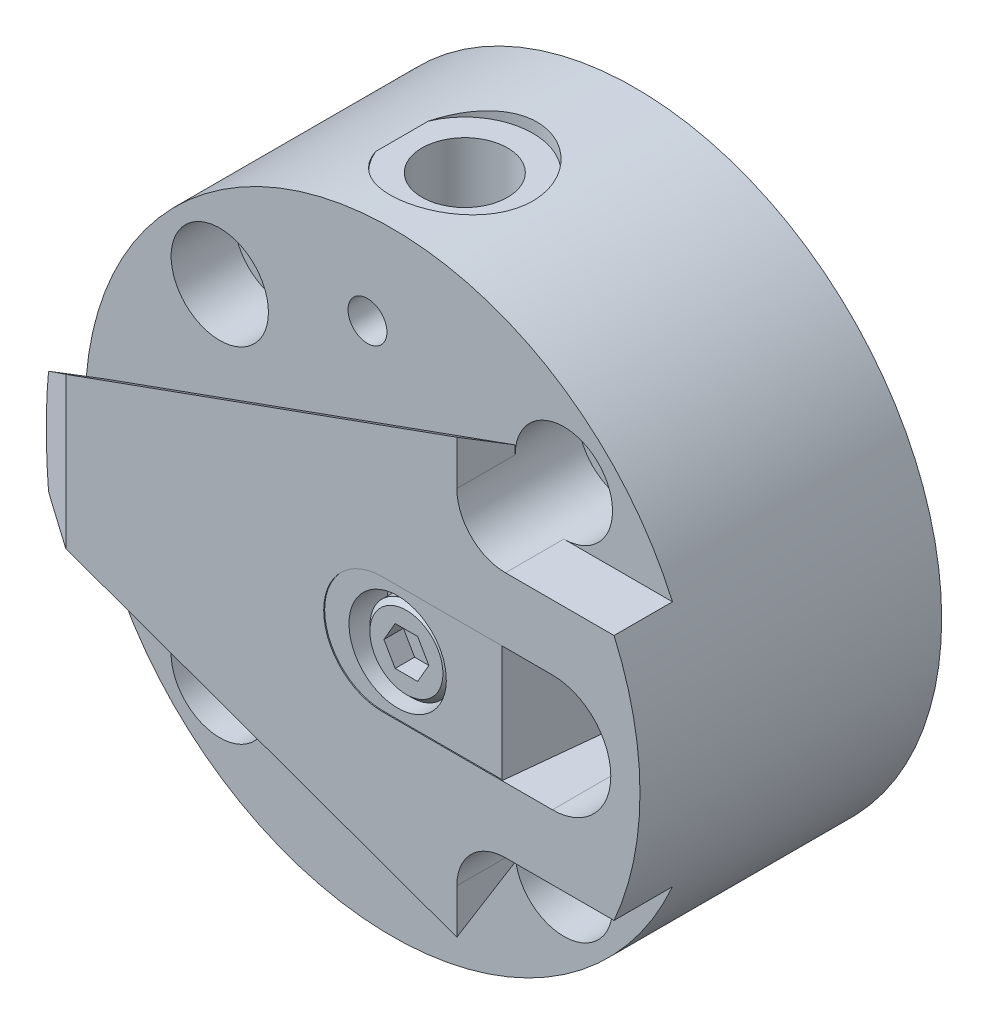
ISO-10303-21;
HEADER;
FILE_DESCRIPTION(('STEP AP214'),'2;1');
FILE_NAME('part.step','',(''),(''),'','','');
FILE_SCHEMA(('AUTOMOTIVE_DESIGN { 1 0 10303 214 1 1 1 1 }'));
ENDSEC;
DATA;
#1=APPLICATION_CONTEXT('core data for automotive mechanical design processes');
#2=APPLICATION_PROTOCOL_DEFINITION('international standard','automotive_design',2000,#1);
#3=PRODUCT_CONTEXT('',#1,'mechanical');
#4=PRODUCT('Part','Part','',(#3));
#5=PRODUCT_RELATED_PRODUCT_CATEGORY('part','',(#4));
#6=PRODUCT_DEFINITION_FORMATION('','',#4);
#7=PRODUCT_DEFINITION_CONTEXT('part definition',#1,'design');
#8=PRODUCT_DEFINITION('design','',#6,#7);
#9=PRODUCT_DEFINITION_SHAPE('','',#8);
#10=(LENGTH_UNIT() NAMED_UNIT(*) SI_UNIT(.MILLI.,.METRE.));
#11=(NAMED_UNIT(*) PLANE_ANGLE_UNIT() SI_UNIT($,.RADIAN.));
#12=(NAMED_UNIT(*) SI_UNIT($,.STERADIAN.) SOLID_ANGLE_UNIT());
#13=UNCERTAINTY_MEASURE_WITH_UNIT(LENGTH_MEASURE(1.E-05),#10,'distance_accuracy_value','');
#14=(GEOMETRIC_REPRESENTATION_CONTEXT(3) GLOBAL_UNCERTAINTY_ASSIGNED_CONTEXT((#13)) GLOBAL_UNIT_ASSIGNED_CONTEXT((#10,
#11,#12)) REPRESENTATION_CONTEXT('',''));
#15=CARTESIAN_POINT('',(0.,0.,0.));
#16=DIRECTION('',(0.,0.,1.));
#17=DIRECTION('',(1.,0.,0.));
#18=AXIS2_PLACEMENT_3D('',#15,#16,#17);
#19=CARTESIAN_POINT('',(13.7499999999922,2.01157317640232E-13,21.));
#20=DIRECTION('',(0.,0.,-1.));
#21=DIRECTION('',(-1.,0.,0.));
#22=AXIS2_PLACEMENT_3D('',#19,#20,#21);
#23=PLANE('',#22);
#24=CARTESIAN_POINT('',(22.4999999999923,2.37320222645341E-13,21.));
#25=DIRECTION('',(0.,0.,1.));
#26=DIRECTION('',(1.,0.,0.));
#27=AXIS2_PLACEMENT_3D('',#24,#25,#26);
#28=CIRCLE('',#27,5.175);
#29=CARTESIAN_POINT('',(18.3678648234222,-3.115458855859,21.));
#30=VERTEX_POINT('',#29);
#31=CARTESIAN_POINT('',(18.3678648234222,3.11545885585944,21.));
#32=VERTEX_POINT('',#31);
#33=EDGE_CURVE('E241',#30,#32,#28,.T.);
#34=ORIENTED_EDGE('',*,*,#33,.F.);
#35=DIRECTION('',(0.,1.,0.));
#36=VECTOR('',#35,1.);
#37=CARTESIAN_POINT('',(18.3678648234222,-10.2257287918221,21.));
#38=LINE('',#37,#36);
#39=CARTESIAN_POINT('',(18.3678648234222,-5.99999999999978,21.));
#40=VERTEX_POINT('',#39);
#41=EDGE_CURVE('E256',#40,#30,#38,.T.);
#42=ORIENTED_EDGE('',*,*,#41,.F.);
#43=DIRECTION('',(1.,0.,0.));
#44=VECTOR('',#43,1.);
#45=CARTESIAN_POINT('',(22.4999999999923,-5.99999999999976,21.));
#46=LINE('',#45,#44);
#47=CARTESIAN_POINT('',(22.4999999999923,-5.99999999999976,21.));
#48=VERTEX_POINT('',#47);
#49=EDGE_CURVE('E926',#40,#48,#46,.T.);
#50=ORIENTED_EDGE('',*,*,#49,.T.);
#51=CARTESIAN_POINT('',(22.4999999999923,2.37320222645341E-13,21.));
#52=DIRECTION('',(0.,0.,-1.));
#53=DIRECTION('',(-1.,0.,0.));
#54=AXIS2_PLACEMENT_3D('',#51,#52,#53);
#55=CIRCLE('',#54,6.);
#56=CARTESIAN_POINT('',(22.4999999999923,6.00000000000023,21.));
#57=VERTEX_POINT('',#56);
#58=EDGE_CURVE('E929',#48,#57,#55,.F.);
#59=ORIENTED_EDGE('',*,*,#58,.T.);
#60=DIRECTION('',(-1.,0.,0.));
#61=VECTOR('',#60,1.);
#62=CARTESIAN_POINT('',(4.99999999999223,6.00000000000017,21.));
#63=LINE('',#62,#61);
#64=CARTESIAN_POINT('',(18.3678648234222,6.00000000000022,21.));
#65=VERTEX_POINT('',#64);
#66=EDGE_CURVE('E253',#57,#65,#63,.T.);
#67=ORIENTED_EDGE('',*,*,#66,.T.);
#68=EDGE_CURVE('E251',#32,#65,#38,.T.);
#69=ORIENTED_EDGE('',*,*,#68,.F.);
#70=EDGE_LOOP('',(#34,#42,#50,#59,#67,#69));
#71=FACE_BOUND('',#70,.T.);
#72=ADVANCED_FACE('F16',(#71),#23,.F.);
#73=CARTESIAN_POINT('',(22.4999999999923,-5.99999999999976,31.));
#74=DIRECTION('',(0.,-1.,0.));
#75=DIRECTION('',(1.,0.,0.));
#76=AXIS2_PLACEMENT_3D('',#73,#74,#75);
#77=PLANE('',#76);
#78=ORIENTED_EDGE('',*,*,#49,.F.);
#79=DIRECTION('',(-0.104528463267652,0.,0.994521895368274));
#80=VECTOR('',#79,1.);
#81=CARTESIAN_POINT('',(17.9999999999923,-5.99999999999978,24.5));
#82=LINE('',#81,#80);
#83=CARTESIAN_POINT('',(17.3168224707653,-5.99999999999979,31.));
#84=VERTEX_POINT('',#83);
#85=EDGE_CURVE('E40',#40,#84,#82,.T.);
#86=ORIENTED_EDGE('',*,*,#85,.T.);
#87=DIRECTION('',(1.,0.,0.));
#88=VECTOR('',#87,1.);
#89=CARTESIAN_POINT('',(0.,-5.99999999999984,31.));
#90=LINE('',#89,#88);
#91=CARTESIAN_POINT('',(22.4999999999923,-5.99999999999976,31.));
#92=VERTEX_POINT('',#91);
#93=EDGE_CURVE('E819',#92,#84,#90,.F.);
#94=ORIENTED_EDGE('',*,*,#93,.F.);
#95=DIRECTION('',(0.,0.,-1.));
#96=VECTOR('',#95,1.);
#97=CARTESIAN_POINT('',(22.4999999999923,-5.99999999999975,31.));
#98=LINE('',#97,#96);
#99=EDGE_CURVE('E809',#92,#48,#98,.T.);
#100=ORIENTED_EDGE('',*,*,#99,.T.);
#101=EDGE_LOOP('',(#78,#86,#94,#100));
#102=FACE_BOUND('',#101,.T.);
#103=ADVANCED_FACE('F547',(#102),#77,.F.);
#104=CARTESIAN_POINT('',(4.99999999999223,6.00000000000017,31.));
#105=DIRECTION('',(0.,1.,0.));
#106=DIRECTION('',(-1.,0.,0.));
#107=AXIS2_PLACEMENT_3D('',#104,#105,#106);
#108=PLANE('',#107);
#109=DIRECTION('',(0.104528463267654,0.,-0.994521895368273));
#110=VECTOR('',#109,1.);
#111=CARTESIAN_POINT('',(17.3168224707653,6.00000000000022,31.));
#112=LINE('',#111,#110);
#113=CARTESIAN_POINT('',(17.3168224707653,6.00000000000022,31.));
#114=VERTEX_POINT('',#113);
#115=EDGE_CURVE('E331',#114,#65,#112,.T.);
#116=ORIENTED_EDGE('',*,*,#115,.T.);
#117=ORIENTED_EDGE('',*,*,#66,.F.);
#118=DIRECTION('',(0.,0.,-1.));
#119=VECTOR('',#118,1.);
#120=CARTESIAN_POINT('',(22.4999999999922,6.00000000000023,31.));
#121=LINE('',#120,#119);
#122=CARTESIAN_POINT('',(22.4999999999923,6.00000000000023,31.));
#123=VERTEX_POINT('',#122);
#124=EDGE_CURVE('E834',#57,#123,#121,.F.);
#125=ORIENTED_EDGE('',*,*,#124,.T.);
#126=DIRECTION('',(1.,0.,0.));
#127=VECTOR('',#126,1.);
#128=CARTESIAN_POINT('',(0.,6.00000000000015,31.));
#129=LINE('',#128,#127);
#130=EDGE_CURVE('E830',#114,#123,#129,.T.);
#131=ORIENTED_EDGE('',*,*,#130,.F.);
#132=EDGE_LOOP('',(#116,#117,#125,#131));
#133=FACE_BOUND('',#132,.T.);
#134=ADVANCED_FACE('F553',(#133),#108,.F.);
#135=CARTESIAN_POINT('',(8.15470053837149,2.00000000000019,30.5));
#136=DIRECTION('',(0.,1.,0.));
#137=DIRECTION('',(1.,0.,0.));
#138=AXIS2_PLACEMENT_3D('',#135,#136,#137);
#139=PLANE('',#138);
#140=DIRECTION('',(0.,0.,-1.));
#141=VECTOR('',#140,1.);
#142=CARTESIAN_POINT('',(5.84529946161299,2.00000000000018,30.5));
#143=LINE('',#142,#141);
#144=CARTESIAN_POINT('',(5.84529946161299,2.00000000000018,30.5));
#145=VERTEX_POINT('',#144);
#146=CARTESIAN_POINT('',(5.84529946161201,2.00000000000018,28.4999999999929));
#147=VERTEX_POINT('',#146);
#148=EDGE_CURVE('E279',#145,#147,#143,.T.);
#149=ORIENTED_EDGE('',*,*,#148,.T.);
#150=DIRECTION('',(-1.,-3.72149681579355E-13,-1.22812483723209E-13));
#151=VECTOR('',#150,1.);
#152=CARTESIAN_POINT('',(8.15470053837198,2.00000000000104,28.4999999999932));
#153=LINE('',#152,#151);
#154=CARTESIAN_POINT('',(8.15470053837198,2.00000000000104,28.4999999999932));
#155=VERTEX_POINT('',#154);
#156=EDGE_CURVE('E260',#155,#147,#153,.T.);
#157=ORIENTED_EDGE('',*,*,#156,.F.);
#158=DIRECTION('',(0.,0.,-1.));
#159=VECTOR('',#158,1.);
#160=CARTESIAN_POINT('',(8.15470053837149,2.00000000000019,30.5));
#161=LINE('',#160,#159);
#162=CARTESIAN_POINT('',(8.15470053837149,2.00000000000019,30.5));
#163=VERTEX_POINT('',#162);
#164=EDGE_CURVE('E262',#155,#163,#161,.F.);
#165=ORIENTED_EDGE('',*,*,#164,.T.);
#166=DIRECTION('',(1.,0.,0.));
#167=VECTOR('',#166,1.);
#168=CARTESIAN_POINT('',(6.99999999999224,2.00000000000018,30.5));
#169=LINE('',#168,#167);
#170=EDGE_CURVE('E282',#145,#163,#169,.T.);
#171=ORIENTED_EDGE('',*,*,#170,.F.);
#172=EDGE_LOOP('',(#149,#157,#165,#171));
#173=FACE_BOUND('',#172,.T.);
#174=ADVANCED_FACE('F1018',(#173),#139,.F.);
#175=CARTESIAN_POINT('',(9.30940107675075,1.85247900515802E-13,30.5));
#176=DIRECTION('',(0.866025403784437,0.5,0.));
#177=DIRECTION('',(0.5,-0.866025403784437,0.));
#178=AXIS2_PLACEMENT_3D('',#175,#176,#177);
#179=PLANE('',#178);
#180=ORIENTED_EDGE('',*,*,#164,.F.);
#181=DIRECTION('',(-0.5,0.866025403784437,0.));
#182=VECTOR('',#181,1.);
#183=CARTESIAN_POINT('',(9.30940107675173,1.84723357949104E-13,28.4999999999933));
#184=LINE('',#183,#182);
#185=CARTESIAN_POINT('',(9.30940107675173,1.84723357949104E-13,28.4999999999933));
#186=VERTEX_POINT('',#185);
#187=EDGE_CURVE('E263',#186,#155,#184,.T.);
#188=ORIENTED_EDGE('',*,*,#187,.F.);
#189=DIRECTION('',(0.,0.,-1.));
#190=VECTOR('',#189,1.);
#191=CARTESIAN_POINT('',(9.30940107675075,1.85243837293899E-13,30.5));
#192=LINE('',#191,#190);
#193=CARTESIAN_POINT('',(9.30940107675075,1.85553706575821E-13,30.5));
#194=VERTEX_POINT('',#193);
#195=EDGE_CURVE('E289',#186,#194,#192,.F.);
#196=ORIENTED_EDGE('',*,*,#195,.T.);
#197=DIRECTION('',(0.5,-0.866025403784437,0.));
#198=VECTOR('',#197,1.);
#199=CARTESIAN_POINT('',(8.15470053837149,2.00000000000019,30.5));
#200=LINE('',#199,#198);
#201=EDGE_CURVE('E294',#163,#194,#200,.T.);
#202=ORIENTED_EDGE('',*,*,#201,.F.);
#203=EDGE_LOOP('',(#180,#188,#196,#202));
#204=FACE_BOUND('',#203,.T.);
#205=ADVANCED_FACE('F1044',(#204),#179,.F.);
#206=CARTESIAN_POINT('',(8.15470053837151,-1.99999999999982,30.5));
#207=DIRECTION('',(0.866025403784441,-0.5,0.));
#208=DIRECTION('',(-0.5,-0.866025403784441,0.));
#209=AXIS2_PLACEMENT_3D('',#206,#207,#208);
#210=PLANE('',#209);
#211=ORIENTED_EDGE('',*,*,#195,.F.);
#212=DIRECTION('',(0.5,0.866025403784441,0.));
#213=VECTOR('',#212,1.);
#214=CARTESIAN_POINT('',(8.154700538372,-2.00000000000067,28.4999999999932));
#215=LINE('',#214,#213);
#216=CARTESIAN_POINT('',(8.154700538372,-2.00000000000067,28.4999999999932));
#217=VERTEX_POINT('',#216);
#218=EDGE_CURVE('E265',#217,#186,#215,.T.);
#219=ORIENTED_EDGE('',*,*,#218,.F.);
#220=DIRECTION('',(0.,0.,-1.));
#221=VECTOR('',#220,1.);
#222=CARTESIAN_POINT('',(8.15470053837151,-1.99999999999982,30.5));
#223=LINE('',#222,#221);
#224=CARTESIAN_POINT('',(8.15470053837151,-1.99999999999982,30.5));
#225=VERTEX_POINT('',#224);
#226=EDGE_CURVE('E287',#217,#225,#223,.F.);
#227=ORIENTED_EDGE('',*,*,#226,.T.);
#228=DIRECTION('',(-0.5,-0.866025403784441,0.));
#229=VECTOR('',#228,1.);
#230=CARTESIAN_POINT('',(9.30940107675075,1.85677518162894E-13,30.5));
#231=LINE('',#230,#229);
#232=EDGE_CURVE('E304',#194,#225,#231,.T.);
#233=ORIENTED_EDGE('',*,*,#232,.F.);
#234=EDGE_LOOP('',(#211,#219,#227,#233));
#235=FACE_BOUND('',#234,.T.);
#236=ADVANCED_FACE('F1040',(#235),#210,.F.);
#237=CARTESIAN_POINT('',(5.84529946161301,-1.99999999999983,30.5));
#238=DIRECTION('',(0.,-1.,0.));
#239=DIRECTION('',(-1.,0.,0.));
#240=AXIS2_PLACEMENT_3D('',#237,#238,#239);
#241=PLANE('',#240);
#242=ORIENTED_EDGE('',*,*,#226,.F.);
#243=DIRECTION('',(1.,0.,1.22812483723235E-13));
#244=VECTOR('',#243,1.);
#245=CARTESIAN_POINT('',(5.84529946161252,-2.00000000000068,28.4999999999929));
#246=LINE('',#245,#244);
#247=CARTESIAN_POINT('',(5.84529946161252,-2.00000000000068,28.4999999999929));
#248=VERTEX_POINT('',#247);
#249=EDGE_CURVE('E267',#248,#217,#246,.T.);
#250=ORIENTED_EDGE('',*,*,#249,.F.);
#251=DIRECTION('',(0.,0.,-1.));
#252=VECTOR('',#251,1.);
#253=CARTESIAN_POINT('',(5.84529946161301,-1.99999999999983,30.5));
#254=LINE('',#253,#252);
#255=CARTESIAN_POINT('',(5.84529946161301,-1.99999999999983,30.5));
#256=VERTEX_POINT('',#255);
#257=EDGE_CURVE('E285',#248,#256,#254,.F.);
#258=ORIENTED_EDGE('',*,*,#257,.T.);
#259=DIRECTION('',(1.,0.,0.));
#260=VECTOR('',#259,1.);
#261=CARTESIAN_POINT('',(6.99999999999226,-1.99999999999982,30.5));
#262=LINE('',#261,#260);
#263=EDGE_CURVE('E301',#225,#256,#262,.F.);
#264=ORIENTED_EDGE('',*,*,#263,.F.);
#265=EDGE_LOOP('',(#242,#250,#258,#264));
#266=FACE_BOUND('',#265,.T.);
#267=ADVANCED_FACE('F1036',(#266),#241,.F.);
#268=CARTESIAN_POINT('',(4.69059892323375,1.69620288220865E-13,30.5));
#269=DIRECTION('',(-0.866025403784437,-0.5,0.));
#270=DIRECTION('',(-0.5,0.866025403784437,0.));
#271=AXIS2_PLACEMENT_3D('',#268,#269,#270);
#272=PLANE('',#271);
#273=ORIENTED_EDGE('',*,*,#257,.F.);
#274=DIRECTION('',(0.5,-0.866025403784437,0.));
#275=VECTOR('',#274,1.);
#276=CARTESIAN_POINT('',(4.69059892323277,1.69840184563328E-13,28.4999999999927));
#277=LINE('',#276,#275);
#278=CARTESIAN_POINT('',(4.69059892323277,1.69840184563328E-13,28.4999999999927));
#279=VERTEX_POINT('',#278);
#280=EDGE_CURVE('E269',#279,#248,#277,.T.);
#281=ORIENTED_EDGE('',*,*,#280,.F.);
#282=DIRECTION('',(0.,0.,-1.));
#283=VECTOR('',#282,1.);
#284=CARTESIAN_POINT('',(4.69059892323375,1.69856539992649E-13,30.5));
#285=LINE('',#284,#283);
#286=CARTESIAN_POINT('',(4.69059892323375,1.69588626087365E-13,30.5));
#287=VERTEX_POINT('',#286);
#288=EDGE_CURVE('E283',#279,#287,#285,.F.);
#289=ORIENTED_EDGE('',*,*,#288,.T.);
#290=DIRECTION('',(-0.5,0.866025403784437,0.));
#291=VECTOR('',#290,1.);
#292=CARTESIAN_POINT('',(5.84529946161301,-1.99999999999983,30.5));
#293=LINE('',#292,#291);
#294=EDGE_CURVE('E298',#256,#287,#293,.T.);
#295=ORIENTED_EDGE('',*,*,#294,.F.);
#296=EDGE_LOOP('',(#273,#281,#289,#295));
#297=FACE_BOUND('',#296,.T.);
#298=ADVANCED_FACE('F1032',(#297),#272,.F.);
#299=CARTESIAN_POINT('',(5.84529946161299,2.00000000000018,30.5));
#300=DIRECTION('',(-0.866025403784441,0.5,0.));
#301=DIRECTION('',(0.5,0.866025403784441,0.));
#302=AXIS2_PLACEMENT_3D('',#299,#300,#301);
#303=PLANE('',#302);
#304=ORIENTED_EDGE('',*,*,#288,.F.);
#305=DIRECTION('',(-0.5,-0.866025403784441,0.));
#306=VECTOR('',#305,1.);
#307=CARTESIAN_POINT('',(5.84529946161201,2.00000000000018,28.4999999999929));
#308=LINE('',#307,#306);
#309=EDGE_CURVE('E271',#147,#279,#308,.T.);
#310=ORIENTED_EDGE('',*,*,#309,.F.);
#311=ORIENTED_EDGE('',*,*,#148,.F.);
#312=DIRECTION('',(0.5,0.866025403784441,0.));
#313=VECTOR('',#312,1.);
#314=CARTESIAN_POINT('',(4.69059892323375,1.69422859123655E-13,30.5));
#315=LINE('',#314,#313);
#316=EDGE_CURVE('E295',#287,#145,#315,.T.);
#317=ORIENTED_EDGE('',*,*,#316,.F.);
#318=EDGE_LOOP('',(#304,#310,#311,#317));
#319=FACE_BOUND('',#318,.T.);
#320=ADVANCED_FACE('F1028',(#319),#303,.F.);
#321=CARTESIAN_POINT('',(6.99999999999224,3.27970053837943,30.5));
#322=DIRECTION('',(0.,0.,1.));
#323=DIRECTION('',(0.,-1.,0.));
#324=AXIS2_PLACEMENT_3D('',#321,#322,#323);
#325=PLANE('',#324);
#326=ORIENTED_EDGE('',*,*,#294,.T.);
#327=ORIENTED_EDGE('',*,*,#316,.T.);
#328=ORIENTED_EDGE('',*,*,#170,.T.);
#329=ORIENTED_EDGE('',*,*,#201,.T.);
#330=ORIENTED_EDGE('',*,*,#232,.T.);
#331=ORIENTED_EDGE('',*,*,#263,.T.);
#332=EDGE_LOOP('',(#326,#327,#328,#329,#330,#331));
#333=FACE_BOUND('',#332,.T.);
#334=CARTESIAN_POINT('',(6.99999999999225,1.77116507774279E-13,30.4999999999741));
#335=DIRECTION('',(0.,0.,-1.));
#336=DIRECTION('',(-1.,0.,0.));
#337=AXIS2_PLACEMENT_3D('',#334,#335,#336);
#338=CIRCLE('',#337,3.74999999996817);
#339=CARTESIAN_POINT('',(3.25000000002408,1.63919369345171E-13,30.4999999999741));
#340=VERTEX_POINT('',#339);
#341=EDGE_CURVE('E276',#340,#340,#338,.T.);
#342=ORIENTED_EDGE('',*,*,#341,.F.);
#343=EDGE_LOOP('',(#342));
#344=FACE_BOUND('',#343,.T.);
#345=ADVANCED_FACE('F1019',(#333,#344),#325,.T.);
#346=CARTESIAN_POINT('',(6.99999999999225,1.7708911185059E-13,29.9999999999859));
#347=DIRECTION('',(0.,0.,-1.));
#348=DIRECTION('',(-1.,0.,0.));
#349=AXIS2_PLACEMENT_3D('',#346,#347,#348);
#350=CONICAL_SURFACE('',#349,4.25000000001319,0.785398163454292);
#351=ORIENTED_EDGE('',*,*,#341,.T.);
#352=EDGE_LOOP('',(#351));
#353=FACE_BOUND('',#352,.T.);
#354=CARTESIAN_POINT('',(6.99999999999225,1.77104203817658E-13,30.));
#355=DIRECTION('',(0.,0.,-1.));
#356=DIRECTION('',(0.,1.,0.));
#357=AXIS2_PLACEMENT_3D('',#354,#355,#356);
#358=CIRCLE('',#357,4.25);
#359=CARTESIAN_POINT('',(6.99999999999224,4.25000000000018,30.));
#360=VERTEX_POINT('',#359);
#361=EDGE_CURVE('E25',#360,#360,#358,.T.);
#362=ORIENTED_EDGE('',*,*,#361,.F.);
#363=EDGE_LOOP('',(#362));
#364=FACE_BOUND('',#363,.T.);
#365=ADVANCED_FACE('F1007',(#353,#364),#350,.T.);
#366=CARTESIAN_POINT('',(6.99999999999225,1.77034262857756E-13,28.75));
#367=DIRECTION('',(0.,0.,-1.));
#368=DIRECTION('',(0.,1.,0.));
#369=AXIS2_PLACEMENT_3D('',#366,#367,#368);
#370=CYLINDRICAL_SURFACE('',#369,4.25);
#371=CARTESIAN_POINT('',(6.99999999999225,1.76936345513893E-13,27.));
#372=DIRECTION('',(0.,0.,-1.));
#373=DIRECTION('',(0.,1.,0.));
#374=AXIS2_PLACEMENT_3D('',#371,#372,#373);
#375=CIRCLE('',#374,4.25);
#376=CARTESIAN_POINT('',(6.99999999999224,4.25000000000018,27.));
#377=VERTEX_POINT('',#376);
#378=EDGE_CURVE('E10',#377,#377,#375,.T.);
#379=ORIENTED_EDGE('',*,*,#378,.F.);
#380=EDGE_LOOP('',(#379));
#381=FACE_BOUND('',#380,.T.);
#382=ORIENTED_EDGE('',*,*,#361,.T.);
#383=EDGE_LOOP('',(#382));
#384=FACE_BOUND('',#383,.T.);
#385=ADVANCED_FACE('F1002',(#381,#384),#370,.T.);
#386=CARTESIAN_POINT('',(6.99999999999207,1.770069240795E-13,28.499999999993));
#387=DIRECTION('',(-1.22812483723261E-13,0.,1.));
#388=DIRECTION('',(1.,0.,1.22812483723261E-13));
#389=AXIS2_PLACEMENT_3D('',#386,#387,#388);
#390=PLANE('',#389);
#391=ORIENTED_EDGE('',*,*,#309,.T.);
#392=ORIENTED_EDGE('',*,*,#280,.T.);
#393=ORIENTED_EDGE('',*,*,#249,.T.);
#394=ORIENTED_EDGE('',*,*,#218,.T.);
#395=ORIENTED_EDGE('',*,*,#187,.T.);
#396=ORIENTED_EDGE('',*,*,#156,.T.);
#397=EDGE_LOOP('',(#391,#392,#393,#394,#395,#396));
#398=FACE_BOUND('',#397,.T.);
#399=ADVANCED_FACE('F613',(#398),#390,.T.);
#400=CARTESIAN_POINT('',(-2.50000000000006,16.5000000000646,15.));
#401=DIRECTION('',(0.,1.,0.));
#402=DIRECTION('',(-1.,0.,0.));
#403=AXIS2_PLACEMENT_3D('',#400,#401,#402);
#404=CONICAL_SURFACE('',#403,4.39999999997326,1.02974425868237);
#405=CARTESIAN_POINT('',(-2.50000000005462,13.8562132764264,15.));
#406=VERTEX_POINT('',#405);
#407=VERTEX_LOOP('',#406);
#408=FACE_BOUND('',#407,.T.);
#409=CARTESIAN_POINT('',(-2.50000000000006,16.5000000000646,15.));
#410=DIRECTION('',(0.,1.,0.));
#411=DIRECTION('',(-1.,0.,0.));
#412=AXIS2_PLACEMENT_3D('',#409,#410,#411);
#413=CIRCLE('',#412,4.4);
#414=CARTESIAN_POINT('',(-6.90000000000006,16.5000000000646,15.));
#415=VERTEX_POINT('',#414);
#416=EDGE_CURVE('E900',#415,#415,#413,.T.);
#417=ORIENTED_EDGE('',*,*,#416,.T.);
#418=EDGE_LOOP('',(#417));
#419=FACE_BOUND('',#418,.T.);
#420=ADVANCED_FACE('F1015',(#408,#419),#404,.F.);
#421=CARTESIAN_POINT('',(-2.49999999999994,-16.5000000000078,15.));
#422=DIRECTION('',(0.,-1.,0.));
#423=DIRECTION('',(1.,0.,0.));
#424=AXIS2_PLACEMENT_3D('',#421,#422,#423);
#425=CONICAL_SURFACE('',#424,4.40000000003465,1.02974425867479);
#426=CARTESIAN_POINT('',(-2.49999999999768,-13.8562132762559,15.));
#427=VERTEX_POINT('',#426);
#428=VERTEX_LOOP('',#427);
#429=FACE_BOUND('',#428,.T.);
#430=CARTESIAN_POINT('',(-2.49999999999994,-16.5,15.));
#431=DIRECTION('',(0.,-1.,0.));
#432=DIRECTION('',(1.,0.,0.));
#433=AXIS2_PLACEMENT_3D('',#430,#431,#432);
#434=CIRCLE('',#433,4.4);
#435=CARTESIAN_POINT('',(1.90000000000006,-16.5,15.));
#436=VERTEX_POINT('',#435);
#437=EDGE_CURVE('E904',#436,#436,#434,.T.);
#438=ORIENTED_EDGE('',*,*,#437,.T.);
#439=EDGE_LOOP('',(#438));
#440=FACE_BOUND('',#439,.T.);
#441=ADVANCED_FACE('F562',(#429,#440),#425,.F.);
#442=CARTESIAN_POINT('',(0.,0.,-5.5));
#443=DIRECTION('',(0.,0.,-1.));
#444=DIRECTION('',(-1.,0.,0.));
#445=AXIS2_PLACEMENT_3D('',#442,#443,#444);
#446=PLANE('',#445);
#447=CARTESIAN_POINT('',(0.,0.,-5.5));
#448=DIRECTION('',(0.,0.,1.));
#449=DIRECTION('',(1.,0.,0.));
#450=AXIS2_PLACEMENT_3D('',#447,#448,#449);
#451=CIRCLE('',#450,15.75);
#452=CARTESIAN_POINT('',(15.75,0.,-5.5));
#453=VERTEX_POINT('',#452);
#454=EDGE_CURVE('E931',#453,#453,#451,.T.);
#455=ORIENTED_EDGE('',*,*,#454,.F.);
#456=EDGE_LOOP('',(#455));
#457=FACE_BOUND('',#456,.T.);
#458=ADVANCED_FACE('F559',(#457),#446,.T.);
#459=CARTESIAN_POINT('',(-25.,0.,10.));
#460=DIRECTION('',(0.,0.,1.));
#461=DIRECTION('',(1.,0.,0.));
#462=AXIS2_PLACEMENT_3D('',#459,#460,#461);
#463=PLANE('',#462);
#464=CARTESIAN_POINT('',(-25.,0.,10.));
#465=DIRECTION('',(0.,0.,-1.));
#466=DIRECTION('',(-1.,0.,0.));
#467=AXIS2_PLACEMENT_3D('',#464,#465,#466);
#468=CIRCLE('',#467,3.);
#469=CARTESIAN_POINT('',(-28.,0.,10.));
#470=VERTEX_POINT('',#469);
#471=EDGE_CURVE('E934',#470,#470,#468,.T.);
#472=ORIENTED_EDGE('',*,*,#471,.T.);
#473=EDGE_LOOP('',(#472));
#474=FACE_BOUND('',#473,.T.);
#475=ADVANCED_FACE('F529',(#474),#463,.F.);
#476=CARTESIAN_POINT('',(-17.6776695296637,17.6776695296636,18.5));
#477=DIRECTION('',(0.,0.,1.));
#478=DIRECTION('',(1.,0.,0.));
#479=AXIS2_PLACEMENT_3D('',#476,#477,#478);
#480=PLANE('',#479);
#481=CARTESIAN_POINT('',(-17.6776695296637,17.6776695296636,18.5));
#482=DIRECTION('',(0.,0.,1.));
#483=DIRECTION('',(1.,0.,0.));
#484=AXIS2_PLACEMENT_3D('',#481,#482,#483);
#485=CIRCLE('',#484,3.2);
#486=CARTESIAN_POINT('',(-14.4776695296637,17.6776695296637,18.5));
#487=VERTEX_POINT('',#486);
#488=EDGE_CURVE('E804',#487,#487,#485,.F.);
#489=ORIENTED_EDGE('',*,*,#488,.T.);
#490=EDGE_LOOP('',(#489));
#491=FACE_BOUND('',#490,.T.);
#492=CARTESIAN_POINT('',(-17.6776695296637,17.6776695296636,18.5));
#493=DIRECTION('',(0.,0.,1.));
#494=DIRECTION('',(1.,0.,0.));
#495=AXIS2_PLACEMENT_3D('',#492,#493,#494);
#496=CIRCLE('',#495,5.);
#497=CARTESIAN_POINT('',(-12.6776695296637,17.6776695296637,18.5));
#498=VERTEX_POINT('',#497);
#499=EDGE_CURVE('E805',#498,#498,#496,.T.);
#500=ORIENTED_EDGE('',*,*,#499,.T.);
#501=EDGE_LOOP('',(#500));
#502=FACE_BOUND('',#501,.T.);
#503=ADVANCED_FACE('F564',(#491,#502),#480,.T.);
#504=CARTESIAN_POINT('',(-17.6776695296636,-17.6776695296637,18.5));
#505=DIRECTION('',(0.,0.,1.));
#506=DIRECTION('',(1.,0.,0.));
#507=AXIS2_PLACEMENT_3D('',#504,#505,#506);
#508=PLANE('',#507);
#509=CARTESIAN_POINT('',(-17.6776695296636,-17.6776695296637,18.5));
#510=DIRECTION('',(0.,0.,1.));
#511=DIRECTION('',(1.,0.,0.));
#512=AXIS2_PLACEMENT_3D('',#509,#510,#511);
#513=CIRCLE('',#512,3.2);
#514=CARTESIAN_POINT('',(-14.4776695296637,-17.6776695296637,18.5));
#515=VERTEX_POINT('',#514);
#516=EDGE_CURVE('E812',#515,#515,#513,.F.);
#517=ORIENTED_EDGE('',*,*,#516,.T.);
#518=EDGE_LOOP('',(#517));
#519=FACE_BOUND('',#518,.T.);
#520=CARTESIAN_POINT('',(-17.6776695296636,-17.6776695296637,18.5));
#521=DIRECTION('',(0.,0.,1.));
#522=DIRECTION('',(1.,0.,0.));
#523=AXIS2_PLACEMENT_3D('',#520,#521,#522);
#524=CIRCLE('',#523,5.);
#525=CARTESIAN_POINT('',(-12.6776695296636,-17.6776695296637,18.5));
#526=VERTEX_POINT('',#525);
#527=EDGE_CURVE('E806',#526,#526,#524,.T.);
#528=ORIENTED_EDGE('',*,*,#527,.T.);
#529=EDGE_LOOP('',(#528));
#530=FACE_BOUND('',#529,.T.);
#531=ADVANCED_FACE('F568',(#519,#530),#508,.T.);
#532=CARTESIAN_POINT('',(4.99999999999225,1.68708572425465E-13,21.));
#533=DIRECTION('',(0.,0.,1.));
#534=DIRECTION('',(0.,1.,0.));
#535=AXIS2_PLACEMENT_3D('',#532,#533,#534);
#536=CYLINDRICAL_SURFACE('',#535,6.);
#537=CARTESIAN_POINT('',(-0.656854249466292,2.00000000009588,27.));
#538=CARTESIAN_POINT('',(-0.65685389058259,2.00000051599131,26.8910636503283));
#539=CARTESIAN_POINT('',(-0.660035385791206,1.99106956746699,26.7821304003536));
#540=CARTESIAN_POINT('',(-0.672351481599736,1.95570226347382,26.5674911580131));
#541=CARTESIAN_POINT('',(-0.681487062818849,1.9292630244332,26.461785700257));
#542=CARTESIAN_POINT('',(-0.704564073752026,1.85991097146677,26.2567462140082));
#543=CARTESIAN_POINT('',(-0.718496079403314,1.81703044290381,26.1574001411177));
#544=CARTESIAN_POINT('',(-0.749582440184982,1.71612325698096,25.967279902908));
#545=CARTESIAN_POINT('',(-0.766737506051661,1.65809325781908,25.876507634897));
#546=CARTESIAN_POINT('',(-0.803089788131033,1.52610229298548,25.7025600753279));
#547=CARTESIAN_POINT('',(-0.822337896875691,1.45164868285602,25.6197691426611));
#548=CARTESIAN_POINT('',(-0.860277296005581,1.28997533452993,25.4675863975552));
#549=CARTESIAN_POINT('',(-0.878968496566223,1.20275355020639,25.3981967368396));
#550=CARTESIAN_POINT('',(-0.914277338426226,1.0152090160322,25.2730422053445));
#551=CARTESIAN_POINT('',(-0.930828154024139,0.914603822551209,25.2176800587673));
#552=CARTESIAN_POINT('',(-0.959391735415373,0.704862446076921,25.1248168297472));
#553=CARTESIAN_POINT('',(-0.97140572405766,0.59572857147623,25.087310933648));
#554=CARTESIAN_POINT('',(-0.98918150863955,0.376057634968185,25.0325282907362));
#555=CARTESIAN_POINT('',(-0.995146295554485,0.265701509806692,25.0145931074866));
#556=CARTESIAN_POINT('',(-1.000872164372,0.0433957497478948,24.9973674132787));
#557=CARTESIAN_POINT('',(-1.0006348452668,-0.0685534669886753,24.998072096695));
#558=CARTESIAN_POINT('',(-0.994120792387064,-0.286207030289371,25.0176885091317));
#559=CARTESIAN_POINT('',(-0.988081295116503,-0.391984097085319,25.0358850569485));
#560=CARTESIAN_POINT('',(-0.970939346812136,-0.598886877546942,25.0887859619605));
#561=CARTESIAN_POINT('',(-0.959836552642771,-0.700012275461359,25.1234914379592));
#562=CARTESIAN_POINT('',(-0.933513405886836,-0.896304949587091,25.2088426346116));
#563=CARTESIAN_POINT('',(-0.918240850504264,-0.991376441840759,25.2596918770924));
#564=CARTESIAN_POINT('',(-0.885167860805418,-1.17184865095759,25.3757194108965));
#565=CARTESIAN_POINT('',(-0.867366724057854,-1.25724666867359,25.4409016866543));
#566=CARTESIAN_POINT('',(-0.830123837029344,-1.42020173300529,25.587348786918));
#567=CARTESIAN_POINT('',(-0.810644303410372,-1.49720031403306,25.6692263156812));
#568=CARTESIAN_POINT('',(-0.772946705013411,-1.63655451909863,25.8448974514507));
#569=CARTESIAN_POINT('',(-0.754728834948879,-1.69890788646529,25.9386928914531));
#570=CARTESIAN_POINT('',(-0.721410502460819,-1.80797490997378,26.1373072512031));
#571=CARTESIAN_POINT('',(-0.706358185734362,-1.85445292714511,26.2422642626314));
#572=CARTESIAN_POINT('',(-0.681633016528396,-1.92888638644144,26.4591427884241));
#573=CARTESIAN_POINT('',(-0.67195790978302,-1.95684959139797,26.5710613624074));
#574=CARTESIAN_POINT('',(-0.659592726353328,-1.99232256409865,26.793276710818));
#575=CARTESIAN_POINT('',(-0.656607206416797,-2.00069819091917,26.9034188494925));
#576=CARTESIAN_POINT('',(-0.657133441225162,-1.99921087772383,27.123552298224));
#577=CARTESIAN_POINT('',(-0.660644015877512,-1.98935125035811,27.2335436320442));
#578=CARTESIAN_POINT('',(-0.673472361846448,-1.9524513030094,27.4463139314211));
#579=CARTESIAN_POINT('',(-0.682586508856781,-1.92601278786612,27.5492108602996));
#580=CARTESIAN_POINT('',(-0.705371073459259,-1.85742772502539,27.7490872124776));
#581=CARTESIAN_POINT('',(-0.7190422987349,-1.81527839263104,27.8460655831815));
#582=CARTESIAN_POINT('',(-0.749937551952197,-1.71494868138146,28.0347608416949));
#583=CARTESIAN_POINT('',(-0.767260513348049,-1.65630223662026,28.1262132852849));
#584=CARTESIAN_POINT('',(-0.80331537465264,-1.5251712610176,28.2982921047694));
#585=CARTESIAN_POINT('',(-0.822047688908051,-1.45268265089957,28.3789152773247));
#586=CARTESIAN_POINT('',(-0.859900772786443,-1.29178341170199,28.5310559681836));
#587=CARTESIAN_POINT('',(-0.878996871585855,-1.20277454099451,28.6019487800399));
#588=CARTESIAN_POINT('',(-0.914537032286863,-1.0136545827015,28.7278322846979));
#589=CARTESIAN_POINT('',(-0.930981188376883,-0.913543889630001,28.7828235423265));
#590=CARTESIAN_POINT('',(-0.95928811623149,-0.705559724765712,28.8748402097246));
#591=CARTESIAN_POINT('',(-0.971180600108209,-0.597742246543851,28.9119825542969));
#592=CARTESIAN_POINT('',(-0.989172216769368,-0.376916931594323,28.9674554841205));
#593=CARTESIAN_POINT('',(-0.995273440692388,-0.263910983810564,28.9857928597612));
#594=CARTESIAN_POINT('',(-1.00083726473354,-0.0416306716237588,29.0025241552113));
#595=CARTESIAN_POINT('',(-1.00059840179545,0.0675694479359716,29.0018149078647));
#596=CARTESIAN_POINT('',(-0.994243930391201,0.284222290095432,28.9826853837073));
#597=CARTESIAN_POINT('',(-0.988128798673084,0.391675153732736,28.9642665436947));
#598=CARTESIAN_POINT('',(-0.970818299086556,0.600084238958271,28.9108355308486));
#599=CARTESIAN_POINT('',(-0.959705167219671,0.701116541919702,28.8760915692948));
#600=CARTESIAN_POINT('',(-0.933543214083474,0.895956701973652,28.7912449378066));
#601=CARTESIAN_POINT('',(-0.918493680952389,0.989763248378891,28.741139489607));
#602=CARTESIAN_POINT('',(-0.885317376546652,1.17126803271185,28.6248609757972));
#603=CARTESIAN_POINT('',(-0.867097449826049,1.25861250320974,28.5581626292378));
#604=CARTESIAN_POINT('',(-0.829859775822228,1.42116205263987,28.4114852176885));
#605=CARTESIAN_POINT('',(-0.810841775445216,1.49636324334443,28.3315019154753));
#606=CARTESIAN_POINT('',(-0.773265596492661,1.63548361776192,28.1567812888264));
#607=CARTESIAN_POINT('',(-0.754754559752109,1.69884593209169,28.0615889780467));
#608=CARTESIAN_POINT('',(-0.721203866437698,1.80862868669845,27.8613311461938));
#609=CARTESIAN_POINT('',(-0.706163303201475,1.85505355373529,27.7562682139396));
#610=CARTESIAN_POINT('',(-0.68202668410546,1.92768765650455,27.5440763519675));
#611=CARTESIAN_POINT('',(-0.672692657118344,1.95471581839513,27.4372554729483));
#612=CARTESIAN_POINT('',(-0.660107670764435,1.99086864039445,27.2202878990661));
#613=CARTESIAN_POINT('',(-0.656854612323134,1.99999947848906,27.1101423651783));
#614=CARTESIAN_POINT('',(-0.656854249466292,2.00000000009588,27.));
#615=B_SPLINE_CURVE_WITH_KNOTS('',3,(#537,#538,#539,#540,#541,#542,#543,#544,#545,#546,#547,
#548,#549,#550,#551,#552,#553,#554,#555,#556,#557,#558,#559,#560,#561,#562,#563,#564,#565,#566,
#567,#568,#569,#570,#571,#572,#573,#574,#575,#576,#577,#578,#579,#580,#581,#582,#583,#584,#585,
#586,#587,#588,#589,#590,#591,#592,#593,#594,#595,#596,#597,#598,#599,#600,#601,#602,#603,#604,
#605,#606,#607,#608,#609,#610,#611,#612,#613,#614),.UNSPECIFIED.,.T.,.F.,(4,2,2,2,2,2,2,2,2,2,2,
2,2,2,2,2,2,2,2,2,2,2,2,2,2,2,2,2,2,2,2,2,2,2,2,2,2,2,4),(0.,0.326401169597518,0.65285611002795,
0.978673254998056,1.30456233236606,1.6420267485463,1.97954530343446,2.32587012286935,
2.67210152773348,3.00628637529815,3.34038506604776,3.66138009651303,3.98239688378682,
4.30763309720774,4.63295983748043,4.97360348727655,5.31429959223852,5.65985279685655,
6.00526102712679,6.3350858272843,6.66485071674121,6.98328791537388,7.3017815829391,
7.63037715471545,7.95906971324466,8.30357616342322,8.64807037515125,8.99027582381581,
9.3323576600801,9.65836169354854,9.98433928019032,10.3051391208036,10.6259970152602,
10.9587103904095,11.2915300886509,11.6373780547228,11.9831355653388,12.3132642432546,
12.6432789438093),.UNSPECIFIED.);
#616=CARTESIAN_POINT('',(-0.656854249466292,2.00000000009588,27.));
#617=VERTEX_POINT('',#616);
#618=EDGE_CURVE('E273',#617,#617,#615,.T.);
#619=ORIENTED_EDGE('',*,*,#618,.T.);
#620=EDGE_LOOP('',(#619));
#621=FACE_BOUND('',#620,.T.);
#622=ADVANCED_FACE('F348',(#621),#536,.T.);
#623=CARTESIAN_POINT('',(-17.6776695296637,17.6776695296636,21.75));
#624=DIRECTION('',(0.,0.,1.));
#625=DIRECTION('',(1.,0.,0.));
#626=AXIS2_PLACEMENT_3D('',#623,#624,#625);
#627=CYLINDRICAL_SURFACE('',#626,5.);
#628=ORIENTED_EDGE('',*,*,#499,.F.);
#629=EDGE_LOOP('',(#628));
#630=FACE_BOUND('',#629,.T.);
#631=CARTESIAN_POINT('',(-17.6776695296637,17.6776695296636,25.));
#632=DIRECTION('',(0.,0.,1.));
#633=DIRECTION('',(1.,0.,0.));
#634=AXIS2_PLACEMENT_3D('',#631,#632,#633);
#635=CIRCLE('',#634,5.);
#636=CARTESIAN_POINT('',(-12.6776695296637,17.6776695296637,25.));
#637=VERTEX_POINT('',#636);
#638=EDGE_CURVE('E1108',#637,#637,#635,.T.);
#639=ORIENTED_EDGE('',*,*,#638,.T.);
#640=EDGE_LOOP('',(#639));
#641=FACE_BOUND('',#640,.T.);
#642=ADVANCED_FACE('F534',(#630,#641),#627,.F.);
#643=CARTESIAN_POINT('',(-2.50000000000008,22.,-5.501));
#644=DIRECTION('',(0.,0.,1.));
#645=DIRECTION('',(1.,0.,0.));
#646=AXIS2_PLACEMENT_3D('',#643,#644,#645);
#647=CYLINDRICAL_SURFACE('',#646,2.);
#648=CARTESIAN_POINT('',(-2.50000000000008,22.,25.));
#649=DIRECTION('',(0.,0.,1.));
#650=DIRECTION('',(1.,0.,0.));
#651=AXIS2_PLACEMENT_3D('',#648,#649,#650);
#652=CIRCLE('',#651,2.);
#653=CARTESIAN_POINT('',(-0.500000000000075,22.,25.));
#654=VERTEX_POINT('',#653);
#655=EDGE_CURVE('E474',#654,#654,#652,.T.);
#656=ORIENTED_EDGE('',*,*,#655,.T.);
#657=EDGE_LOOP('',(#656));
#658=FACE_BOUND('',#657,.T.);
#659=CARTESIAN_POINT('',(-0.500000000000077,22.,18.9191835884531));
#660=CARTESIAN_POINT('',(-0.500005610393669,21.8943865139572,18.9191898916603));
#661=CARTESIAN_POINT('',(-0.508419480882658,21.7886082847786,18.9235152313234));
#662=CARTESIAN_POINT('',(-0.541696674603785,21.5801882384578,18.9402254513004));
#663=CARTESIAN_POINT('',(-0.566600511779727,21.477554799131,18.9526301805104));
#664=CARTESIAN_POINT('',(-0.631637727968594,21.2788183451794,18.9837800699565));
#665=CARTESIAN_POINT('',(-0.671700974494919,21.1826876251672,19.0024959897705));
#666=CARTESIAN_POINT('',(-0.765708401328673,20.9985358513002,19.0441149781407));
#667=CARTESIAN_POINT('',(-0.819651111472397,20.9105139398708,19.0670176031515));
#668=CARTESIAN_POINT('',(-0.944172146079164,20.7384845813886,19.1163300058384));
#669=CARTESIAN_POINT('',(-1.01562810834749,20.6551500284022,19.1428721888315));
#670=CARTESIAN_POINT('',(-1.17131189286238,20.5011387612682,19.195394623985));
#671=CARTESIAN_POINT('',(-1.25554518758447,20.4304674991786,19.2213746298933));
#672=CARTESIAN_POINT('',(-1.43990075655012,20.3001190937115,19.2715079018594));
#673=CARTESIAN_POINT('',(-1.54063103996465,20.2412298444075,19.2954897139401));
#674=CARTESIAN_POINT('',(-1.75185960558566,20.1415320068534,19.3372625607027));
#675=CARTESIAN_POINT('',(-1.86235272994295,20.1007139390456,19.3550568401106));
#676=CARTESIAN_POINT('',(-2.08287637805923,20.0408525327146,19.381504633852));
#677=CARTESIAN_POINT('',(-2.19252982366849,20.0206404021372,19.3906463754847));
#678=CARTESIAN_POINT('',(-2.41402600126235,19.9987564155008,19.4005538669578));
#679=CARTESIAN_POINT('',(-2.52586763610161,19.9970754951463,19.4013237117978));
#680=CARTESIAN_POINT('',(-2.73994412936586,20.0117584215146,19.3946642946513));
#681=CARTESIAN_POINT('',(-2.84228972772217,20.0268285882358,19.3878228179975));
#682=CARTESIAN_POINT('',(-3.04281329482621,20.0723262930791,19.3675522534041));
#683=CARTESIAN_POINT('',(-3.14099095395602,20.1027549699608,19.3541226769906));
#684=CARTESIAN_POINT('',(-3.33220740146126,20.1784160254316,19.3216878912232));
#685=CARTESIAN_POINT('',(-3.42514595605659,20.223865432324,19.3026013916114));
#686=CARTESIAN_POINT('',(-3.60231997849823,20.328036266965,19.2606562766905));
#687=CARTESIAN_POINT('',(-3.68655224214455,20.386762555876,19.2377962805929));
#688=CARTESIAN_POINT('',(-3.85123434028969,20.5213596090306,19.1883347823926));
#689=CARTESIAN_POINT('',(-3.93081580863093,20.5982378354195,19.1615801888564));
#690=CARTESIAN_POINT('',(-4.07637546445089,20.7641873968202,19.1086556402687));
#691=CARTESIAN_POINT('',(-4.14234626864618,20.8532653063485,19.0824860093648));
#692=CARTESIAN_POINT('',(-4.261672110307,21.046095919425,19.0324796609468));
#693=CARTESIAN_POINT('',(-4.31432194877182,21.1503299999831,19.008801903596));
#694=CARTESIAN_POINT('',(-4.40095467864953,21.3675365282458,18.9684607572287));
#695=CARTESIAN_POINT('',(-4.43495380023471,21.4805012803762,18.9517912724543));
#696=CARTESIAN_POINT('',(-4.48088629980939,21.703245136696,18.928957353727));
#697=CARTESIAN_POINT('',(-4.49424298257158,21.8126596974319,18.9221178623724));
#698=CARTESIAN_POINT('',(-4.50275342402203,22.032357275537,18.9177813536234));
#699=CARTESIAN_POINT('',(-4.49791578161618,22.1426398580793,18.9202799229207));
#700=CARTESIAN_POINT('',(-4.47147876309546,22.3513092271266,18.9336307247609));
#701=CARTESIAN_POINT('',(-4.45129482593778,22.4499269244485,18.9437769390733));
#702=CARTESIAN_POINT('',(-4.3967104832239,22.6422521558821,18.9703152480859));
#703=CARTESIAN_POINT('',(-4.36230629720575,22.7359583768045,18.9867090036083));
#704=CARTESIAN_POINT('',(-4.27855716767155,22.9205843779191,19.0247900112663));
#705=CARTESIAN_POINT('',(-4.22860491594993,23.0111845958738,19.0466837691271));
#706=CARTESIAN_POINT('',(-4.11574540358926,23.1831993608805,19.0930533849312));
#707=CARTESIAN_POINT('',(-4.05283189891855,23.2646094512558,19.1175304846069));
#708=CARTESIAN_POINT('',(-3.90842857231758,23.4244500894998,19.1692655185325));
#709=CARTESIAN_POINT('',(-3.82570870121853,23.5017635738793,19.1965562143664));
#710=CARTESIAN_POINT('',(-3.64790634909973,23.6416785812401,19.2486334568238));
#711=CARTESIAN_POINT('',(-3.55282176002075,23.7042775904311,19.2734195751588));
#712=CARTESIAN_POINT('',(-3.35130341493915,23.8134359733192,19.3181058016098));
#713=CARTESIAN_POINT('',(-3.24475471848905,23.859808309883,19.3379482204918));
#714=CARTESIAN_POINT('',(-3.02421756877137,23.933568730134,19.3700773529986));
#715=CARTESIAN_POINT('',(-2.91023454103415,23.9609704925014,19.3823695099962));
#716=CARTESIAN_POINT('',(-2.68794588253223,23.9940601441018,19.3972811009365));
#717=CARTESIAN_POINT('',(-2.57991914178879,24.0013147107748,19.4005978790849));
#718=CARTESIAN_POINT('',(-2.36417622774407,23.9982946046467,19.3992245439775));
#719=CARTESIAN_POINT('',(-2.25645998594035,23.9880241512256,19.3945363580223));
#720=CARTESIAN_POINT('',(-2.04977280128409,23.9513555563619,19.3780750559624));
#721=CARTESIAN_POINT('',(-1.95063012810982,23.9257537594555,19.3666521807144));
#722=CARTESIAN_POINT('',(-1.75813729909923,23.8601039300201,19.3381004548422));
#723=CARTESIAN_POINT('',(-1.66478812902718,23.8200534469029,19.3209706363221));
#724=CARTESIAN_POINT('',(-1.48179518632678,23.7246423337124,19.2816373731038));
#725=CARTESIAN_POINT('',(-1.39251609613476,23.6686653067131,19.2592377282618));
#726=CARTESIAN_POINT('',(-1.22422552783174,23.5438227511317,19.2118943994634));
#727=CARTESIAN_POINT('',(-1.14521856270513,23.4749515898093,19.1869496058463));
#728=CARTESIAN_POINT('',(-0.992878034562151,23.3196115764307,19.1346818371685));
#729=CARTESIAN_POINT('',(-0.920553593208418,23.2321585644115,19.1073327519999));
#730=CARTESIAN_POINT('',(-0.791359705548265,23.0456662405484,19.0552946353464));
#731=CARTESIAN_POINT('',(-0.734500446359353,22.9466193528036,19.030607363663));
#732=CARTESIAN_POINT('',(-0.637720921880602,22.7383800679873,18.9868250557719));
#733=CARTESIAN_POINT('',(-0.597938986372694,22.6291132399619,18.9677760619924));
#734=CARTESIAN_POINT('',(-0.537891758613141,22.4044226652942,18.9384364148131));
#735=CARTESIAN_POINT('',(-0.517560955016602,22.2890209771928,18.9281163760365));
#736=CARTESIAN_POINT('',(-0.504981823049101,22.1440142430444,18.9217217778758));
#737=CARTESIAN_POINT('',(-0.503115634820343,22.1152552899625,18.9207721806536));
#738=CARTESIAN_POINT('',(-0.50062393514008,22.0576683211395,18.9195022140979));
#739=CARTESIAN_POINT('',(-0.499998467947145,22.0288403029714,18.9191818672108));
#740=CARTESIAN_POINT('',(-0.500000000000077,22.,18.9191835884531));
#741=B_SPLINE_CURVE_WITH_KNOTS('',3,(#659,#660,#661,#662,#663,#664,#665,#666,#667,#668,#669,
#670,#671,#672,#673,#674,#675,#676,#677,#678,#679,#680,#681,#682,#683,#684,#685,#686,#687,#688,
#689,#690,#691,#692,#693,#694,#695,#696,#697,#698,#699,#700,#701,#702,#703,#704,#705,#706,#707,
#708,#709,#710,#711,#712,#713,#714,#715,#716,#717,#718,#719,#720,#721,#722,#723,#724,#725,#726,
#727,#728,#729,#730,#731,#732,#733,#734,#735,#736,#737,#738,#739,#740),.UNSPECIFIED.,.T.,.F.,(4,
2,2,2,2,2,2,2,2,2,2,2,2,2,2,2,2,2,2,2,2,2,2,2,2,2,2,2,2,2,2,2,2,2,2,2,2,2,2,2,4),(0.,
0.316719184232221,0.634219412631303,0.95026839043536,1.26628390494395,1.60364771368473,
1.94115642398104,2.29667507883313,2.65200701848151,2.98582395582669,3.31947760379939,
3.6290487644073,3.9386428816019,4.25292146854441,4.56731531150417,4.90734313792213,
5.24755493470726,5.60314769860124,5.95843052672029,6.28790876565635,6.61723130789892,
6.919390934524,7.22163094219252,7.53759035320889,7.85370233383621,8.20150761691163,
8.54937227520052,8.90112385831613,9.25262154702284,9.57589919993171,9.89909903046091,
10.2068126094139,10.5145784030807,10.8364188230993,11.1584001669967,11.5070021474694,
11.8558332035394,12.2074388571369,12.557856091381,12.6443407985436,12.7308285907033),.UNSPECIFIED.);
#742=CARTESIAN_POINT('',(-0.500000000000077,22.,18.9191835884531));
#743=VERTEX_POINT('',#742);
#744=EDGE_CURVE('E475',#743,#743,#741,.T.);
#745=ORIENTED_EDGE('',*,*,#744,.T.);
#746=EDGE_LOOP('',(#745));
#747=FACE_BOUND('',#746,.T.);
#748=ADVANCED_FACE('F455',(#658,#747),#647,.F.);
#749=CARTESIAN_POINT('',(-2.50000000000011,31.5,15.));
#750=DIRECTION('',(0.,1.,0.));
#751=DIRECTION('',(-1.,0.,0.));
#752=AXIS2_PLACEMENT_3D('',#749,#750,#751);
#753=CYLINDRICAL_SURFACE('',#752,4.4);
#754=ORIENTED_EDGE('',*,*,#744,.F.);
#755=EDGE_LOOP('',(#754));
#756=FACE_BOUND('',#755,.T.);
#757=CARTESIAN_POINT('',(-2.5000000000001,30.2,15.));
#758=DIRECTION('',(0.,1.,0.));
#759=DIRECTION('',(-1.,0.,0.));
#760=AXIS2_PLACEMENT_3D('',#757,#758,#759);
#761=CIRCLE('',#760,4.4);
#762=CARTESIAN_POINT('',(-6.90000000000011,30.2,15.));
#763=VERTEX_POINT('',#762);
#764=EDGE_CURVE('E898',#763,#763,#761,.T.);
#765=ORIENTED_EDGE('',*,*,#764,.T.);
#766=EDGE_LOOP('',(#765));
#767=FACE_BOUND('',#766,.T.);
#768=ORIENTED_EDGE('',*,*,#416,.F.);
#769=EDGE_LOOP('',(#768));
#770=FACE_BOUND('',#769,.T.);
#771=ADVANCED_FACE('F507',(#756,#767,#770),#753,.F.);
#772=CARTESIAN_POINT('',(-2.49999999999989,-31.5,15.));
#773=DIRECTION('',(0.,-1.,0.));
#774=DIRECTION('',(1.,0.,0.));
#775=AXIS2_PLACEMENT_3D('',#772,#773,#774);
#776=CYLINDRICAL_SURFACE('',#775,4.4);
#777=ORIENTED_EDGE('',*,*,#437,.F.);
#778=EDGE_LOOP('',(#777));
#779=FACE_BOUND('',#778,.T.);
#780=CARTESIAN_POINT('',(-4.49999999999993,-22.,18.9191835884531));
#781=CARTESIAN_POINT('',(-4.49999438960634,-21.8943865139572,18.9191898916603));
#782=CARTESIAN_POINT('',(-4.49158051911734,-21.7886082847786,18.9235152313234));
#783=CARTESIAN_POINT('',(-4.45830332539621,-21.5801882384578,18.9402254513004));
#784=CARTESIAN_POINT('',(-4.43339948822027,-21.477554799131,18.9526301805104));
#785=CARTESIAN_POINT('',(-4.3683622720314,-21.2788183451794,18.9837800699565));
#786=CARTESIAN_POINT('',(-4.32829902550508,-21.1826876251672,19.0024959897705));
#787=CARTESIAN_POINT('',(-4.23429159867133,-20.9985358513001,19.0441149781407));
#788=CARTESIAN_POINT('',(-4.1803488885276,-20.9105139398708,19.0670176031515));
#789=CARTESIAN_POINT('',(-4.05582785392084,-20.7384845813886,19.1163300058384));
#790=CARTESIAN_POINT('',(-3.98437189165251,-20.6551500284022,19.1428721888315));
#791=CARTESIAN_POINT('',(-3.82868810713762,-20.5011387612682,19.195394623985));
#792=CARTESIAN_POINT('',(-3.74445481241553,-20.4304674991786,19.2213746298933));
#793=CARTESIAN_POINT('',(-3.56009924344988,-20.3001190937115,19.2715079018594));
#794=CARTESIAN_POINT('',(-3.45936896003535,-20.2412298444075,19.2954897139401));
#795=CARTESIAN_POINT('',(-3.24814039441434,-20.1415320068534,19.3372625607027));
#796=CARTESIAN_POINT('',(-3.13764727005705,-20.1007139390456,19.3550568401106));
#797=CARTESIAN_POINT('',(-2.91712362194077,-20.0408525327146,19.381504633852));
#798=CARTESIAN_POINT('',(-2.80747017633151,-20.0206404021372,19.3906463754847));
#799=CARTESIAN_POINT('',(-2.58597399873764,-19.9987564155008,19.4005538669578));
#800=CARTESIAN_POINT('',(-2.47413236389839,-19.9970754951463,19.4013237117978));
#801=CARTESIAN_POINT('',(-2.26005587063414,-20.0117584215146,19.3946642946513));
#802=CARTESIAN_POINT('',(-2.15771027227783,-20.0268285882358,19.3878228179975));
#803=CARTESIAN_POINT('',(-1.95718670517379,-20.0723262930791,19.367552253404));
#804=CARTESIAN_POINT('',(-1.85900904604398,-20.1027549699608,19.3541226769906));
#805=CARTESIAN_POINT('',(-1.66779259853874,-20.1784160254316,19.3216878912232));
#806=CARTESIAN_POINT('',(-1.57485404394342,-20.223865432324,19.3026013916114));
#807=CARTESIAN_POINT('',(-1.39768002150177,-20.328036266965,19.2606562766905));
#808=CARTESIAN_POINT('',(-1.31344775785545,-20.386762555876,19.2377962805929));
#809=CARTESIAN_POINT('',(-1.1487656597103,-20.5213596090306,19.1883347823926));
#810=CARTESIAN_POINT('',(-1.06918419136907,-20.5982378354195,19.1615801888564));
#811=CARTESIAN_POINT('',(-0.923624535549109,-20.7641873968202,19.1086556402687));
#812=CARTESIAN_POINT('',(-0.857653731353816,-20.8532653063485,19.0824860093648));
#813=CARTESIAN_POINT('',(-0.738327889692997,-21.046095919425,19.0324796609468));
#814=CARTESIAN_POINT('',(-0.685678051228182,-21.1503299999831,19.008801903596));
#815=CARTESIAN_POINT('',(-0.599045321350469,-21.3675365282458,18.9684607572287));
#816=CARTESIAN_POINT('',(-0.56504619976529,-21.4805012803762,18.9517912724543));
#817=CARTESIAN_POINT('',(-0.519113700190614,-21.703245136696,18.928957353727));
#818=CARTESIAN_POINT('',(-0.505757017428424,-21.8126596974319,18.9221178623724));
#819=CARTESIAN_POINT('',(-0.49724657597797,-22.032357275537,18.9177813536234));
#820=CARTESIAN_POINT('',(-0.50208421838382,-22.1426398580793,18.9202799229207));
#821=CARTESIAN_POINT('',(-0.528521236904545,-22.3513092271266,18.9336307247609));
#822=CARTESIAN_POINT('',(-0.548705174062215,-22.4499269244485,18.9437769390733));
#823=CARTESIAN_POINT('',(-0.603289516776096,-22.6422521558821,18.9703152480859));
#824=CARTESIAN_POINT('',(-0.637693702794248,-22.7359583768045,18.9867090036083));
#825=CARTESIAN_POINT('',(-0.72144283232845,-22.9205843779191,19.0247900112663));
#826=CARTESIAN_POINT('',(-0.771395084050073,-23.0111845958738,19.0466837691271));
#827=CARTESIAN_POINT('',(-0.884254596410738,-23.1831993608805,19.0930533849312));
#828=CARTESIAN_POINT('',(-0.947168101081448,-23.2646094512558,19.1175304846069));
#829=CARTESIAN_POINT('',(-1.09157142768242,-23.4244500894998,19.1692655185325));
#830=CARTESIAN_POINT('',(-1.17429129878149,-23.5017635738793,19.1965562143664));
#831=CARTESIAN_POINT('',(-1.35209365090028,-23.6416785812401,19.2486334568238));
#832=CARTESIAN_POINT('',(-1.44717823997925,-23.7042775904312,19.2734195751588));
#833=CARTESIAN_POINT('',(-1.64869658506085,-23.8134359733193,19.3181058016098));
#834=CARTESIAN_POINT('',(-1.75524528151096,-23.8598083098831,19.3379482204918));
#835=CARTESIAN_POINT('',(-1.97578243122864,-23.933568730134,19.3700773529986));
#836=CARTESIAN_POINT('',(-2.08976545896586,-23.9609704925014,19.3823695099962));
#837=CARTESIAN_POINT('',(-2.31205411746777,-23.9940601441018,19.3972811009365));
#838=CARTESIAN_POINT('',(-2.42008085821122,-24.0013147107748,19.4005978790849));
#839=CARTESIAN_POINT('',(-2.63582377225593,-23.9982946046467,19.3992245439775));
#840=CARTESIAN_POINT('',(-2.74354001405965,-23.9880241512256,19.3945363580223));
#841=CARTESIAN_POINT('',(-2.95022719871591,-23.9513555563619,19.3780750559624));
#842=CARTESIAN_POINT('',(-3.04936987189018,-23.9257537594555,19.3666521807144));
#843=CARTESIAN_POINT('',(-3.24186270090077,-23.8601039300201,19.3381004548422));
#844=CARTESIAN_POINT('',(-3.33521187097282,-23.8200534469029,19.3209706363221));
#845=CARTESIAN_POINT('',(-3.51820481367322,-23.7246423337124,19.2816373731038));
#846=CARTESIAN_POINT('',(-3.60748390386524,-23.6686653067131,19.2592377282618));
#847=CARTESIAN_POINT('',(-3.77577447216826,-23.5438227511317,19.2118943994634));
#848=CARTESIAN_POINT('',(-3.85478143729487,-23.4749515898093,19.1869496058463));
#849=CARTESIAN_POINT('',(-4.00712196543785,-23.3196115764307,19.1346818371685));
#850=CARTESIAN_POINT('',(-4.07944640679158,-23.2321585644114,19.1073327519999));
#851=CARTESIAN_POINT('',(-4.20864029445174,-23.0456662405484,19.0552946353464));
#852=CARTESIAN_POINT('',(-4.26549955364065,-22.9466193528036,19.030607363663));
#853=CARTESIAN_POINT('',(-4.3622790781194,-22.7383800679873,18.9868250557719));
#854=CARTESIAN_POINT('',(-4.4020610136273,-22.6291132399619,18.9677760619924));
#855=CARTESIAN_POINT('',(-4.46210824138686,-22.4044226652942,18.9384364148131));
#856=CARTESIAN_POINT('',(-4.48243904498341,-22.2890209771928,18.9281163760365));
#857=CARTESIAN_POINT('',(-4.4950181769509,-22.1440142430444,18.9217217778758));
#858=CARTESIAN_POINT('',(-4.49688436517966,-22.1152552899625,18.9207721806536));
#859=CARTESIAN_POINT('',(-4.49937606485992,-22.0576683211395,18.9195022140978));
#860=CARTESIAN_POINT('',(-4.50000153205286,-22.0288403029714,18.9191818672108));
#861=CARTESIAN_POINT('',(-4.49999999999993,-22.,18.9191835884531));
#862=B_SPLINE_CURVE_WITH_KNOTS('',3,(#780,#781,#782,#783,#784,#785,#786,#787,#788,#789,#790,
#791,#792,#793,#794,#795,#796,#797,#798,#799,#800,#801,#802,#803,#804,#805,#806,#807,#808,#809,
#810,#811,#812,#813,#814,#815,#816,#817,#818,#819,#820,#821,#822,#823,#824,#825,#826,#827,#828,
#829,#830,#831,#832,#833,#834,#835,#836,#837,#838,#839,#840,#841,#842,#843,#844,#845,#846,#847,
#848,#849,#850,#851,#852,#853,#854,#855,#856,#857,#858,#859,#860,#861),.UNSPECIFIED.,.T.,.F.,(4,
2,2,2,2,2,2,2,2,2,2,2,2,2,2,2,2,2,2,2,2,2,2,2,2,2,2,2,2,2,2,2,2,2,2,2,2,2,2,2,4),(0.,
0.316719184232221,0.634219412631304,0.950268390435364,1.26628390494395,1.60364771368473,
1.94115642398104,2.29667507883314,2.65200701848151,2.98582395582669,3.3194776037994,
3.6290487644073,3.9386428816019,4.25292146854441,4.56731531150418,4.90734313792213,
5.24755493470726,5.60314769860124,5.95843052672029,6.28790876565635,6.61723130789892,
6.919390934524,7.22163094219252,7.53759035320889,7.85370233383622,8.20150761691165,
8.54937227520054,8.90112385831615,9.25262154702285,9.57589919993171,9.89909903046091,
10.2068126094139,10.5145784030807,10.8364188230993,11.1584001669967,11.5070021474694,
11.8558332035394,12.2074388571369,12.557856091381,12.6443407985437,12.7308285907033),.UNSPECIFIED.);
#863=CARTESIAN_POINT('',(-4.49999999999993,-22.,18.9191835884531));
#864=VERTEX_POINT('',#863);
#865=EDGE_CURVE('E512',#864,#864,#862,.T.);
#866=ORIENTED_EDGE('',*,*,#865,.F.);
#867=EDGE_LOOP('',(#866));
#868=FACE_BOUND('',#867,.T.);
#869=CARTESIAN_POINT('',(-2.4999999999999,-30.2,15.));
#870=DIRECTION('',(0.,-1.,0.));
#871=DIRECTION('',(1.,0.,0.));
#872=AXIS2_PLACEMENT_3D('',#869,#870,#871);
#873=CIRCLE('',#872,4.4);
#874=CARTESIAN_POINT('',(1.90000000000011,-30.2,15.));
#875=VERTEX_POINT('',#874);
#876=EDGE_CURVE('E769',#875,#875,#873,.F.);
#877=ORIENTED_EDGE('',*,*,#876,.F.);
#878=EDGE_LOOP('',(#877));
#879=FACE_BOUND('',#878,.T.);
#880=ADVANCED_FACE('F502',(#779,#868,#879),#776,.F.);
#881=CARTESIAN_POINT('',(17.6776695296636,17.6776695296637,-71.291889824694));
#882=DIRECTION('',(0.,0.,1.));
#883=DIRECTION('',(1.,0.,0.));
#884=AXIS2_PLACEMENT_3D('',#881,#882,#883);
#885=CYLINDRICAL_SURFACE('',#884,3.2);
#886=CARTESIAN_POINT('',(17.6776695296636,17.6776695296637,18.5));
#887=DIRECTION('',(0.,0.,1.));
#888=DIRECTION('',(1.,0.,0.));
#889=AXIS2_PLACEMENT_3D('',#886,#887,#888);
#890=CIRCLE('',#889,3.2);
#891=CARTESIAN_POINT('',(20.8776695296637,17.6776695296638,18.5));
#892=VERTEX_POINT('',#891);
#893=EDGE_CURVE('E912',#892,#892,#890,.F.);
#894=ORIENTED_EDGE('',*,*,#893,.F.);
#895=EDGE_LOOP('',(#894));
#896=FACE_BOUND('',#895,.T.);
#897=CARTESIAN_POINT('',(17.6776695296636,17.6776695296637,0.));
#898=DIRECTION('',(0.,0.,1.));
#899=DIRECTION('',(1.,0.,0.));
#900=AXIS2_PLACEMENT_3D('',#897,#898,#899);
#901=CIRCLE('',#900,3.2);
#902=CARTESIAN_POINT('',(20.8776695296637,17.6776695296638,0.));
#903=VERTEX_POINT('',#902);
#904=EDGE_CURVE('E773',#903,#903,#901,.T.);
#905=ORIENTED_EDGE('',*,*,#904,.F.);
#906=EDGE_LOOP('',(#905));
#907=FACE_BOUND('',#906,.T.);
#908=ADVANCED_FACE('F485',(#896,#907),#885,.F.);
#909=CARTESIAN_POINT('',(-17.6776695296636,-17.6776695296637,-71.291889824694));
#910=DIRECTION('',(0.,0.,1.));
#911=DIRECTION('',(1.,0.,0.));
#912=AXIS2_PLACEMENT_3D('',#909,#910,#911);
#913=CYLINDRICAL_SURFACE('',#912,3.2);
#914=ORIENTED_EDGE('',*,*,#516,.F.);
#915=EDGE_LOOP('',(#914));
#916=FACE_BOUND('',#915,.T.);
#917=CARTESIAN_POINT('',(-17.6776695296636,-17.6776695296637,0.));
#918=DIRECTION('',(0.,0.,1.));
#919=DIRECTION('',(1.,0.,0.));
#920=AXIS2_PLACEMENT_3D('',#917,#918,#919);
#921=CIRCLE('',#920,3.2);
#922=CARTESIAN_POINT('',(-14.4776695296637,-17.6776695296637,0.));
#923=VERTEX_POINT('',#922);
#924=EDGE_CURVE('E786',#923,#923,#921,.T.);
#925=ORIENTED_EDGE('',*,*,#924,.F.);
#926=EDGE_LOOP('',(#925));
#927=FACE_BOUND('',#926,.T.);
#928=CARTESIAN_POINT('',(-20.5916774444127,-19.,15.));
#929=CARTESIAN_POINT('',(-20.591678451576,-18.9999992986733,14.8921899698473));
#930=CARTESIAN_POINT('',(-20.5956977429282,-18.9912458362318,14.7843744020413));
#931=CARTESIAN_POINT('',(-20.6110260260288,-18.9566396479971,14.5720417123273));
#932=CARTESIAN_POINT('',(-20.6223390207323,-18.9307775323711,14.4675264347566));
#933=CARTESIAN_POINT('',(-20.6502214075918,-18.8631044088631,14.2650115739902));
#934=CARTESIAN_POINT('',(-20.6667720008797,-18.8213503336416,14.1669901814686));
#935=CARTESIAN_POINT('',(-20.7025291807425,-18.7231117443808,13.9791520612));
#936=CARTESIAN_POINT('',(-20.7217367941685,-18.6666215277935,13.8893385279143));
#937=CARTESIAN_POINT('',(-20.7610822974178,-18.5364195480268,13.7147135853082));
#938=CARTESIAN_POINT('',(-20.7812084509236,-18.461890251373,13.6305071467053));
#939=CARTESIAN_POINT('',(-20.8178176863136,-18.2992836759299,13.4753749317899));
#940=CARTESIAN_POINT('',(-20.8343008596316,-18.2112067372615,13.4044488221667));
#941=CARTESIAN_POINT('',(-20.8602869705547,-18.023862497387,13.2782532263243));
#942=CARTESIAN_POINT('',(-20.8698108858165,-17.9246298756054,13.2229369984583));
#943=CARTESIAN_POINT('',(-20.8790833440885,-17.7178543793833,13.1298386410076));
#944=CARTESIAN_POINT('',(-20.8788420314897,-17.610320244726,13.0920383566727));
#945=CARTESIAN_POINT('',(-20.8673463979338,-17.4027070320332,13.038347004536));
#946=CARTESIAN_POINT('',(-20.8572660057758,-17.3030513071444,13.0205534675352));
#947=CARTESIAN_POINT('',(-20.8273787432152,-17.1036626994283,13.0001772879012));
#948=CARTESIAN_POINT('',(-20.8075733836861,-17.0039298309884,12.9975922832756));
#949=CARTESIAN_POINT('',(-20.7598330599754,-16.8118517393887,13.0066498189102));
#950=CARTESIAN_POINT('',(-20.7322963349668,-16.7193748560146,13.0176682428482));
#951=CARTESIAN_POINT('',(-20.669847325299,-16.5392634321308,13.0516342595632));
#952=CARTESIAN_POINT('',(-20.6349329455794,-16.4516302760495,13.0745852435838));
#953=CARTESIAN_POINT('',(-20.5552929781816,-16.274225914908,13.1337611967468));
#954=CARTESIAN_POINT('',(-20.5099375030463,-16.1851060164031,13.1710776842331));
#955=CARTESIAN_POINT('',(-20.4138138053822,-16.0154295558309,13.2565382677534));
#956=CARTESIAN_POINT('',(-20.363042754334,-15.9348775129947,13.3046880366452));
#957=CARTESIAN_POINT('',(-20.2474782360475,-15.7675997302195,13.4209061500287));
#958=CARTESIAN_POINT('',(-20.1819069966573,-15.6828441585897,13.4910317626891));
#959=CARTESIAN_POINT('',(-20.0489042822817,-15.5264400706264,13.6433259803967));
#960=CARTESIAN_POINT('',(-19.9814704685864,-15.4548089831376,13.725510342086));
#961=CARTESIAN_POINT('',(-19.8541954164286,-15.3303300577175,13.8944171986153));
#962=CARTESIAN_POINT('',(-19.7941809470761,-15.2764321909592,13.9802364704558));
#963=CARTESIAN_POINT('',(-19.6806153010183,-15.1809406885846,14.1624016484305));
#964=CARTESIAN_POINT('',(-19.6270500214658,-15.1393199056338,14.2587236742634));
#965=CARTESIAN_POINT('',(-19.5518395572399,-15.0836787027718,14.4237098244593));
#966=CARTESIAN_POINT('',(-19.5258255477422,-15.0651922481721,14.4888419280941));
#967=CARTESIAN_POINT('',(-19.4818277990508,-15.034616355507,14.6231788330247));
#968=CARTESIAN_POINT('',(-19.4638281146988,-15.0225142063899,14.6923752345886));
#969=CARTESIAN_POINT('',(-19.4383747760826,-15.005559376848,14.8345488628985));
#970=CARTESIAN_POINT('',(-19.4310525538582,-15.0007970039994,14.9075619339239));
#971=CARTESIAN_POINT('',(-19.4289030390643,-14.9993891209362,15.0538509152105));
#972=CARTESIAN_POINT('',(-19.4340722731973,-15.0027413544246,15.1271267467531));
#973=CARTESIAN_POINT('',(-19.4542390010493,-15.0161085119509,15.2608689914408));
#974=CARTESIAN_POINT('',(-19.4677429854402,-15.0251140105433,15.3216812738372));
#975=CARTESIAN_POINT('',(-19.5014256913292,-15.0481576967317,15.44042430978));
#976=CARTESIAN_POINT('',(-19.5216107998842,-15.0622007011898,15.4983522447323));
#977=CARTESIAN_POINT('',(-19.5838878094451,-15.1069343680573,15.6533599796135));
#978=CARTESIAN_POINT('',(-19.631028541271,-15.1421972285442,15.7470650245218));
#979=CARTESIAN_POINT('',(-19.7329358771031,-15.2240614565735,15.9250367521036));
#980=CARTESIAN_POINT('',(-19.7877312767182,-15.2707061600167,16.0092655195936));
#981=CARTESIAN_POINT('',(-19.8830047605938,-15.3583349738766,16.1442229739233));
#982=CARTESIAN_POINT('',(-19.9226948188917,-15.396638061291,16.1972797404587));
#983=CARTESIAN_POINT('',(-20.0025243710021,-15.4780542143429,16.2992081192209));
#984=CARTESIAN_POINT('',(-20.0426640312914,-15.521169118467,16.3480781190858));
#985=CARTESIAN_POINT('',(-20.1623453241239,-15.6575343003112,16.4882079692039));
#986=CARTESIAN_POINT('',(-20.2413271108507,-15.7579619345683,16.5732285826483));
#987=CARTESIAN_POINT('',(-20.3768565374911,-15.9555181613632,16.7089242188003));
#988=CARTESIAN_POINT('',(-20.4347495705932,-16.0493621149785,16.7630665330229));
#989=CARTESIAN_POINT('',(-20.5428628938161,-16.2481931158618,16.8565580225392));
#990=CARTESIAN_POINT('',(-20.5930945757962,-16.3531632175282,16.8959292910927));
#991=CARTESIAN_POINT('',(-20.67585194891,-16.5548095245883,16.9521622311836));
#992=CARTESIAN_POINT('',(-20.7099248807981,-16.6501221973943,16.971618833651));
#993=CARTESIAN_POINT('',(-20.7691884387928,-16.8452736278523,16.9964253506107));
#994=CARTESIAN_POINT('',(-20.7943835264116,-16.9451100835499,17.0017823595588));
#995=CARTESIAN_POINT('',(-20.8350159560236,-17.1468343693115,16.9971607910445));
#996=CARTESIAN_POINT('',(-20.8504159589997,-17.2487285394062,16.9871240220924));
#997=CARTESIAN_POINT('',(-20.8712277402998,-17.4507406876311,16.9512440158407));
#998=CARTESIAN_POINT('',(-20.8766397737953,-17.5508587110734,16.9254011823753));
#999=CARTESIAN_POINT('',(-20.878374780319,-17.7397592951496,16.8606714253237));
#1000=CARTESIAN_POINT('',(-20.8752498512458,-17.828858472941,16.822710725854));
#1001=CARTESIAN_POINT('',(-20.8625280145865,-18.0002683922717,16.7345768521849));
#1002=CARTESIAN_POINT('',(-20.8529300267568,-18.0825779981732,16.6844016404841));
#1003=CARTESIAN_POINT('',(-20.8283941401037,-18.2432942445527,16.5698802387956));
#1004=CARTESIAN_POINT('',(-20.8131750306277,-18.321185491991,16.5048734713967));
#1005=CARTESIAN_POINT('',(-20.7799364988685,-18.4660036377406,16.3641989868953));
#1006=CARTESIAN_POINT('',(-20.7619151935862,-18.5329231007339,16.2885241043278));
#1007=CARTESIAN_POINT('',(-20.7236349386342,-18.6610452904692,16.1195204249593));
#1008=CARTESIAN_POINT('',(-20.7033407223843,-18.7208972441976,16.0251711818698));
#1009=CARTESIAN_POINT('',(-20.6657088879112,-18.8242558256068,15.8273648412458));
#1010=CARTESIAN_POINT('',(-20.6483703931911,-18.867767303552,15.7239104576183));
#1011=CARTESIAN_POINT('',(-20.6207252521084,-18.934506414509,15.5181773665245));
#1012=CARTESIAN_POINT('',(-20.6099985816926,-18.958980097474,15.416361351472));
#1013=CARTESIAN_POINT('',(-20.5954762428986,-18.9917224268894,15.2096974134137));
#1014=CARTESIAN_POINT('',(-20.5916764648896,-19.0000006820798,15.1048513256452));
#1015=CARTESIAN_POINT('',(-20.5916774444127,-19.,15.));
#1016=B_SPLINE_CURVE_WITH_KNOTS('',3,(#928,#929,#930,#931,#932,#933,#934,#935,#936,#937,#938,
#939,#940,#941,#942,#943,#944,#945,#946,#947,#948,#949,#950,#951,#952,#953,#954,#955,#956,#957,
#958,#959,#960,#961,#962,#963,#964,#965,#966,#967,#968,#969,#970,#971,#972,#973,#974,#975,#976,
#977,#978,#979,#980,#981,#982,#983,#984,#985,#986,#987,#988,#989,#990,#991,#992,#993,#994,#995,
#996,#997,#998,#999,#1000,#1001,#1002,#1003,#1004,#1005,#1006,#1007,#1008,#1009,#1010,#1011,
#1012,#1013,#1014,#1015),.UNSPECIFIED.,.T.,.F.,(4,2,2,2,2,2,2,2,2,2,2,2,2,2,2,2,2,2,2,2,2,2,2,2,
2,2,2,2,2,2,2,2,2,2,2,2,2,2,2,2,2,2,2,4),(0.,0.32302709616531,0.646231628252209,
0.968289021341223,1.29047122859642,1.63160439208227,1.97272899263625,2.31282103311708,
2.65255978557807,2.95616836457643,3.25972978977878,3.5498670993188,3.84008691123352,
4.15911621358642,4.47831296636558,4.86113817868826,5.24446814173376,5.59682526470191,
5.94839730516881,6.16535068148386,6.3818704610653,6.6010335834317,6.82013577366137,
7.0082483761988,7.19654133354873,7.52665979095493,7.85805532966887,8.0873870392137,
8.3168066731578,8.77464352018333,9.1418200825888,9.50844524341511,9.8163622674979,
10.1241243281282,10.4330526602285,10.7419730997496,11.0313960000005,11.3208672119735,
11.627387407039,11.9341144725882,12.2732449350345,12.6122746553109,12.9266232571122,
13.2407852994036),.UNSPECIFIED.);
#1017=CARTESIAN_POINT('',(-20.5916774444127,-19.,15.));
#1018=VERTEX_POINT('',#1017);
#1019=EDGE_CURVE('E468',#1018,#1018,#1016,.T.);
#1020=ORIENTED_EDGE('',*,*,#1019,.F.);
#1021=EDGE_LOOP('',(#1020));
#1022=FACE_BOUND('',#1021,.T.);
#1023=ADVANCED_FACE('F480',(#916,#927,#1022),#913,.F.);
#1024=CARTESIAN_POINT('',(0.,0.,-5.5));
#1025=DIRECTION('',(0.,0.,1.));
#1026=DIRECTION('',(1.,0.,0.));
#1027=AXIS2_PLACEMENT_3D('',#1024,#1025,#1026);
#1028=CYLINDRICAL_SURFACE('',#1027,15.75);
#1029=CARTESIAN_POINT('',(0.,0.,0.));
#1030=DIRECTION('',(0.,0.,1.));
#1031=DIRECTION('',(1.,0.,0.));
#1032=AXIS2_PLACEMENT_3D('',#1029,#1030,#1031);
#1033=CIRCLE('',#1032,15.75);
#1034=CARTESIAN_POINT('',(15.75,0.,0.));
#1035=VERTEX_POINT('',#1034);
#1036=EDGE_CURVE('E781',#1035,#1035,#1033,.T.);
#1037=ORIENTED_EDGE('',*,*,#1036,.F.);
#1038=EDGE_LOOP('',(#1037));
#1039=FACE_BOUND('',#1038,.T.);
#1040=ORIENTED_EDGE('',*,*,#454,.T.);
#1041=EDGE_LOOP('',(#1040));
#1042=FACE_BOUND('',#1041,.T.);
#1043=ADVANCED_FACE('F484',(#1039,#1042),#1028,.T.);
#1044=CARTESIAN_POINT('',(-25.,0.,0.));
#1045=DIRECTION('',(0.,0.,-1.));
#1046=DIRECTION('',(-1.,0.,0.));
#1047=AXIS2_PLACEMENT_3D('',#1044,#1045,#1046);
#1048=CYLINDRICAL_SURFACE('',#1047,3.);
#1049=CARTESIAN_POINT('',(-25.,0.,0.));
#1050=DIRECTION('',(0.,0.,-1.));
#1051=DIRECTION('',(-1.,0.,0.));
#1052=AXIS2_PLACEMENT_3D('',#1049,#1050,#1051);
#1053=CIRCLE('',#1052,3.);
#1054=CARTESIAN_POINT('',(-28.,0.,0.));
#1055=VERTEX_POINT('',#1054);
#1056=EDGE_CURVE('E784',#1055,#1055,#1053,.F.);
#1057=ORIENTED_EDGE('',*,*,#1056,.F.);
#1058=EDGE_LOOP('',(#1057));
#1059=FACE_BOUND('',#1058,.T.);
#1060=ORIENTED_EDGE('',*,*,#471,.F.);
#1061=EDGE_LOOP('',(#1060));
#1062=FACE_BOUND('',#1061,.T.);
#1063=ADVANCED_FACE('F487',(#1059,#1062),#1048,.F.);
#1064=CARTESIAN_POINT('',(-17.6776695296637,17.6776695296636,-71.291889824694));
#1065=DIRECTION('',(0.,0.,1.));
#1066=DIRECTION('',(1.,0.,0.));
#1067=AXIS2_PLACEMENT_3D('',#1064,#1065,#1066);
#1068=CYLINDRICAL_SURFACE('',#1067,3.2);
#1069=ORIENTED_EDGE('',*,*,#488,.F.);
#1070=EDGE_LOOP('',(#1069));
#1071=FACE_BOUND('',#1070,.T.);
#1072=CARTESIAN_POINT('',(-17.6776695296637,17.6776695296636,0.));
#1073=DIRECTION('',(0.,0.,1.));
#1074=DIRECTION('',(1.,0.,0.));
#1075=AXIS2_PLACEMENT_3D('',#1072,#1073,#1074);
#1076=CIRCLE('',#1075,3.2);
#1077=CARTESIAN_POINT('',(-14.4776695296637,17.6776695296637,0.));
#1078=VERTEX_POINT('',#1077);
#1079=EDGE_CURVE('E376',#1078,#1078,#1076,.T.);
#1080=ORIENTED_EDGE('',*,*,#1079,.F.);
#1081=EDGE_LOOP('',(#1080));
#1082=FACE_BOUND('',#1081,.T.);
#1083=CARTESIAN_POINT('',(-19.4298355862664,15.,15.));
#1084=CARTESIAN_POINT('',(-19.4298495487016,15.0000059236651,14.9311348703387));
#1085=CARTESIAN_POINT('',(-19.4353731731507,15.0035989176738,14.8621827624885));
#1086=CARTESIAN_POINT('',(-19.4564872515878,15.0176032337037,14.7265170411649));
#1087=CARTESIAN_POINT('',(-19.4721034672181,15.028032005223,14.6598096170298));
#1088=CARTESIAN_POINT('',(-19.5179430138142,15.0595786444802,14.5072725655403));
#1089=CARTESIAN_POINT('',(-19.5513686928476,15.0831627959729,14.4229432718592));
#1090=CARTESIAN_POINT('',(-19.6268533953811,15.1393831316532,14.2614424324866));
#1091=CARTESIAN_POINT('',(-19.6689381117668,15.1720463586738,14.1842932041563));
#1092=CARTESIAN_POINT('',(-19.7479414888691,15.2371786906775,14.0531310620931));
#1093=CARTESIAN_POINT('',(-19.7839466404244,15.2680956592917,13.9977728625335));
#1094=CARTESIAN_POINT('',(-19.85755133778,15.3344713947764,13.8909598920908));
#1095=CARTESIAN_POINT('',(-19.8951516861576,15.3699324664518,13.8395071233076));
#1096=CARTESIAN_POINT('',(-20.0088927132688,15.4829522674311,13.6907619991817));
#1097=CARTESIAN_POINT('',(-20.0859670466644,15.5671426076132,13.5990926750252));
#1098=CARTESIAN_POINT('',(-20.2385157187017,15.7548824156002,13.429635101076));
#1099=CARTESIAN_POINT('',(-20.3139071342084,15.8588483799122,13.3522332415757));
#1100=CARTESIAN_POINT('',(-20.4558389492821,16.0841312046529,13.2172176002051));
#1101=CARTESIAN_POINT('',(-20.5224031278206,16.2053995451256,13.1595499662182));
#1102=CARTESIAN_POINT('',(-20.6240999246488,16.4252152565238,13.0819419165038));
#1103=CARTESIAN_POINT('',(-20.6627263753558,16.5200017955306,13.0558975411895));
#1104=CARTESIAN_POINT('',(-20.7313066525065,16.7153902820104,13.0178606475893));
#1105=CARTESIAN_POINT('',(-20.761266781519,16.8159879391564,13.0058578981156));
#1106=CARTESIAN_POINT('',(-20.8113202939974,17.0208560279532,12.99747094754));
#1107=CARTESIAN_POINT('',(-20.8313616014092,17.1251428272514,13.0011682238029));
#1108=CARTESIAN_POINT('',(-20.8608217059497,17.3333099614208,13.02519099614));
#1109=CARTESIAN_POINT('',(-20.8702425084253,17.4371903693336,13.045513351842));
#1110=CARTESIAN_POINT('',(-20.878713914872,17.6322735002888,13.1000967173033));
#1111=CARTESIAN_POINT('',(-20.8785627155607,17.723811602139,13.1330561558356));
#1112=CARTESIAN_POINT('',(-20.8711058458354,17.900878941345,13.2117583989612));
#1113=CARTESIAN_POINT('',(-20.8637992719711,17.9864074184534,13.2575028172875));
#1114=CARTESIAN_POINT('',(-20.8434046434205,18.1523995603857,13.3623319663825));
#1115=CARTESIAN_POINT('',(-20.8301197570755,18.2325739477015,13.4218341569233));
#1116=CARTESIAN_POINT('',(-20.7999477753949,18.3828375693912,13.5516790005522));
#1117=CARTESIAN_POINT('',(-20.7830587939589,18.452921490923,13.6220273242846));
#1118=CARTESIAN_POINT('',(-20.7461230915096,18.5887499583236,13.7802145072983));
#1119=CARTESIAN_POINT('',(-20.7259321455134,18.6532157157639,13.8691209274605));
#1120=CARTESIAN_POINT('',(-20.6871852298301,18.7669046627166,14.0565655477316));
#1121=CARTESIAN_POINT('',(-20.6686297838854,18.8161229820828,14.1551068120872));
#1122=CARTESIAN_POINT('',(-20.6356124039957,18.8994184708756,14.3634185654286));
#1123=CARTESIAN_POINT('',(-20.6213255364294,18.9328742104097,14.4734683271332));
#1124=CARTESIAN_POINT('',(-20.6005891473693,18.9804504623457,14.698346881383));
#1125=CARTESIAN_POINT('',(-20.594132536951,18.9945884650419,14.8131712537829));
#1126=CARTESIAN_POINT('',(-20.59053295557,19.0025218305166,15.0345431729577));
#1127=CARTESIAN_POINT('',(-20.5926939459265,18.9978372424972,15.1410273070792));
#1128=CARTESIAN_POINT('',(-20.6043781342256,18.9717235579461,15.3515039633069));
#1129=CARTESIAN_POINT('',(-20.613902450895,18.9502919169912,15.4554961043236));
#1130=CARTESIAN_POINT('',(-20.6383815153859,18.8922226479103,15.6558485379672));
#1131=CARTESIAN_POINT('',(-20.6532095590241,18.8559371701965,15.7523277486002));
#1132=CARTESIAN_POINT('',(-20.6860762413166,18.7692876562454,15.9381588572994));
#1133=CARTESIAN_POINT('',(-20.7041162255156,18.7189177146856,16.0275077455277));
#1134=CARTESIAN_POINT('',(-20.742428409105,18.6004068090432,16.2045672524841));
#1135=CARTESIAN_POINT('',(-20.7627605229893,18.5311250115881,16.2915035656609));
#1136=CARTESIAN_POINT('',(-20.8009076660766,18.3787716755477,16.4530367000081));
#1137=CARTESIAN_POINT('',(-20.8187220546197,18.2956966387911,16.5276303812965));
#1138=CARTESIAN_POINT('',(-20.84885052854,18.1159142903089,16.6636290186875));
#1139=CARTESIAN_POINT('',(-20.8610569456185,18.0189835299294,16.7247649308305));
#1140=CARTESIAN_POINT('',(-20.8763186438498,17.8155317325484,16.8297468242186));
#1141=CARTESIAN_POINT('',(-20.8793833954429,17.7090207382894,16.8736106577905));
#1142=CARTESIAN_POINT('',(-20.8743205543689,17.5012517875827,16.9389172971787));
#1143=CARTESIAN_POINT('',(-20.8672808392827,17.4005325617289,16.9621626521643));
#1144=CARTESIAN_POINT('',(-20.8431444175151,17.1979185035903,16.9928160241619));
#1145=CARTESIAN_POINT('',(-20.8260509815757,17.0960240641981,17.0002291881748));
#1146=CARTESIAN_POINT('',(-20.7834680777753,16.9009067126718,16.9997745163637));
#1147=CARTESIAN_POINT('',(-20.7585828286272,16.8075448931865,16.992850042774));
#1148=CARTESIAN_POINT('',(-20.7010984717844,16.6250342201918,16.9666996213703));
#1149=CARTESIAN_POINT('',(-20.6684966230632,16.5358868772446,16.9474692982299));
#1150=CARTESIAN_POINT('',(-20.5940477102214,16.3567343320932,16.8961958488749));
#1151=CARTESIAN_POINT('',(-20.5516787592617,16.2672018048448,16.8632724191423));
#1152=CARTESIAN_POINT('',(-20.4612157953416,16.0961369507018,16.7865686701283));
#1153=CARTESIAN_POINT('',(-20.413121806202,16.0146045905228,16.742788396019));
#1154=CARTESIAN_POINT('',(-20.3035448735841,15.8455286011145,16.6367479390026));
#1155=CARTESIAN_POINT('',(-20.2412433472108,15.7597297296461,16.5725614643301));
#1156=CARTESIAN_POINT('',(-20.1137647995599,15.6001983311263,16.4324377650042));
#1157=CARTESIAN_POINT('',(-20.0485792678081,15.5265050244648,16.3564638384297));
#1158=CARTESIAN_POINT('',(-19.9446300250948,15.4184466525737,16.2258688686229));
#1159=CARTESIAN_POINT('',(-19.9056252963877,15.380063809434,16.1747058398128));
#1160=CARTESIAN_POINT('',(-19.8287887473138,15.3079738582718,16.0682621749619));
#1161=CARTESIAN_POINT('',(-19.7909577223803,15.2742698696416,16.0129788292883));
#1162=CARTESIAN_POINT('',(-19.7178696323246,15.2119280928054,15.8983545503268));
#1163=CARTESIAN_POINT('',(-19.6826034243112,15.1832717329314,15.839029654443));
#1164=CARTESIAN_POINT('',(-19.6162213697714,15.1313411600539,15.7159371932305));
#1165=CARTESIAN_POINT('',(-19.5850991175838,15.1080585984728,15.6521767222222));
#1166=CARTESIAN_POINT('',(-19.5303522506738,15.0683271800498,15.5225493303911));
#1167=CARTESIAN_POINT('',(-19.506484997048,15.051649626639,15.4568581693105));
#1168=CARTESIAN_POINT('',(-19.4674207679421,15.0248661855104,15.3217766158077));
#1169=CARTESIAN_POINT('',(-19.4521899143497,15.0147345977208,15.2524018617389));
#1170=CARTESIAN_POINT('',(-19.438292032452,15.0055487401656,15.1519259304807));
#1171=CARTESIAN_POINT('',(-19.4351347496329,15.003473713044,15.1216757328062));
#1172=CARTESIAN_POINT('',(-19.4309030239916,15.0006977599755,15.0609560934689));
#1173=CARTESIAN_POINT('',(-19.4298294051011,14.9999973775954,15.0304865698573));
#1174=CARTESIAN_POINT('',(-19.4298355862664,15.,15.));
#1175=B_SPLINE_CURVE_WITH_KNOTS('',3,(#1083,#1084,#1085,#1086,#1087,#1088,#1089,#1090,#1091,
#1092,#1093,#1094,#1095,#1096,#1097,#1098,#1099,#1100,#1101,#1102,#1103,#1104,#1105,#1106,#1107,
#1108,#1109,#1110,#1111,#1112,#1113,#1114,#1115,#1116,#1117,#1118,#1119,#1120,#1121,#1122,#1123,
#1124,#1125,#1126,#1127,#1128,#1129,#1130,#1131,#1132,#1133,#1134,#1135,#1136,#1137,#1138,#1139,
#1140,#1141,#1142,#1143,#1144,#1145,#1146,#1147,#1148,#1149,#1150,#1151,#1152,#1153,#1154,#1155,
#1156,#1157,#1158,#1159,#1160,#1161,#1162,#1163,#1164,#1165,#1166,#1167,#1168,#1169,#1170,#1171,
#1172,#1173,#1174),.UNSPECIFIED.,.T.,.F.,(4,2,2,2,2,2,2,2,2,2,2,2,2,2,2,2,2,2,2,2,2,2,2,2,2,2,2,
2,2,2,2,2,2,2,2,2,2,2,2,2,2,2,2,2,2,4),(0.,0.206463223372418,0.413455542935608,
0.693055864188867,0.973498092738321,1.19196785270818,1.41054886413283,1.84774860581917,
2.29545173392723,2.74192321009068,3.05751105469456,3.37286880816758,3.68986514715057,
4.00680162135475,4.29734704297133,4.58792915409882,4.88887095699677,5.18997063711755,
5.52347572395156,5.85708722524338,6.20293262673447,6.54846469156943,6.86667652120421,
7.18493670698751,7.496052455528,7.80729884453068,8.14480644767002,8.48239977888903,
8.82622848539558,9.16970087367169,9.47884905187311,9.78789671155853,10.077257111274,
10.3667204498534,10.6787000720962,10.9906783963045,11.361222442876,11.7329442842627,
11.9574659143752,12.1821365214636,12.4059624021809,12.6294381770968,12.8443052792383,
13.0583235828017,13.1496886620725,13.2410898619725),.UNSPECIFIED.);
#1176=CARTESIAN_POINT('',(-19.4298355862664,15.,15.));
#1177=VERTEX_POINT('',#1176);
#1178=EDGE_CURVE('E435',#1177,#1177,#1175,.T.);
#1179=ORIENTED_EDGE('',*,*,#1178,.F.);
#1180=EDGE_LOOP('',(#1179));
#1181=FACE_BOUND('',#1180,.T.);
#1182=ADVANCED_FACE('F362',(#1071,#1082,#1181),#1068,.F.);
#1183=CARTESIAN_POINT('',(17.6776695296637,-17.6776695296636,-71.291889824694));
#1184=DIRECTION('',(0.,0.,1.));
#1185=DIRECTION('',(1.,0.,0.));
#1186=AXIS2_PLACEMENT_3D('',#1183,#1184,#1185);
#1187=CYLINDRICAL_SURFACE('',#1186,3.2);
#1188=CARTESIAN_POINT('',(17.6776695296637,-17.6776695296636,18.5));
#1189=DIRECTION('',(0.,0.,1.));
#1190=DIRECTION('',(1.,0.,0.));
#1191=AXIS2_PLACEMENT_3D('',#1188,#1189,#1190);
#1192=CIRCLE('',#1191,3.2);
#1193=CARTESIAN_POINT('',(20.8776695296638,-17.6776695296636,18.5));
#1194=VERTEX_POINT('',#1193);
#1195=EDGE_CURVE('E920',#1194,#1194,#1192,.F.);
#1196=ORIENTED_EDGE('',*,*,#1195,.F.);
#1197=EDGE_LOOP('',(#1196));
#1198=FACE_BOUND('',#1197,.T.);
#1199=CARTESIAN_POINT('',(17.6776695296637,-17.6776695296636,0.));
#1200=DIRECTION('',(0.,0.,1.));
#1201=DIRECTION('',(1.,0.,0.));
#1202=AXIS2_PLACEMENT_3D('',#1199,#1200,#1201);
#1203=CIRCLE('',#1202,3.2);
#1204=CARTESIAN_POINT('',(20.8776695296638,-17.6776695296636,0.));
#1205=VERTEX_POINT('',#1204);
#1206=EDGE_CURVE('E778',#1205,#1205,#1203,.T.);
#1207=ORIENTED_EDGE('',*,*,#1206,.F.);
#1208=EDGE_LOOP('',(#1207));
#1209=FACE_BOUND('',#1208,.T.);
#1210=ADVANCED_FACE('F495',(#1198,#1209),#1187,.F.);
#1211=CARTESIAN_POINT('',(-2.49999999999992,-22.,25.));
#1212=DIRECTION('',(0.,0.,1.));
#1213=DIRECTION('',(1.,0.,0.));
#1214=AXIS2_PLACEMENT_3D('',#1211,#1212,#1213);
#1215=CYLINDRICAL_SURFACE('',#1214,2.);
#1216=CARTESIAN_POINT('',(-2.49999999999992,-22.,25.));
#1217=DIRECTION('',(0.,0.,1.));
#1218=DIRECTION('',(1.,0.,0.));
#1219=AXIS2_PLACEMENT_3D('',#1216,#1217,#1218);
#1220=CIRCLE('',#1219,2.);
#1221=CARTESIAN_POINT('',(-0.499999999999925,-22.,25.));
#1222=VERTEX_POINT('',#1221);
#1223=EDGE_CURVE('E521',#1222,#1222,#1220,.T.);
#1224=ORIENTED_EDGE('',*,*,#1223,.T.);
#1225=EDGE_LOOP('',(#1224));
#1226=FACE_BOUND('',#1225,.T.);
#1227=ORIENTED_EDGE('',*,*,#865,.T.);
#1228=EDGE_LOOP('',(#1227));
#1229=FACE_BOUND('',#1228,.T.);
#1230=ADVANCED_FACE('F498',(#1226,#1229),#1215,.F.);
#1231=CARTESIAN_POINT('',(-17.6776695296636,-17.6776695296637,21.75));
#1232=DIRECTION('',(0.,0.,1.));
#1233=DIRECTION('',(1.,0.,0.));
#1234=AXIS2_PLACEMENT_3D('',#1231,#1232,#1233);
#1235=CYLINDRICAL_SURFACE('',#1234,5.);
#1236=ORIENTED_EDGE('',*,*,#527,.F.);
#1237=EDGE_LOOP('',(#1236));
#1238=FACE_BOUND('',#1237,.T.);
#1239=CARTESIAN_POINT('',(-17.6776695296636,-17.6776695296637,25.));
#1240=DIRECTION('',(0.,0.,1.));
#1241=DIRECTION('',(1.,0.,0.));
#1242=AXIS2_PLACEMENT_3D('',#1239,#1240,#1241);
#1243=CIRCLE('',#1242,5.);
#1244=CARTESIAN_POINT('',(-12.6776695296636,-17.6776695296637,25.));
#1245=VERTEX_POINT('',#1244);
#1246=EDGE_CURVE('E520',#1245,#1245,#1243,.T.);
#1247=ORIENTED_EDGE('',*,*,#1246,.T.);
#1248=EDGE_LOOP('',(#1247));
#1249=FACE_BOUND('',#1248,.T.);
#1250=ADVANCED_FACE('F527',(#1238,#1249),#1235,.F.);
#1251=CARTESIAN_POINT('',(17.6776695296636,17.6776695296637,18.5));
#1252=DIRECTION('',(0.,0.,1.));
#1253=DIRECTION('',(1.,0.,0.));
#1254=AXIS2_PLACEMENT_3D('',#1251,#1252,#1253);
#1255=PLANE('',#1254);
#1256=ORIENTED_EDGE('',*,*,#893,.T.);
#1257=EDGE_LOOP('',(#1256));
#1258=FACE_BOUND('',#1257,.T.);
#1259=CARTESIAN_POINT('',(17.6776695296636,17.6776695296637,18.5));
#1260=DIRECTION('',(0.,0.,1.));
#1261=DIRECTION('',(1.,0.,0.));
#1262=AXIS2_PLACEMENT_3D('',#1259,#1260,#1261);
#1263=CIRCLE('',#1262,5.);
#1264=CARTESIAN_POINT('',(22.6776695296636,17.6776695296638,18.5));
#1265=VERTEX_POINT('',#1264);
#1266=EDGE_CURVE('E917',#1265,#1265,#1263,.T.);
#1267=ORIENTED_EDGE('',*,*,#1266,.T.);
#1268=EDGE_LOOP('',(#1267));
#1269=FACE_BOUND('',#1268,.T.);
#1270=ADVANCED_FACE('F491',(#1258,#1269),#1255,.T.);
#1271=CARTESIAN_POINT('',(-18.5,-17.,15.));
#1272=DIRECTION('',(-1.,0.,0.));
#1273=DIRECTION('',(0.,-1.,0.));
#1274=AXIS2_PLACEMENT_3D('',#1271,#1272,#1273);
#1275=CYLINDRICAL_SURFACE('',#1274,2.);
#1276=CARTESIAN_POINT('',(-25.1246890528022,-19.,15.));
#1277=CARTESIAN_POINT('',(-25.124689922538,-18.9999989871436,14.9033945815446));
#1278=CARTESIAN_POINT('',(-25.1300190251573,-18.992958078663,14.8067813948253));
#1279=CARTESIAN_POINT('',(-25.1509192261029,-18.9652722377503,14.6166661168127));
#1280=CARTESIAN_POINT('',(-25.1664946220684,-18.9446215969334,14.5231653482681));
#1281=CARTESIAN_POINT('',(-25.2066811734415,-18.8911175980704,14.3423281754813));
#1282=CARTESIAN_POINT('',(-25.2312500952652,-18.8583212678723,14.2549651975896));
#1283=CARTESIAN_POINT('',(-25.2879894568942,-18.7821680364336,14.0876761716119));
#1284=CARTESIAN_POINT('',(-25.3201620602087,-18.7388081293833,14.0077522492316));
#1285=CARTESIAN_POINT('',(-25.3933913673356,-18.6394678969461,13.8504492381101));
#1286=CARTESIAN_POINT('',(-25.4349476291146,-18.5827634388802,13.773764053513));
#1287=CARTESIAN_POINT('',(-25.5234732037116,-18.4609856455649,13.6309341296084));
#1288=CARTESIAN_POINT('',(-25.5704449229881,-18.3959085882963,13.5647941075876));
#1289=CARTESIAN_POINT('',(-25.6779244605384,-18.2456647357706,13.4314735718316));
#1290=CARTESIAN_POINT('',(-25.7392854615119,-18.1590552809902,13.3666064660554));
#1291=CARTESIAN_POINT('',(-25.8656870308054,-17.978554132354,13.2524726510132));
#1292=CARTESIAN_POINT('',(-25.9307301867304,-17.8846572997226,13.2032170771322));
#1293=CARTESIAN_POINT('',(-26.0745277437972,-17.6744984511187,13.1131198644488));
#1294=CARTESIAN_POINT('',(-26.1536793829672,-17.5572100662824,13.0752880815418));
#1295=CARTESIAN_POINT('',(-26.3126344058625,-17.3180808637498,13.0216533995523));
#1296=CARTESIAN_POINT('',(-26.3924381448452,-17.196237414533,13.0058634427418));
#1297=CARTESIAN_POINT('',(-26.5576854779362,-16.9400272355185,12.9964439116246));
#1298=CARTESIAN_POINT('',(-26.6430098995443,-16.8054993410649,13.0048792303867));
#1299=CARTESIAN_POINT('',(-26.809630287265,-16.5383945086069,13.0492970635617));
#1300=CARTESIAN_POINT('',(-26.8909259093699,-16.4058177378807,13.0852819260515));
#1301=CARTESIAN_POINT('',(-27.0439093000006,-16.1523391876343,13.1836169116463));
#1302=CARTESIAN_POINT('',(-27.1158436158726,-16.0311857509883,13.24492295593));
#1303=CARTESIAN_POINT('',(-27.2508878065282,-15.8005360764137,13.3937425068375));
#1304=CARTESIAN_POINT('',(-27.3140065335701,-15.6910281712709,13.4812294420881));
#1305=CARTESIAN_POINT('',(-27.4210121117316,-15.5031691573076,13.6678381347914));
#1306=CARTESIAN_POINT('',(-27.4663371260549,-15.42261400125,13.7639086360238));
#1307=CARTESIAN_POINT('',(-27.5462235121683,-15.279473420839,13.972516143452));
#1308=CARTESIAN_POINT('',(-27.5807989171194,-15.2168645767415,14.0850313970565));
#1309=CARTESIAN_POINT('',(-27.6332097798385,-15.1214497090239,14.3048683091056));
#1310=CARTESIAN_POINT('',(-27.6527735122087,-15.0855902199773,14.4104586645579));
#1311=CARTESIAN_POINT('',(-27.6820269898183,-15.0318441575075,14.6274164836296));
#1312=CARTESIAN_POINT('',(-27.6917240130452,-15.0139443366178,14.7387796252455));
#1313=CARTESIAN_POINT('',(-27.7003658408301,-14.9979930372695,14.9522286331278));
#1314=CARTESIAN_POINT('',(-27.7002762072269,-14.9981591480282,15.0541470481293));
#1315=CARTESIAN_POINT('',(-27.691739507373,-15.013915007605,15.2564128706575));
#1316=CARTESIAN_POINT('',(-27.6832942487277,-15.0295014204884,15.3567606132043));
#1317=CARTESIAN_POINT('',(-27.6586452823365,-15.07481271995,15.550783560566));
#1318=CARTESIAN_POINT('',(-27.6426191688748,-15.1042138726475,15.644557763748));
#1319=CARTESIAN_POINT('',(-27.603426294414,-15.1757210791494,15.8255157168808));
#1320=CARTESIAN_POINT('',(-27.5802585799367,-15.2178288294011,15.9126985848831));
#1321=CARTESIAN_POINT('',(-27.5262252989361,-15.3153570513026,16.0826010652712));
#1322=CARTESIAN_POINT('',(-27.4950455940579,-15.3713161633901,16.1649101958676));
#1323=CARTESIAN_POINT('',(-27.4265288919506,-15.4932372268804,16.3188318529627));
#1324=CARTESIAN_POINT('',(-27.3891897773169,-15.5592026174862,16.3904406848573));
#1325=CARTESIAN_POINT('',(-27.3052420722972,-15.7061006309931,16.5287248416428));
#1326=CARTESIAN_POINT('',(-27.2580779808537,-15.7878722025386,16.5941693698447));
#1327=CARTESIAN_POINT('',(-27.158619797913,-15.958355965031,16.7104505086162));
#1328=CARTESIAN_POINT('',(-27.1063232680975,-16.0470714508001,16.7612801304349));
#1329=CARTESIAN_POINT('',(-26.9905148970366,-16.241197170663,16.8539865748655));
#1330=CARTESIAN_POINT('',(-26.9264353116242,-16.3472615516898,16.8937834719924));
#1331=CARTESIAN_POINT('',(-26.7946335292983,-16.5624142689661,16.9547478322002));
#1332=CARTESIAN_POINT('',(-26.7269095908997,-16.6715040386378,16.975906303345));
#1333=CARTESIAN_POINT('',(-26.5801529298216,-16.9046387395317,17.0015995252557));
#1334=CARTESIAN_POINT('',(-26.5008025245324,-17.0287674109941,17.0035881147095));
#1335=CARTESIAN_POINT('',(-26.3411188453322,-17.2747505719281,16.9848798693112));
#1336=CARTESIAN_POINT('',(-26.2607848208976,-17.3966031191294,16.9641644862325));
#1337=CARTESIAN_POINT('',(-26.0947980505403,-17.6447020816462,16.8979310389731));
#1338=CARTESIAN_POINT('',(-26.0092344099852,-17.7705192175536,16.8505600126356));
#1339=CARTESIAN_POINT('',(-25.8423503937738,-18.0123419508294,16.7301390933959));
#1340=CARTESIAN_POINT('',(-25.7610270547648,-18.1283544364,16.6571074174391));
#1341=CARTESIAN_POINT('',(-25.6233382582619,-18.3222672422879,16.5044378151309));
#1342=CARTESIAN_POINT('',(-25.5654049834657,-18.4029528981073,16.4297406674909));
#1343=CARTESIAN_POINT('',(-25.4567623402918,-18.5529457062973,16.2651922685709));
#1344=CARTESIAN_POINT('',(-25.4060434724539,-18.6222678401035,16.1753612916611));
#1345=CARTESIAN_POINT('',(-25.3225349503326,-18.7356161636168,15.9983470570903));
#1346=CARTESIAN_POINT('',(-25.2881615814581,-18.7819435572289,15.9133888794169));
#1347=CARTESIAN_POINT('',(-25.2280752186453,-18.8625755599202,15.7350893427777));
#1348=CARTESIAN_POINT('',(-25.2023546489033,-18.8968906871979,15.6417554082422));
#1349=CARTESIAN_POINT('',(-25.1632056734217,-18.9489854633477,15.4579376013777));
#1350=CARTESIAN_POINT('',(-25.1488505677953,-18.9680142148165,15.3680075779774));
#1351=CARTESIAN_POINT('',(-25.1295932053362,-18.9935201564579,15.1853868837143));
#1352=CARTESIAN_POINT('',(-25.1246882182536,-19.0000009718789,15.0926970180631));
#1353=CARTESIAN_POINT('',(-25.1246890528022,-19.,15.));
#1354=B_SPLINE_CURVE_WITH_KNOTS('',3,(#1276,#1277,#1278,#1279,#1280,#1281,#1282,#1283,#1284,
#1285,#1286,#1287,#1288,#1289,#1290,#1291,#1292,#1293,#1294,#1295,#1296,#1297,#1298,#1299,#1300,
#1301,#1302,#1303,#1304,#1305,#1306,#1307,#1308,#1309,#1310,#1311,#1312,#1313,#1314,#1315,#1316,
#1317,#1318,#1319,#1320,#1321,#1322,#1323,#1324,#1325,#1326,#1327,#1328,#1329,#1330,#1331,#1332,
#1333,#1334,#1335,#1336,#1337,#1338,#1339,#1340,#1341,#1342,#1343,#1344,#1345,#1346,#1347,#1348,
#1349,#1350,#1351,#1352,#1353),.UNSPECIFIED.,.T.,.F.,(4,2,2,2,2,2,2,2,2,2,2,2,2,2,2,2,2,2,2,2,2,
2,2,2,2,2,2,2,2,2,2,2,2,2,2,2,2,2,4),(0.,0.289442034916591,0.579005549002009,0.867226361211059,
1.15552928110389,1.4664949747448,1.77759938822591,2.14938586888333,2.52143694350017,
2.95901613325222,3.39685214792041,3.87308607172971,4.34936058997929,4.80769653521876,
5.26556887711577,5.66311964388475,6.06014922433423,6.39792065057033,6.73544274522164,
7.03969786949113,7.34388718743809,7.64127883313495,7.93871020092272,8.25031084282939,
8.5620188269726,8.90524193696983,9.24862890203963,9.63753457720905,10.0266277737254,
10.4667861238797,10.9073043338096,11.3830911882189,11.8585409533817,12.2299739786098,
12.6009133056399,12.9077508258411,13.2143189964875,13.492131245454,13.769863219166),.UNSPECIFIED.);
#1355=CARTESIAN_POINT('',(-25.1246890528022,-19.,15.));
#1356=VERTEX_POINT('',#1355);
#1357=EDGE_CURVE('E438',#1356,#1356,#1354,.T.);
#1358=ORIENTED_EDGE('',*,*,#1357,.F.);
#1359=EDGE_LOOP('',(#1358));
#1360=FACE_BOUND('',#1359,.T.);
#1361=ORIENTED_EDGE('',*,*,#1019,.T.);
#1362=EDGE_LOOP('',(#1361));
#1363=FACE_BOUND('',#1362,.T.);
#1364=ADVANCED_FACE('F452',(#1360,#1363),#1275,.F.);
#1365=CARTESIAN_POINT('',(93.3497127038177,-270.299999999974,31.));
#1366=DIRECTION('',(0.,0.,1.));
#1367=DIRECTION('',(1.,0.,0.));
#1368=AXIS2_PLACEMENT_3D('',#1365,#1366,#1367);
#1369=CONICAL_SURFACE('',#1368,303.419999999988,0.523598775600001);
#1370=CARTESIAN_POINT('',(-31.0467023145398,5.32468436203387,29.2266488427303));
#1371=CARTESIAN_POINT('',(-30.8999321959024,5.4374094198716,29.3000335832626));
#1372=CARTESIAN_POINT('',(-30.7530884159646,5.5500145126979,29.3734552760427));
#1373=CARTESIAN_POINT('',(-30.459133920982,5.77507654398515,29.5204323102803));
#1374=CARTESIAN_POINT('',(-30.3120230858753,5.88753328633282,29.5939877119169));
#1375=CARTESIAN_POINT('',(-30.0175343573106,6.11229804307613,29.7412321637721));
#1376=CARTESIAN_POINT('',(-29.8701563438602,6.22460586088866,29.8149212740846));
#1377=CARTESIAN_POINT('',(-29.5751331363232,6.44907219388,29.9624331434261));
#1378=CARTESIAN_POINT('',(-29.4274878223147,6.56123051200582,30.0362559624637));
#1379=CARTESIAN_POINT('',(-29.1319298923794,6.78539726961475,30.1840352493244));
#1380=CARTESIAN_POINT('',(-28.9840171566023,6.89740551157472,30.2579917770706));
#1381=CARTESIAN_POINT('',(-28.6879242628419,7.1212715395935,30.4060384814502));
#1382=CARTESIAN_POINT('',(-28.5397439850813,7.23312912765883,30.4801287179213));
#1383=CARTESIAN_POINT('',(-28.243115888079,7.45669326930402,30.6284428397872));
#1384=CARTESIAN_POINT('',(-28.0946679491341,7.56839962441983,30.7026667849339));
#1385=CARTESIAN_POINT('',(-27.7975044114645,7.79166072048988,30.8512483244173));
#1386=CARTESIAN_POINT('',(-27.6487886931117,7.90321526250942,30.9256059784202));
#1387=CARTESIAN_POINT('',(-27.5000000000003,8.01464808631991,31.));
#1388=B_SPLINE_CURVE_WITH_KNOTS('',3,(#1370,#1371,#1372,#1373,#1374,#1375,#1376,#1377,#1378,
#1379,#1380,#1381,#1382,#1383,#1384,#1385,#1386,#1387),.UNSPECIFIED.,.F.,.F.,(4,2,2,2,2,2,2,2,
4),(0.,0.597246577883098,1.19498094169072,1.79320367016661,2.39191534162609,2.99111653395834,
3.59080782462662,4.19098979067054,4.79166300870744),.UNSPECIFIED.);
#1389=CARTESIAN_POINT('',(-31.0467024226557,5.3246842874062,29.226648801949));
#1390=VERTEX_POINT('',#1389);
#1391=CARTESIAN_POINT('',(-30.4639209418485,5.77135637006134,29.5180388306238));
#1392=VERTEX_POINT('',#1391);
#1393=EDGE_CURVE('E681',#1390,#1392,#1388,.T.);
#1394=ORIENTED_EDGE('',*,*,#1393,.T.);
#1395=CARTESIAN_POINT('',(-30.7846166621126,6.56537296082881,31.0002));
#1396=CARTESIAN_POINT('',(-30.5682463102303,6.02961599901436,30.0001323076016));
#1397=CARTESIAN_POINT('',(-30.351846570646,5.49386995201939,29.0000651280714));
#1398=CARTESIAN_POINT('',(-29.9189883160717,4.42239968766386,26.9999317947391));
#1399=CARTESIAN_POINT('',(-29.7025298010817,3.8866754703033,25.999865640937));
#1400=CARTESIAN_POINT('',(-29.4860418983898,3.35096216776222,24.9998000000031));
#1401=B_SPLINE_CURVE_WITH_KNOTS('',3,(#1395,#1396,#1397,#1398,#1399,#1400),.UNSPECIFIED.,.F.,
.F.,(4,2,4),(0.,3.46495069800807,6.92990139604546),.UNSPECIFIED.);
#1402=CARTESIAN_POINT('',(-29.4860851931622,3.35106930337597,25.));
#1403=VERTEX_POINT('',#1402);
#1404=EDGE_CURVE('E684',#1392,#1403,#1401,.T.);
#1405=ORIENTED_EDGE('',*,*,#1404,.T.);
#1406=CARTESIAN_POINT('',(93.3497127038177,-270.299999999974,25.0000000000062));
#1407=DIRECTION('',(0.,0.,1.));
#1408=DIRECTION('',(1.,0.,0.));
#1409=AXIS2_PLACEMENT_3D('',#1406,#1407,#1408);
#1410=CIRCLE('',#1409,299.95589838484);
#1411=CARTESIAN_POINT('',(-31.4019873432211,2.48298024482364,25.0000000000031));
#1412=VERTEX_POINT('',#1411);
#1413=EDGE_CURVE('E906',#1403,#1412,#1410,.T.);
#1414=ORIENTED_EDGE('',*,*,#1413,.T.);
#1415=CARTESIAN_POINT('',(-31.046702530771,5.32468421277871,29.2266487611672));
#1416=CARTESIAN_POINT('',(-31.0878181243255,5.0849407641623,28.8774590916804));
#1417=CARTESIAN_POINT('',(-31.1259562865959,4.84591058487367,28.5274322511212));
#1418=CARTESIAN_POINT('',(-31.1964236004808,4.36934661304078,27.8258814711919));
#1419=CARTESIAN_POINT('',(-31.2287539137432,4.13181253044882,27.4743578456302));
#1420=CARTESIAN_POINT('',(-31.2877676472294,3.65821519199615,26.7698517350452));
#1421=CARTESIAN_POINT('',(-31.3144510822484,3.42215193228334,26.4168692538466));
#1422=CARTESIAN_POINT('',(-31.3623147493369,2.95146751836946,25.7094694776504));
#1423=CARTESIAN_POINT('',(-31.383493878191,2.71684666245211,25.3550519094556));
#1424=CARTESIAN_POINT('',(-31.4019873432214,2.48298024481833,25.0000000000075));
#1425=B_SPLINE_CURVE_WITH_KNOTS('',3,(#1415,#1416,#1417,#1418,#1419,#1420,#1421,#1422,#1423,
#1424),.UNSPECIFIED.,.F.,.F.,(4,2,2,2,4),(0.,1.27666279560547,2.55306995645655,3.8294737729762,
5.1061332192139),.UNSPECIFIED.);
#1426=EDGE_CURVE('E412',#1390,#1412,#1425,.T.);
#1427=ORIENTED_EDGE('',*,*,#1426,.F.);
#1428=EDGE_LOOP('',(#1394,#1405,#1414,#1427));
#1429=FACE_BOUND('',#1428,.T.);
#1430=ADVANCED_FACE('F358',(#1429),#1369,.T.);
#1431=CARTESIAN_POINT('',(-21.5,9.58064301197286E-11,27.));
#1432=DIRECTION('',(1.,0.,0.));
#1433=DIRECTION('',(0.,1.,0.));
#1434=AXIS2_PLACEMENT_3D('',#1431,#1432,#1433);
#1435=CYLINDRICAL_SURFACE('',#1434,2.);
#1436=CARTESIAN_POINT('',(-31.5,-1.11659479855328E-13,29.));
#1437=CARTESIAN_POINT('',(-31.4999992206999,-0.11212378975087,28.9999952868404));
#1438=CARTESIAN_POINT('',(-31.4993945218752,-0.22439803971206,28.9905326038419));
#1439=CARTESIAN_POINT('',(-31.4970393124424,-0.445918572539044,28.9529019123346));
#1440=CARTESIAN_POINT('',(-31.4952863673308,-0.555157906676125,28.9246941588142));
#1441=CARTESIAN_POINT('',(-31.490832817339,-0.767260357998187,28.8503833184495));
#1442=CARTESIAN_POINT('',(-31.488133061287,-0.870129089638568,28.8042962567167));
#1443=CARTESIAN_POINT('',(-31.4820901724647,-1.06661711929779,28.6955629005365));
#1444=CARTESIAN_POINT('',(-31.4787473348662,-1.16024063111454,28.6329241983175));
#1445=CARTESIAN_POINT('',(-31.4717874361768,-1.33579063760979,28.4927481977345));
#1446=CARTESIAN_POINT('',(-31.4681699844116,-1.41769997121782,28.4151894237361));
#1447=CARTESIAN_POINT('',(-31.4610717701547,-1.56735148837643,28.2474160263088));
#1448=CARTESIAN_POINT('',(-31.4575910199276,-1.63509240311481,28.1572002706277));
#1449=CARTESIAN_POINT('',(-31.4511561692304,-1.75452809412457,27.9665871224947));
#1450=CARTESIAN_POINT('',(-31.4482024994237,-1.80620977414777,27.8661815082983));
#1451=CARTESIAN_POINT('',(-31.4431595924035,-1.8919754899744,27.6580972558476));
#1452=CARTESIAN_POINT('',(-31.4410703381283,-1.92605987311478,27.5504187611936));
#1453=CARTESIAN_POINT('',(-31.4379953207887,-1.97561948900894,27.330999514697));
#1454=CARTESIAN_POINT('',(-31.4370080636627,-1.99111991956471,27.2192644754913));
#1455=CARTESIAN_POINT('',(-31.4362439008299,-2.00314940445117,26.9947742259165));
#1456=CARTESIAN_POINT('',(-31.4364669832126,-1.99967864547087,26.8820190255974));
#1457=CARTESIAN_POINT('',(-31.4380969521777,-1.97388523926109,26.6588621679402));
#1458=CARTESIAN_POINT('',(-31.4395021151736,-1.95159003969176,26.5484573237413));
#1459=CARTESIAN_POINT('',(-31.4433352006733,-1.88882284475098,26.3329592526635));
#1460=CARTESIAN_POINT('',(-31.4457631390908,-1.84835056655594,26.2278661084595));
#1461=CARTESIAN_POINT('',(-31.4513702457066,-1.75034530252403,26.0258841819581));
#1462=CARTESIAN_POINT('',(-31.4545499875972,-1.6927992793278,25.9290017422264));
#1463=CARTESIAN_POINT('',(-31.4613014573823,-1.56229472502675,25.7462696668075));
#1464=CARTESIAN_POINT('',(-31.464873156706,-1.48933731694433,25.6604192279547));
#1465=CARTESIAN_POINT('',(-31.4720132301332,-1.32994129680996,25.5020346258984));
#1466=CARTESIAN_POINT('',(-31.4755815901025,-1.24348159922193,25.4295216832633));
#1467=CARTESIAN_POINT('',(-31.4823092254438,-1.05955640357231,25.3000019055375));
#1468=CARTESIAN_POINT('',(-31.4854683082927,-0.962085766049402,25.2430023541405));
#1469=CARTESIAN_POINT('',(-31.4910218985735,-0.75886781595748,25.1461364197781));
#1470=CARTESIAN_POINT('',(-31.4934157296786,-0.653113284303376,25.1062851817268));
#1471=CARTESIAN_POINT('',(-31.4971601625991,-0.43654215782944,25.0449941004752));
#1472=CARTESIAN_POINT('',(-31.4985129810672,-0.325736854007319,25.023515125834));
#1473=CARTESIAN_POINT('',(-31.4995144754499,-0.17851248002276,25.0076602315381));
#1474=CARTESIAN_POINT('',(-31.499696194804,-0.142874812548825,25.004789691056));
#1475=CARTESIAN_POINT('',(-31.4999390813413,-0.0714965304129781,25.0009588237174));
#1476=CARTESIAN_POINT('',(-31.5000002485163,-0.0357559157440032,24.999998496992));
#1477=CARTESIAN_POINT('',(-31.4999992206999,0.112123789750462,25.0000047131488));
#1478=CARTESIAN_POINT('',(-31.4993945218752,0.224398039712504,25.0094673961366));
#1479=CARTESIAN_POINT('',(-31.4970393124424,0.445918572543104,25.0470980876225));
#1480=CARTESIAN_POINT('',(-31.4952863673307,0.555157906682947,25.0753058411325));
#1481=CARTESIAN_POINT('',(-31.4908328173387,0.767260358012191,25.1496166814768));
#1482=CARTESIAN_POINT('',(-31.4881330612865,0.870129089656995,25.1957037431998));
#1483=CARTESIAN_POINT('',(-31.4820901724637,1.06661711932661,25.3044370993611));
#1484=CARTESIAN_POINT('',(-31.478747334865,1.16024063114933,25.3670758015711));
#1485=CARTESIAN_POINT('',(-31.4717874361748,1.33579063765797,25.5072518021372));
#1486=CARTESIAN_POINT('',(-31.4681699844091,1.41769997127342,25.5848105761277));
#1487=CARTESIAN_POINT('',(-31.4610717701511,1.5673514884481,25.7525839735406));
#1488=CARTESIAN_POINT('',(-31.4575910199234,1.63509240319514,25.8427997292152));
#1489=CARTESIAN_POINT('',(-31.4511561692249,1.75452809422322,26.0334128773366));
#1490=CARTESIAN_POINT('',(-31.4482024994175,1.80620977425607,26.1338184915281));
#1491=CARTESIAN_POINT('',(-31.4431595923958,1.89197549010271,26.3419027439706));
#1492=CARTESIAN_POINT('',(-31.4410703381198,1.92605987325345,26.4495812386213));
#1493=CARTESIAN_POINT('',(-31.4379953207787,1.9756194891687,26.6690004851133));
#1494=CARTESIAN_POINT('',(-31.4370080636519,1.9911199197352,26.7807355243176));
#1495=CARTESIAN_POINT('',(-31.4362439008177,2.00314940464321,27.0052257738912));
#1496=CARTESIAN_POINT('',(-31.4364669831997,1.99967864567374,27.1179809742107));
#1497=CARTESIAN_POINT('',(-31.4380969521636,1.97388523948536,27.3411378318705));
#1498=CARTESIAN_POINT('',(-31.439502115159,1.95159003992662,27.4515426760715));
#1499=CARTESIAN_POINT('',(-31.4433352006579,1.88882284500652,27.6670407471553));
#1500=CARTESIAN_POINT('',(-31.4457631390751,1.84835056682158,27.7721338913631));
#1501=CARTESIAN_POINT('',(-31.4513702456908,1.7503453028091,27.9741158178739));
#1502=CARTESIAN_POINT('',(-31.4545499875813,1.69279927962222,28.0709982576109));
#1503=CARTESIAN_POINT('',(-31.4613014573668,1.56229472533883,28.2537303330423));
#1504=CARTESIAN_POINT('',(-31.4648731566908,1.48933731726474,28.3395807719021));
#1505=CARTESIAN_POINT('',(-31.472013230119,1.32994129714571,28.4979653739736));
#1506=CARTESIAN_POINT('',(-31.475581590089,1.24348159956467,28.570478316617));
#1507=CARTESIAN_POINT('',(-31.4823092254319,1.05955640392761,28.6999980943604));
#1508=CARTESIAN_POINT('',(-31.4854683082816,0.962085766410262,28.7569976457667));
#1509=CARTESIAN_POINT('',(-31.4910218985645,0.758867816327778,28.8538635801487));
#1510=CARTESIAN_POINT('',(-31.4934157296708,0.653113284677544,28.8937148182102));
#1511=CARTESIAN_POINT('',(-31.4971601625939,0.436542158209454,28.9550058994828));
#1512=CARTESIAN_POINT('',(-31.4985129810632,0.325736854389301,28.9764848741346));
#1513=CARTESIAN_POINT('',(-31.4995144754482,0.178512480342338,28.9923397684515));
#1514=CARTESIAN_POINT('',(-31.4996961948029,0.142874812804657,28.9952103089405));
#1515=CARTESIAN_POINT('',(-31.4999390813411,0.0714965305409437,28.999041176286));
#1516=CARTESIAN_POINT('',(-31.5000002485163,0.0357559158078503,29.0000015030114));
#1517=CARTESIAN_POINT('',(-31.5,-1.11659479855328E-13,29.));
#1518=B_SPLINE_CURVE_WITH_KNOTS('',3,(#1436,#1437,#1438,#1439,#1440,#1441,#1442,#1443,#1444,
#1445,#1446,#1447,#1448,#1449,#1450,#1451,#1452,#1453,#1454,#1455,#1456,#1457,#1458,#1459,#1460,
#1461,#1462,#1463,#1464,#1465,#1466,#1467,#1468,#1469,#1470,#1471,#1472,#1473,#1474,#1475,#1476,
#1477,#1478,#1479,#1480,#1481,#1482,#1483,#1484,#1485,#1486,#1487,#1488,#1489,#1490,#1491,#1492,
#1493,#1494,#1495,#1496,#1497,#1498,#1499,#1500,#1501,#1502,#1503,#1504,#1505,#1506,#1507,#1508,
#1509,#1510,#1511,#1512,#1513,#1514,#1515,#1516,#1517),.UNSPECIFIED.,.T.,.F.,(4,2,2,2,2,2,2,2,2,
2,2,2,2,2,2,2,2,2,2,2,2,2,2,2,2,2,2,2,2,2,2,2,2,2,2,2,2,2,2,2,4),(0.,0.336235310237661,
0.673185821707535,1.00983502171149,1.3463300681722,1.68331313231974,2.02032636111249,
2.3576137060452,2.69489439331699,3.03171724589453,3.36853678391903,3.7048660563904,
4.04120056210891,4.37779255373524,4.71436002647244,5.05145844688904,5.38871486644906,
5.72626853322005,6.0631014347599,6.17032578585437,6.2775501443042,6.61378545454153,
6.95073596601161,7.28738516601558,7.62388021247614,7.96086327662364,8.29787650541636,
8.63516385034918,8.97244453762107,9.30926739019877,9.64608692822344,9.98241620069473,
10.3187507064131,10.6553426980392,10.9919101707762,11.3290085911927,11.6662650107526,
12.0038186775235,12.3406515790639,12.4478759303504,12.5551002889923),.UNSPECIFIED.);
#1519=CARTESIAN_POINT('',(-31.5,-1.11659479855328E-13,29.));
#1520=VERTEX_POINT('',#1519);
#1521=EDGE_CURVE('E369',#1520,#1520,#1518,.T.);
#1522=ORIENTED_EDGE('',*,*,#1521,.F.);
#1523=EDGE_LOOP('',(#1522));
#1524=FACE_BOUND('',#1523,.T.);
#1525=ORIENTED_EDGE('',*,*,#618,.F.);
#1526=EDGE_LOOP('',(#1525));
#1527=FACE_BOUND('',#1526,.T.);
#1528=ADVANCED_FACE('F352',(#1524,#1527),#1435,.F.);
#1529=CARTESIAN_POINT('',(0.,0.,25.));
#1530=DIRECTION('',(0.,0.,-1.));
#1531=DIRECTION('',(-1.,0.,0.));
#1532=AXIS2_PLACEMENT_3D('',#1529,#1530,#1531);
#1533=PLANE('',#1532);
#1534=DIRECTION('',(1.,0.,0.));
#1535=VECTOR('',#1534,1.);
#1536=CARTESIAN_POINT('',(28.8362045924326,12.6776695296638,25.));
#1537=LINE('',#1536,#1535);
#1538=CARTESIAN_POINT('',(17.6776695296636,12.6776695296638,25.));
#1539=VERTEX_POINT('',#1538);
#1540=CARTESIAN_POINT('',(28.8362045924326,12.6776695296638,25.));
#1541=VERTEX_POINT('',#1540);
#1542=EDGE_CURVE('E1102',#1539,#1541,#1537,.T.);
#1543=ORIENTED_EDGE('',*,*,#1542,.T.);
#1544=CARTESIAN_POINT('',(0.,0.,25.));
#1545=DIRECTION('',(0.,0.,1.));
#1546=DIRECTION('',(1.,0.,0.));
#1547=AXIS2_PLACEMENT_3D('',#1544,#1545,#1546);
#1548=CIRCLE('',#1547,31.5);
#1549=EDGE_CURVE('E901',#1412,#1541,#1548,.F.);
#1550=ORIENTED_EDGE('',*,*,#1549,.F.);
#1551=ORIENTED_EDGE('',*,*,#1413,.F.);
#1552=DIRECTION('',(0.940678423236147,0.339299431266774,0.));
#1553=VECTOR('',#1552,1.);
#1554=CARTESIAN_POINT('',(-42.3916232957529,-1.30391334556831,25.));
#1555=LINE('',#1554,#1553);
#1556=CARTESIAN_POINT('',(12.6776695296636,18.5593887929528,25.));
#1557=VERTEX_POINT('',#1556);
#1558=EDGE_CURVE('E723',#1403,#1557,#1555,.T.);
#1559=ORIENTED_EDGE('',*,*,#1558,.T.);
#1560=DIRECTION('',(0.,-1.,0.));
#1561=VECTOR('',#1560,1.);
#1562=CARTESIAN_POINT('',(12.6776695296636,17.6776695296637,25.));
#1563=LINE('',#1562,#1561);
#1564=CARTESIAN_POINT('',(12.6776695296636,17.6776695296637,25.));
#1565=VERTEX_POINT('',#1564);
#1566=EDGE_CURVE('E1116',#1557,#1565,#1563,.T.);
#1567=ORIENTED_EDGE('',*,*,#1566,.T.);
#1568=CARTESIAN_POINT('',(17.6776695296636,17.6776695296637,25.));
#1569=DIRECTION('',(0.,0.,1.));
#1570=DIRECTION('',(1.,0.,0.));
#1571=AXIS2_PLACEMENT_3D('',#1568,#1569,#1570);
#1572=CIRCLE('',#1571,5.);
#1573=EDGE_CURVE('E1111',#1539,#1565,#1572,.T.);
#1574=ORIENTED_EDGE('',*,*,#1573,.F.);
#1575=EDGE_LOOP('',(#1543,#1550,#1551,#1559,#1567,#1574));
#1576=FACE_BOUND('',#1575,.T.);
#1577=ORIENTED_EDGE('',*,*,#655,.F.);
#1578=EDGE_LOOP('',(#1577));
#1579=FACE_BOUND('',#1578,.T.);
#1580=ORIENTED_EDGE('',*,*,#638,.F.);
#1581=EDGE_LOOP('',(#1580));
#1582=FACE_BOUND('',#1581,.T.);
#1583=ADVANCED_FACE('F357',(#1576,#1579,#1582),#1533,.F.);
#1584=CARTESIAN_POINT('',(-2.5000000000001,30.2,15.));
#1585=DIRECTION('',(0.,1.,0.));
#1586=DIRECTION('',(-1.,0.,0.));
#1587=AXIS2_PLACEMENT_3D('',#1584,#1585,#1586);
#1588=CYLINDRICAL_SURFACE('',#1587,7.);
#1589=CARTESIAN_POINT('',(-8.95600357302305,30.2,12.29444684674));
#1590=CARTESIAN_POINT('',(-8.87917829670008,30.2227770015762,12.1110763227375));
#1591=CARTESIAN_POINT('',(-8.79460366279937,30.24754544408,11.9312250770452));
#1592=CARTESIAN_POINT('',(-8.61074864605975,30.3004001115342,11.5797662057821));
#1593=CARTESIAN_POINT('',(-8.51147185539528,30.3284855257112,11.4081565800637));
#1594=CARTESIAN_POINT('',(-8.29909657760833,30.3872849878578,11.0744985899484));
#1595=CARTESIAN_POINT('',(-8.18601505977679,30.4179957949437,10.9124388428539));
#1596=CARTESIAN_POINT('',(-7.94677092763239,30.4813737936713,10.5986815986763));
#1597=CARTESIAN_POINT('',(-7.82060771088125,30.5140410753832,10.4469845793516));
#1598=CARTESIAN_POINT('',(-7.55616887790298,30.5805965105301,10.1550099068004));
#1599=CARTESIAN_POINT('',(-7.41790071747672,30.6144839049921,10.0147253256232));
#1600=CARTESIAN_POINT('',(-7.13006050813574,30.6827984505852,9.74630810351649));
#1601=CARTESIAN_POINT('',(-6.98048434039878,30.7172257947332,9.61817992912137));
#1602=CARTESIAN_POINT('',(-6.67105688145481,30.7859076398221,9.37496609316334));
#1603=CARTESIAN_POINT('',(-6.51120620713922,30.8201621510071,9.25987964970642));
#1604=CARTESIAN_POINT('',(-6.18224872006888,30.887829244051,9.04350753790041));
#1605=CARTESIAN_POINT('',(-6.01314173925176,30.9212418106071,8.9422221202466));
#1606=CARTESIAN_POINT('',(-5.66430703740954,30.987054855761,8.75283230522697));
#1607=CARTESIAN_POINT('',(-5.48446271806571,31.0194342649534,8.66493517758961));
#1608=CARTESIAN_POINT('',(-5.11759035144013,31.082067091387,8.50474910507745));
#1609=CARTESIAN_POINT('',(-4.93056222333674,31.1123204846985,8.43246033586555));
#1610=CARTESIAN_POINT('',(-4.55062467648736,31.1701577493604,8.30409501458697));
#1611=CARTESIAN_POINT('',(-4.357715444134,31.1977417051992,8.24801794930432));
#1612=CARTESIAN_POINT('',(-3.96739706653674,31.249776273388,8.152584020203));
#1613=CARTESIAN_POINT('',(-3.76998816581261,31.2742270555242,8.11322625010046));
#1614=CARTESIAN_POINT('',(-3.37589166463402,31.3191944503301,8.05220782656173));
#1615=CARTESIAN_POINT('',(-3.17926130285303,31.3397768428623,8.03022590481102));
#1616=CARTESIAN_POINT('',(-2.78457443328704,31.3773074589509,8.00299133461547));
#1617=CARTESIAN_POINT('',(-2.58651850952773,31.3942570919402,7.99773218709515));
#1618=CARTESIAN_POINT('',(-2.19038227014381,31.4243804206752,8.00404554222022));
#1619=CARTESIAN_POINT('',(-1.99230195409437,31.4375540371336,8.01561839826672));
#1620=CARTESIAN_POINT('',(-1.59762585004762,31.4600804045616,8.05557345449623));
#1621=CARTESIAN_POINT('',(-1.40103003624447,31.4694332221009,8.08395536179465));
#1622=CARTESIAN_POINT('',(-1.01602711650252,31.4841835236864,8.15637770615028));
#1623=CARTESIAN_POINT('',(-0.827541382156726,31.4896797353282,8.19998088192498));
#1624=CARTESIAN_POINT('',(-0.454697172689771,31.4972702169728,8.30267679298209));
#1625=CARTESIAN_POINT('',(-0.270340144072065,31.4993633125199,8.36177486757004));
#1626=CARTESIAN_POINT('',(0.0927868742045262,31.5003864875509,8.49501367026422));
#1627=CARTESIAN_POINT('',(0.271558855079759,31.4993177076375,8.56914896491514));
#1628=CARTESIAN_POINT('',(0.62238429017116,31.4943396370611,8.73197572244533));
#1629=CARTESIAN_POINT('',(0.79443521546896,31.4904292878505,8.82067260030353));
#1630=CARTESIAN_POINT('',(1.13026088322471,31.4801634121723,9.01180571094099));
#1631=CARTESIAN_POINT('',(1.29404921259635,31.4738120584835,9.11421830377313));
#1632=CARTESIAN_POINT('',(1.61260173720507,31.4590996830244,9.3322164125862));
#1633=CARTESIAN_POINT('',(1.76736261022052,31.4507379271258,9.44780673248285));
#1634=CARTESIAN_POINT('',(2.06670860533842,31.4324863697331,9.69129156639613));
#1635=CARTESIAN_POINT('',(2.21129667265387,31.422597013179,9.81918249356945));
#1636=CARTESIAN_POINT('',(2.48943449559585,31.4017862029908,10.0864718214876));
#1637=CARTESIAN_POINT('',(2.62298011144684,31.3908643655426,10.2258744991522));
#1638=CARTESIAN_POINT('',(2.88006577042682,31.3683301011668,10.5174502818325));
#1639=CARTESIAN_POINT('',(3.00341865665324,31.3567095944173,10.6697878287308));
#1640=CARTESIAN_POINT('',(3.23696264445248,31.3334622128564,10.9843252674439));
#1641=CARTESIAN_POINT('',(3.34714883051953,31.3218353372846,11.1465288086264));
#1642=CARTESIAN_POINT('',(3.5535093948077,31.29909499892,11.479575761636));
#1643=CARTESIAN_POINT('',(3.64968848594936,31.2879813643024,11.6504162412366));
#1644=CARTESIAN_POINT('',(3.82743660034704,31.2667354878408,11.9996743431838));
#1645=CARTESIAN_POINT('',(3.90900023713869,31.2566036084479,12.1780947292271));
#1646=CARTESIAN_POINT('',(4.05729808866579,31.2377008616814,12.5422169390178));
#1647=CARTESIAN_POINT('',(4.12394815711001,31.2289377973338,12.7279534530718));
#1648=CARTESIAN_POINT('',(4.24135146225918,31.2132095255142,13.1044613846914));
#1649=CARTESIAN_POINT('',(4.29210455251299,31.2062443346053,13.295232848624));
#1650=CARTESIAN_POINT('',(4.37732790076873,31.1944042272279,13.680429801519));
#1651=CARTESIAN_POINT('',(4.41179935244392,31.1895291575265,13.8748550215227));
#1652=CARTESIAN_POINT('',(4.46420340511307,31.1820715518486,14.2659657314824));
#1653=CARTESIAN_POINT('',(4.48213576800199,31.1794890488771,14.4626512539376));
#1654=CARTESIAN_POINT('',(4.50122924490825,31.1767388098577,14.8550683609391));
#1655=CARTESIAN_POINT('',(4.50254159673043,31.1765492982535,15.0507923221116));
#1656=CARTESIAN_POINT('',(4.48879441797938,31.1785296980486,15.4416673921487));
#1657=CARTESIAN_POINT('',(4.47372925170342,31.1807004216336,15.6368182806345));
#1658=CARTESIAN_POINT('',(4.40406290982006,31.1906535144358,16.2191642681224));
#1659=CARTESIAN_POINT('',(4.32501113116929,31.2018740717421,16.603676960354));
#1660=CARTESIAN_POINT('',(4.10434557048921,31.2316581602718,17.3526317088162));
#1661=CARTESIAN_POINT('',(3.96290030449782,31.2502018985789,17.7171248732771));
#1662=CARTESIAN_POINT('',(3.62150844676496,31.2915980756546,18.417421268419));
#1663=CARTESIAN_POINT('',(3.42155752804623,31.3144508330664,18.7532223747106));
#1664=CARTESIAN_POINT('',(2.96662589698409,31.3608322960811,19.3898294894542));
#1665=CARTESIAN_POINT('',(2.71115277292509,31.3843653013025,19.690282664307));
#1666=CARTESIAN_POINT('',(2.15307441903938,31.4275706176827,20.2443548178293));
#1667=CARTESIAN_POINT('',(1.85046883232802,31.4472428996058,20.4979734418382));
#1668=CARTESIAN_POINT('',(1.36782975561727,31.4707040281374,20.8377109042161));
#1669=CARTESIAN_POINT('',(1.2019671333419,31.4775205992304,20.9442678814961));
#1670=CARTESIAN_POINT('',(0.861806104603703,31.4886674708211,21.1430439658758));
#1671=CARTESIAN_POINT('',(0.687510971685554,31.4929987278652,21.23526857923));
#1672=CARTESIAN_POINT('',(0.331682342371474,31.4987566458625,21.404720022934));
#1673=CARTESIAN_POINT('',(0.150146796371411,31.5001824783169,21.4819425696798));
#1674=CARTESIAN_POINT('',(-0.218722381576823,31.4997801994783,21.6207691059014));
#1675=CARTESIAN_POINT('',(-0.406053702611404,31.4979533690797,21.6823792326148));
#1676=CARTESIAN_POINT('',(-0.782409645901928,31.4908358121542,21.7887824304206));
#1677=CARTESIAN_POINT('',(-0.971369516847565,31.4855960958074,21.833808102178));
#1678=CARTESIAN_POINT('',(-1.35218064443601,31.4715410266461,21.9079754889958));
#1679=CARTESIAN_POINT('',(-1.54403083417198,31.4627269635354,21.9371229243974));
#1680=CARTESIAN_POINT('',(-1.92931281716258,31.4414532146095,21.979389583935));
#1681=CARTESIAN_POINT('',(-2.12274481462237,31.4289930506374,21.9925067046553));
#1682=CARTESIAN_POINT('',(-2.50975857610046,31.4004579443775,22.0026691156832));
#1683=CARTESIAN_POINT('',(-2.70334033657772,31.3843830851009,21.9997147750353));
#1684=CARTESIAN_POINT('',(-3.08783594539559,31.3488798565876,21.9779117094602));
#1685=CARTESIAN_POINT('',(-3.27875892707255,31.3294773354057,21.9591814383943));
#1686=CARTESIAN_POINT('',(-3.65807731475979,31.2874557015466,21.9061950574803));
#1687=CARTESIAN_POINT('',(-3.84647271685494,31.2648365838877,21.8719389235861));
#1688=CARTESIAN_POINT('',(-4.21950643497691,31.2166805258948,21.7882137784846));
#1689=CARTESIAN_POINT('',(-4.40414404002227,31.1911430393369,21.7387419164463));
#1690=CARTESIAN_POINT('',(-4.76836245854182,31.1375431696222,21.625022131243));
#1691=CARTESIAN_POINT('',(-4.94794491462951,31.1094816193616,21.5607790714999));
#1692=CARTESIAN_POINT('',(-5.30440491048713,31.0507092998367,21.4166180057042));
#1693=CARTESIAN_POINT('',(-5.48116270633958,31.019957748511,21.3364205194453));
#1694=CARTESIAN_POINT('',(-5.82712387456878,30.9568335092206,21.1618001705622));
#1695=CARTESIAN_POINT('',(-5.99632973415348,30.9244613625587,21.0673820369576));
#1696=CARTESIAN_POINT('',(-6.32633565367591,30.8586424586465,20.8648671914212));
#1697=CARTESIAN_POINT('',(-6.48712824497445,30.8251947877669,20.7567586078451));
#1698=CARTESIAN_POINT('',(-6.79909264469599,30.7578900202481,20.5276794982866));
#1699=CARTESIAN_POINT('',(-6.95026773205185,30.7240330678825,20.4067133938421));
#1700=CARTESIAN_POINT('',(-7.2462819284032,30.6555889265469,20.1490198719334));
#1701=CARTESIAN_POINT('',(-7.39081691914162,30.62100848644,20.011941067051));
#1702=CARTESIAN_POINT('',(-7.6677420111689,30.5528405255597,19.7258919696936));
#1703=CARTESIAN_POINT('',(-7.80013656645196,30.5192526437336,19.576926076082));
#1704=CARTESIAN_POINT('',(-8.05175275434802,30.453836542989,19.2682137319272));
#1705=CARTESIAN_POINT('',(-8.17099053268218,30.422006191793,19.1084808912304));
#1706=CARTESIAN_POINT('',(-8.39555389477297,30.3608006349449,18.7791708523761));
#1707=CARTESIAN_POINT('',(-8.50088655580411,30.3314241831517,18.6095987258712));
#1708=CARTESIAN_POINT('',(-8.66534430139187,30.2847583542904,18.3176619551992));
#1709=CARTESIAN_POINT('',(-8.72843704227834,30.2666196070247,18.1976493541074));
#1710=CARTESIAN_POINT('',(-8.84754544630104,30.2320154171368,17.95415237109));
#1711=CARTESIAN_POINT('',(-8.90357144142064,30.21554753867,17.8306733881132));
#1712=CARTESIAN_POINT('',(-8.95600357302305,30.2,17.70555315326));
#1713=B_SPLINE_CURVE_WITH_KNOTS('',3,(#1589,#1590,#1591,#1592,#1593,#1594,#1595,#1596,#1597,
#1598,#1599,#1600,#1601,#1602,#1603,#1604,#1605,#1606,#1607,#1608,#1609,#1610,#1611,#1612,#1613,
#1614,#1615,#1616,#1617,#1618,#1619,#1620,#1621,#1622,#1623,#1624,#1625,#1626,#1627,#1628,#1629,
#1630,#1631,#1632,#1633,#1634,#1635,#1636,#1637,#1638,#1639,#1640,#1641,#1642,#1643,#1644,#1645,
#1646,#1647,#1648,#1649,#1650,#1651,#1652,#1653,#1654,#1655,#1656,#1657,#1658,#1659,#1660,#1661,
#1662,#1663,#1664,#1665,#1666,#1667,#1668,#1669,#1670,#1671,#1672,#1673,#1674,#1675,#1676,#1677,
#1678,#1679,#1680,#1681,#1682,#1683,#1684,#1685,#1686,#1687,#1688,#1689,#1690,#1691,#1692,#1693,
#1694,#1695,#1696,#1697,#1698,#1699,#1700,#1701,#1702,#1703,#1704,#1705,#1706,#1707,#1708,#1709,
#1710,#1711,#1712),.UNSPECIFIED.,.F.,.F.,(4,2,2,2,2,2,2,2,2,2,2,2,2,2,2,2,2,2,2,2,2,2,2,2,2,2,2,
2,2,2,2,2,2,2,2,2,2,2,2,2,2,2,2,2,2,2,2,2,2,2,2,2,2,2,2,2,2,2,2,2,2,4),(0.,0.600120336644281,
1.20009428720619,1.79933801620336,2.39860935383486,2.99751414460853,3.59663814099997,
4.19572619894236,4.79482513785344,5.4024191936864,6.01002008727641,6.61760174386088,
7.22515046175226,7.82118457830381,8.41698702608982,9.01280198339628,9.60860655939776,
10.1885397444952,10.7686730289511,11.3485970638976,11.9287372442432,12.5078900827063,
13.0872547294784,13.6664509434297,14.2458633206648,14.8342560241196,15.4228677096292,
16.0112808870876,16.599910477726,17.1917819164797,17.7836588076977,18.3754922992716,
18.9673343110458,19.5537868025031,20.1404411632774,21.3124917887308,22.4813960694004,
23.6503868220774,24.830201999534,26.0100261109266,26.6012149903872,27.1921761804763,
27.7833058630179,28.3742028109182,28.9564646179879,29.5385165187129,30.1206447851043,
30.7027596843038,31.2805423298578,31.8583258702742,32.4362177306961,33.0139195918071,
33.6028097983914,34.191504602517,34.7807134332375,35.3697202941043,35.9755434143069,
36.5811433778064,37.1859916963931,37.7905309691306,38.2006923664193,38.6102469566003),.UNSPECIFIED.);
#1714=CARTESIAN_POINT('',(-8.95600357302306,30.2,12.29444684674));
#1715=VERTEX_POINT('',#1714);
#1716=CARTESIAN_POINT('',(-8.95600357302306,30.2,17.70555315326));
#1717=VERTEX_POINT('',#1716);
#1718=EDGE_CURVE('E421',#1715,#1717,#1713,.T.);
#1719=ORIENTED_EDGE('',*,*,#1718,.F.);
#1720=CARTESIAN_POINT('',(-2.5000000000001,30.2,15.));
#1721=DIRECTION('',(0.,1.,0.));
#1722=DIRECTION('',(-1.,0.,0.));
#1723=AXIS2_PLACEMENT_3D('',#1720,#1721,#1722);
#1724=CIRCLE('',#1723,7.);
#1725=EDGE_CURVE('E883',#1717,#1715,#1724,.T.);
#1726=ORIENTED_EDGE('',*,*,#1725,.F.);
#1727=EDGE_LOOP('',(#1719,#1726));
#1728=FACE_BOUND('',#1727,.T.);
#1729=ADVANCED_FACE('F384',(#1728),#1588,.F.);
#1730=CARTESIAN_POINT('',(-2.5000000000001,30.2,15.));
#1731=DIRECTION('',(0.,1.,0.));
#1732=DIRECTION('',(-1.,0.,0.));
#1733=AXIS2_PLACEMENT_3D('',#1730,#1731,#1732);
#1734=PLANE('',#1733);
#1735=ORIENTED_EDGE('',*,*,#764,.F.);
#1736=EDGE_LOOP('',(#1735));
#1737=FACE_BOUND('',#1736,.T.);
#1738=DIRECTION('',(0.,0.,1.));
#1739=VECTOR('',#1738,1.);
#1740=CARTESIAN_POINT('',(-8.95600357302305,30.2,25.));
#1741=LINE('',#1740,#1739);
#1742=EDGE_CURVE('E437',#1717,#1715,#1741,.F.);
#1743=ORIENTED_EDGE('',*,*,#1742,.F.);
#1744=ORIENTED_EDGE('',*,*,#1725,.T.);
#1745=EDGE_LOOP('',(#1743,#1744));
#1746=FACE_BOUND('',#1745,.T.);
#1747=ADVANCED_FACE('F18',(#1737,#1746),#1734,.T.);
#1748=CARTESIAN_POINT('',(-2.4999999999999,-30.2,15.));
#1749=DIRECTION('',(0.,-1.,0.));
#1750=DIRECTION('',(1.,0.,0.));
#1751=AXIS2_PLACEMENT_3D('',#1748,#1749,#1750);
#1752=PLANE('',#1751);
#1753=ORIENTED_EDGE('',*,*,#876,.T.);
#1754=EDGE_LOOP('',(#1753));
#1755=FACE_BOUND('',#1754,.T.);
#1756=DIRECTION('',(0.,0.,1.));
#1757=VECTOR('',#1756,1.);
#1758=CARTESIAN_POINT('',(-8.95600357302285,-30.2,25.));
#1759=LINE('',#1758,#1757);
#1760=CARTESIAN_POINT('',(-8.95600357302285,-30.2,12.29444684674));
#1761=VERTEX_POINT('',#1760);
#1762=CARTESIAN_POINT('',(-8.95600357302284,-30.2,17.70555315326));
#1763=VERTEX_POINT('',#1762);
#1764=EDGE_CURVE('E858',#1761,#1763,#1759,.T.);
#1765=ORIENTED_EDGE('',*,*,#1764,.F.);
#1766=CARTESIAN_POINT('',(-2.4999999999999,-30.2,15.));
#1767=DIRECTION('',(0.,-1.,0.));
#1768=DIRECTION('',(1.,0.,0.));
#1769=AXIS2_PLACEMENT_3D('',#1766,#1767,#1768);
#1770=CIRCLE('',#1769,7.);
#1771=EDGE_CURVE('E860',#1761,#1763,#1770,.T.);
#1772=ORIENTED_EDGE('',*,*,#1771,.T.);
#1773=EDGE_LOOP('',(#1765,#1772));
#1774=FACE_BOUND('',#1773,.T.);
#1775=ADVANCED_FACE('F657',(#1755,#1774),#1752,.T.);
#1776=CARTESIAN_POINT('',(-2.4999999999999,-30.2,15.));
#1777=DIRECTION('',(0.,-1.,0.));
#1778=DIRECTION('',(1.,0.,0.));
#1779=AXIS2_PLACEMENT_3D('',#1776,#1777,#1778);
#1780=CYLINDRICAL_SURFACE('',#1779,7.);
#1781=CARTESIAN_POINT('',(-8.95600357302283,-30.2,17.70555315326));
#1782=CARTESIAN_POINT('',(-8.87917829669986,-30.2227770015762,17.8889236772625));
#1783=CARTESIAN_POINT('',(-8.79460366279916,-30.2475454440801,18.0687749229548));
#1784=CARTESIAN_POINT('',(-8.61074864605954,-30.3004001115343,18.4202337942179));
#1785=CARTESIAN_POINT('',(-8.51147185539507,-30.3284855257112,18.5918434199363));
#1786=CARTESIAN_POINT('',(-8.29909657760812,-30.3872849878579,18.9255014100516));
#1787=CARTESIAN_POINT('',(-8.18601505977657,-30.4179957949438,19.0875611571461));
#1788=CARTESIAN_POINT('',(-7.94677092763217,-30.4813737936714,19.4013184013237));
#1789=CARTESIAN_POINT('',(-7.82060771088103,-30.5140410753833,19.5530154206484));
#1790=CARTESIAN_POINT('',(-7.55616887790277,-30.5805965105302,19.8449900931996));
#1791=CARTESIAN_POINT('',(-7.4179007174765,-30.6144839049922,19.9852746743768));
#1792=CARTESIAN_POINT('',(-7.13006050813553,-30.6827984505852,20.2536918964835));
#1793=CARTESIAN_POINT('',(-6.98048434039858,-30.7172257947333,20.3818200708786));
#1794=CARTESIAN_POINT('',(-6.67105688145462,-30.7859076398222,20.6250339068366));
#1795=CARTESIAN_POINT('',(-6.51120620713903,-30.8201621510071,20.7401203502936));
#1796=CARTESIAN_POINT('',(-6.18224872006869,-30.887829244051,20.9564924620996));
#1797=CARTESIAN_POINT('',(-6.01314173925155,-30.9212418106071,21.0577778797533));
#1798=CARTESIAN_POINT('',(-5.66430703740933,-30.987054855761,21.247167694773));
#1799=CARTESIAN_POINT('',(-5.48446271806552,-31.0194342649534,21.3350648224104));
#1800=CARTESIAN_POINT('',(-5.11759035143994,-31.082067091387,21.4952508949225));
#1801=CARTESIAN_POINT('',(-4.93056222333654,-31.1123204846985,21.5675396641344));
#1802=CARTESIAN_POINT('',(-4.55062467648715,-31.1701577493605,21.695904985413));
#1803=CARTESIAN_POINT('',(-4.3577154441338,-31.1977417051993,21.7519820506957));
#1804=CARTESIAN_POINT('',(-3.96739706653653,-31.249776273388,21.847415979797));
#1805=CARTESIAN_POINT('',(-3.7699881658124,-31.2742270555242,21.8867737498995));
#1806=CARTESIAN_POINT('',(-3.37589166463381,-31.3191944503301,21.9477921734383));
#1807=CARTESIAN_POINT('',(-3.17926130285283,-31.3397768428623,21.969774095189));
#1808=CARTESIAN_POINT('',(-2.78457443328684,-31.377307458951,21.9970086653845));
#1809=CARTESIAN_POINT('',(-2.58651850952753,-31.3942570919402,22.0022678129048));
#1810=CARTESIAN_POINT('',(-2.1903822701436,-31.4243804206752,21.9959544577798));
#1811=CARTESIAN_POINT('',(-1.99230195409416,-31.4375540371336,21.9843816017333));
#1812=CARTESIAN_POINT('',(-1.59762585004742,-31.4600804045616,21.9444265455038));
#1813=CARTESIAN_POINT('',(-1.40103003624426,-31.4694332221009,21.9160446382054));
#1814=CARTESIAN_POINT('',(-1.0160271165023,-31.4841835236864,21.8436222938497));
#1815=CARTESIAN_POINT('',(-0.827541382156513,-31.4896797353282,21.800019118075));
#1816=CARTESIAN_POINT('',(-0.454697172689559,-31.4972702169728,21.6973232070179));
#1817=CARTESIAN_POINT('',(-0.270340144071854,-31.4993633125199,21.63822513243));
#1818=CARTESIAN_POINT('',(0.0927868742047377,-31.5003864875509,21.5049863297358));
#1819=CARTESIAN_POINT('',(0.271558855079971,-31.4993177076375,21.4308510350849));
#1820=CARTESIAN_POINT('',(0.622384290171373,-31.4943396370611,21.2680242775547));
#1821=CARTESIAN_POINT('',(0.794435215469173,-31.4904292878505,21.1793273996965));
#1822=CARTESIAN_POINT('',(1.13026088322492,-31.4801634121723,20.988194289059));
#1823=CARTESIAN_POINT('',(1.29404921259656,-31.4738120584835,20.8857816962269));
#1824=CARTESIAN_POINT('',(1.61260173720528,-31.4590996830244,20.6677835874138));
#1825=CARTESIAN_POINT('',(1.76736261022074,-31.4507379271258,20.5521932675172));
#1826=CARTESIAN_POINT('',(2.06670860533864,-31.4324863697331,20.3087084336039));
#1827=CARTESIAN_POINT('',(2.21129667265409,-31.422597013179,20.1808175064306));
#1828=CARTESIAN_POINT('',(2.48943449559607,-31.4017862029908,19.9135281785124));
#1829=CARTESIAN_POINT('',(2.62298011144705,-31.3908643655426,19.7741255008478));
#1830=CARTESIAN_POINT('',(2.88006577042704,-31.3683301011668,19.4825497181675));
#1831=CARTESIAN_POINT('',(3.00341865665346,-31.3567095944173,19.3302121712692));
#1832=CARTESIAN_POINT('',(3.2369626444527,-31.3334622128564,19.0156747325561));
#1833=CARTESIAN_POINT('',(3.34714883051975,-31.3218353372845,18.8534711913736));
#1834=CARTESIAN_POINT('',(3.55350939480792,-31.29909499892,18.520424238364));
#1835=CARTESIAN_POINT('',(3.64968848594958,-31.2879813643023,18.3495837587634));
#1836=CARTESIAN_POINT('',(3.82743660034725,-31.2667354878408,18.0003256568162));
#1837=CARTESIAN_POINT('',(3.90900023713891,-31.2566036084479,17.8219052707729));
#1838=CARTESIAN_POINT('',(4.05729808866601,-31.2377008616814,17.4577830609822));
#1839=CARTESIAN_POINT('',(4.12394815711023,-31.2289377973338,17.2720465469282));
#1840=CARTESIAN_POINT('',(4.2413514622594,-31.2132095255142,16.8955386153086));
#1841=CARTESIAN_POINT('',(4.29210455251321,-31.2062443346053,16.704767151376));
#1842=CARTESIAN_POINT('',(4.37732790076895,-31.1944042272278,16.319570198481));
#1843=CARTESIAN_POINT('',(4.41179935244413,-31.1895291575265,16.1251449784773));
#1844=CARTESIAN_POINT('',(4.46420340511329,-31.1820715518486,15.7340342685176));
#1845=CARTESIAN_POINT('',(4.48213576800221,-31.1794890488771,15.5373487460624));
#1846=CARTESIAN_POINT('',(4.50122924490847,-31.1767388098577,15.1449316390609));
#1847=CARTESIAN_POINT('',(4.50254159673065,-31.1765492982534,14.9492076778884));
#1848=CARTESIAN_POINT('',(4.4887944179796,-31.1785296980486,14.5583326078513));
#1849=CARTESIAN_POINT('',(4.47372925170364,-31.1807004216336,14.3631817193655));
#1850=CARTESIAN_POINT('',(4.40406290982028,-31.1906535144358,13.7808357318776));
#1851=CARTESIAN_POINT('',(4.32501113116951,-31.2018740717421,13.396323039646));
#1852=CARTESIAN_POINT('',(4.10434557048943,-31.2316581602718,12.6473682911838));
#1853=CARTESIAN_POINT('',(3.96290030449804,-31.2502018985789,12.2828751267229));
#1854=CARTESIAN_POINT('',(3.62150844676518,-31.2915980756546,11.582578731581));
#1855=CARTESIAN_POINT('',(3.42155752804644,-31.3144508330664,11.2467776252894));
#1856=CARTESIAN_POINT('',(2.96662589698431,-31.3608322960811,10.6101705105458));
#1857=CARTESIAN_POINT('',(2.71115277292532,-31.3843653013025,10.309717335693));
#1858=CARTESIAN_POINT('',(2.15307441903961,-31.4275706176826,9.75564518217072));
#1859=CARTESIAN_POINT('',(1.85046883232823,-31.4472428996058,9.50202655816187));
#1860=CARTESIAN_POINT('',(1.3678297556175,-31.4707040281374,9.1622890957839));
#1861=CARTESIAN_POINT('',(1.20196713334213,-31.4775205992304,9.05573211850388));
#1862=CARTESIAN_POINT('',(0.861806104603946,-31.4886674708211,8.85695603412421));
#1863=CARTESIAN_POINT('',(0.687510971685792,-31.4929987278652,8.76473142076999));
#1864=CARTESIAN_POINT('',(0.331682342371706,-31.4987566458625,8.59527997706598));
#1865=CARTESIAN_POINT('',(0.150146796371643,-31.5001824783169,8.51805743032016));
#1866=CARTESIAN_POINT('',(-0.218722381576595,-31.4997801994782,8.37923089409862));
#1867=CARTESIAN_POINT('',(-0.406053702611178,-31.4979533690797,8.31762076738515));
#1868=CARTESIAN_POINT('',(-0.782409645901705,-31.4908358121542,8.21121756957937));
#1869=CARTESIAN_POINT('',(-0.971369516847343,-31.4855960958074,8.16619189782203));
#1870=CARTESIAN_POINT('',(-1.35218064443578,-31.4715410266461,8.09202451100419));
#1871=CARTESIAN_POINT('',(-1.54403083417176,-31.4627269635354,8.06287707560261));
#1872=CARTESIAN_POINT('',(-1.92931281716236,-31.4414532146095,8.02061041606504));
#1873=CARTESIAN_POINT('',(-2.12274481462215,-31.4289930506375,8.00749329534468));
#1874=CARTESIAN_POINT('',(-2.50975857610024,-31.4004579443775,7.99733088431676));
#1875=CARTESIAN_POINT('',(-2.7033403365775,-31.3843830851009,8.00028522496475));
#1876=CARTESIAN_POINT('',(-3.08783594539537,-31.3488798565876,8.02208829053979));
#1877=CARTESIAN_POINT('',(-3.27875892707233,-31.3294773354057,8.0408185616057));
#1878=CARTESIAN_POINT('',(-3.65807731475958,-31.2874557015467,8.09380494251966));
#1879=CARTESIAN_POINT('',(-3.84647271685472,-31.2648365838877,8.1280610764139));
#1880=CARTESIAN_POINT('',(-4.21950643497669,-31.2166805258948,8.21178622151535));
#1881=CARTESIAN_POINT('',(-4.40414404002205,-31.1911430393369,8.26125808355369));
#1882=CARTESIAN_POINT('',(-4.76836245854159,-31.1375431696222,8.37497786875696));
#1883=CARTESIAN_POINT('',(-4.94794491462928,-31.1094816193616,8.43922092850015));
#1884=CARTESIAN_POINT('',(-5.3044049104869,-31.0507092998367,8.58338199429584));
#1885=CARTESIAN_POINT('',(-5.48116270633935,-31.0199577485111,8.6635794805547));
#1886=CARTESIAN_POINT('',(-5.82712387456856,-30.9568335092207,8.83819982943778));
#1887=CARTESIAN_POINT('',(-5.99632973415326,-30.9244613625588,8.93261796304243));
#1888=CARTESIAN_POINT('',(-6.32633565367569,-30.8586424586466,9.13513280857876));
#1889=CARTESIAN_POINT('',(-6.48712824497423,-30.8251947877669,9.24324139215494));
#1890=CARTESIAN_POINT('',(-6.79909264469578,-30.7578900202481,9.47232050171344));
#1891=CARTESIAN_POINT('',(-6.95026773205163,-30.7240330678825,9.5932866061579));
#1892=CARTESIAN_POINT('',(-7.24628192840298,-30.6555889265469,9.85098012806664));
#1893=CARTESIAN_POINT('',(-7.3908169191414,-30.62100848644,9.98805893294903));
#1894=CARTESIAN_POINT('',(-7.66774201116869,-30.5528405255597,10.2741080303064));
#1895=CARTESIAN_POINT('',(-7.80013656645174,-30.5192526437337,10.423073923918));
#1896=CARTESIAN_POINT('',(-8.0517527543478,-30.4538365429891,10.7317862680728));
#1897=CARTESIAN_POINT('',(-8.17099053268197,-30.422006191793,10.8915191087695));
#1898=CARTESIAN_POINT('',(-8.39555389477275,-30.3608006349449,11.2208291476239));
#1899=CARTESIAN_POINT('',(-8.50088655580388,-30.3314241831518,11.3904012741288));
#1900=CARTESIAN_POINT('',(-8.66534430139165,-30.2847583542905,11.6823380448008));
#1901=CARTESIAN_POINT('',(-8.72843704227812,-30.2666196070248,11.8023506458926));
#1902=CARTESIAN_POINT('',(-8.84754544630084,-30.2320154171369,12.04584762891));
#1903=CARTESIAN_POINT('',(-8.90357144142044,-30.21554753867,12.1693266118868));
#1904=CARTESIAN_POINT('',(-8.95600357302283,-30.2,12.29444684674));
#1905=B_SPLINE_CURVE_WITH_KNOTS('',3,(#1781,#1782,#1783,#1784,#1785,#1786,#1787,#1788,#1789,
#1790,#1791,#1792,#1793,#1794,#1795,#1796,#1797,#1798,#1799,#1800,#1801,#1802,#1803,#1804,#1805,
#1806,#1807,#1808,#1809,#1810,#1811,#1812,#1813,#1814,#1815,#1816,#1817,#1818,#1819,#1820,#1821,
#1822,#1823,#1824,#1825,#1826,#1827,#1828,#1829,#1830,#1831,#1832,#1833,#1834,#1835,#1836,#1837,
#1838,#1839,#1840,#1841,#1842,#1843,#1844,#1845,#1846,#1847,#1848,#1849,#1850,#1851,#1852,#1853,
#1854,#1855,#1856,#1857,#1858,#1859,#1860,#1861,#1862,#1863,#1864,#1865,#1866,#1867,#1868,#1869,
#1870,#1871,#1872,#1873,#1874,#1875,#1876,#1877,#1878,#1879,#1880,#1881,#1882,#1883,#1884,#1885,
#1886,#1887,#1888,#1889,#1890,#1891,#1892,#1893,#1894,#1895,#1896,#1897,#1898,#1899,#1900,#1901,
#1902,#1903,#1904),.UNSPECIFIED.,.F.,.F.,(4,2,2,2,2,2,2,2,2,2,2,2,2,2,2,2,2,2,2,2,2,2,2,2,2,2,2,
2,2,2,2,2,2,2,2,2,2,2,2,2,2,2,2,2,2,2,2,2,2,2,2,2,2,2,2,2,2,2,2,2,2,4),(0.,0.60012033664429,
1.20009428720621,1.79933801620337,2.39860935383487,2.99751414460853,3.59663814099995,
4.19572619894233,4.79482513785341,5.40241919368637,6.01002008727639,6.61760174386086,
7.22515046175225,7.82118457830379,8.4169870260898,9.01280198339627,9.60860655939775,
10.1885397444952,10.7686730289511,11.3485970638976,11.9287372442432,12.5078900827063,
13.0872547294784,13.6664509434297,14.2458633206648,14.8342560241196,15.4228677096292,
16.0112808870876,16.599910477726,17.1917819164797,17.7836588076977,18.3754922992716,
18.9673343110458,19.5537868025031,20.1404411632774,21.3124917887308,22.4813960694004,
23.6503868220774,24.830201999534,26.0100261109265,26.6012149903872,27.1921761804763,
27.7833058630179,28.3742028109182,28.9564646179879,29.5385165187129,30.1206447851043,
30.7027596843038,31.2805423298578,31.8583258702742,32.4362177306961,33.0139195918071,
33.6028097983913,34.191504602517,34.7807134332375,35.3697202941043,35.9755434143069,
36.5811433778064,37.1859916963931,37.7905309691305,38.2006923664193,38.6102469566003),.UNSPECIFIED.);
#1906=EDGE_CURVE('E402',#1763,#1761,#1905,.T.);
#1907=ORIENTED_EDGE('',*,*,#1906,.F.);
#1908=ORIENTED_EDGE('',*,*,#1771,.F.);
#1909=EDGE_LOOP('',(#1907,#1908));
#1910=FACE_BOUND('',#1909,.T.);
#1911=ADVANCED_FACE('F451',(#1910),#1780,.F.);
#1912=CARTESIAN_POINT('',(0.,0.,0.));
#1913=DIRECTION('',(0.,0.,-1.));
#1914=DIRECTION('',(-1.,0.,0.));
#1915=AXIS2_PLACEMENT_3D('',#1912,#1913,#1914);
#1916=PLANE('',#1915);
#1917=CARTESIAN_POINT('',(22.4999999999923,2.37320222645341E-13,0.));
#1918=DIRECTION('',(0.,0.,-1.));
#1919=DIRECTION('',(0.,1.,0.));
#1920=AXIS2_PLACEMENT_3D('',#1917,#1918,#1919);
#1921=CIRCLE('',#1920,5.175);
#1922=CARTESIAN_POINT('',(22.4999999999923,5.17500000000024,0.));
#1923=VERTEX_POINT('',#1922);
#1924=EDGE_CURVE('E20',#1923,#1923,#1921,.T.);
#1925=ORIENTED_EDGE('',*,*,#1924,.F.);
#1926=EDGE_LOOP('',(#1925));
#1927=FACE_BOUND('',#1926,.T.);
#1928=ORIENTED_EDGE('',*,*,#1056,.T.);
#1929=EDGE_LOOP('',(#1928));
#1930=FACE_BOUND('',#1929,.T.);
#1931=ORIENTED_EDGE('',*,*,#1036,.T.);
#1932=EDGE_LOOP('',(#1931));
#1933=FACE_BOUND('',#1932,.T.);
#1934=ORIENTED_EDGE('',*,*,#1206,.T.);
#1935=EDGE_LOOP('',(#1934));
#1936=FACE_BOUND('',#1935,.T.);
#1937=ORIENTED_EDGE('',*,*,#1079,.T.);
#1938=EDGE_LOOP('',(#1937));
#1939=FACE_BOUND('',#1938,.T.);
#1940=ORIENTED_EDGE('',*,*,#924,.T.);
#1941=EDGE_LOOP('',(#1940));
#1942=FACE_BOUND('',#1941,.T.);
#1943=ORIENTED_EDGE('',*,*,#904,.T.);
#1944=EDGE_LOOP('',(#1943));
#1945=FACE_BOUND('',#1944,.T.);
#1946=CARTESIAN_POINT('',(0.,0.,0.));
#1947=DIRECTION('',(0.,0.,1.));
#1948=DIRECTION('',(1.,0.,0.));
#1949=AXIS2_PLACEMENT_3D('',#1946,#1947,#1948);
#1950=CIRCLE('',#1949,31.5);
#1951=CARTESIAN_POINT('',(31.5,1.0826081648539E-13,0.));
#1952=VERTEX_POINT('',#1951);
#1953=EDGE_CURVE('E866',#1952,#1952,#1950,.T.);
#1954=ORIENTED_EDGE('',*,*,#1953,.F.);
#1955=EDGE_LOOP('',(#1954));
#1956=FACE_BOUND('',#1955,.T.);
#1957=ADVANCED_FACE('F449',(#1927,#1930,#1933,#1936,#1939,#1942,#1945,#1956),#1916,.T.);
#1958=CARTESIAN_POINT('',(-18.5,17.,15.));
#1959=DIRECTION('',(-1.,0.,0.));
#1960=DIRECTION('',(0.,-1.,0.));
#1961=AXIS2_PLACEMENT_3D('',#1958,#1959,#1960);
#1962=CYLINDRICAL_SURFACE('',#1961,2.);
#1963=CARTESIAN_POINT('',(-27.6992779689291,15.,15.));
#1964=CARTESIAN_POINT('',(-27.6992786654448,14.9999986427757,14.8978295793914));
#1965=CARTESIAN_POINT('',(-27.6950246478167,15.0078622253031,14.795664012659));
#1966=CARTESIAN_POINT('',(-27.6781751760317,15.0389136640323,14.5944022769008));
#1967=CARTESIAN_POINT('',(-27.6655789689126,15.0621029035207,14.4953063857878));
#1968=CARTESIAN_POINT('',(-27.6325485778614,15.1226132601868,14.3031906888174));
#1969=CARTESIAN_POINT('',(-27.6121319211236,15.1599027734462,14.2101578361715));
#1970=CARTESIAN_POINT('',(-27.5641496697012,15.2469706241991,14.0321615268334));
#1971=CARTESIAN_POINT('',(-27.5365829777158,15.2967508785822,13.9471993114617));
#1972=CARTESIAN_POINT('',(-27.4738171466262,15.4092075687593,13.7835921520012));
#1973=CARTESIAN_POINT('',(-27.438343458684,15.4723421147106,13.7053690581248));
#1974=CARTESIAN_POINT('',(-27.3615172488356,15.6078005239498,13.5606900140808));
#1975=CARTESIAN_POINT('',(-27.3201628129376,15.6801273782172,13.4942379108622));
#1976=CARTESIAN_POINT('',(-27.2275862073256,15.8403924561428,13.3669250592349));
#1977=CARTESIAN_POINT('',(-27.1757768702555,15.9291709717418,13.307551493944));
#1978=CARTESIAN_POINT('',(-27.0673692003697,16.1126938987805,13.2045111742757));
#1979=CARTESIAN_POINT('',(-27.0107683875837,16.2074413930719,13.1608526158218));
#1980=CARTESIAN_POINT('',(-26.8860009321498,16.4136941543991,13.0842934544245));
#1981=CARTESIAN_POINT('',(-26.8173085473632,16.5257252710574,13.0536653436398));
#1982=CARTESIAN_POINT('',(-26.6768632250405,16.7514979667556,13.0121773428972));
#1983=CARTESIAN_POINT('',(-26.6051088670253,16.8652403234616,13.0013267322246));
#1984=CARTESIAN_POINT('',(-26.4511189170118,17.1058791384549,12.9987534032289));
#1985=CARTESIAN_POINT('',(-26.3686782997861,17.2326756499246,13.0095432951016));
#1986=CARTESIAN_POINT('',(-26.203922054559,17.4821870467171,13.0548536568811));
#1987=CARTESIAN_POINT('',(-26.1216066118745,17.6048980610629,13.0893959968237));
#1988=CARTESIAN_POINT('',(-25.9551022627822,17.8495297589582,13.184387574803));
#1989=CARTESIAN_POINT('',(-25.8710548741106,17.9710446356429,13.2461434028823));
#1990=CARTESIAN_POINT('',(-25.7092329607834,18.2017891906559,13.3954651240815));
#1991=CARTESIAN_POINT('',(-25.63144989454,18.3110356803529,13.4829950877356));
#1992=CARTESIAN_POINT('',(-25.5065902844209,18.4843710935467,13.6556725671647));
#1993=CARTESIAN_POINT('',(-25.4569585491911,18.5526082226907,13.7348302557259));
#1994=CARTESIAN_POINT('',(-25.3654930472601,18.6774658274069,13.9058008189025));
#1995=CARTESIAN_POINT('',(-25.3236484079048,18.7341025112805,13.9975957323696));
#1996=CARTESIAN_POINT('',(-25.2558233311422,18.8254118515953,14.1775388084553));
#1997=CARTESIAN_POINT('',(-25.2283964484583,18.8621173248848,14.2641059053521));
#1998=CARTESIAN_POINT('',(-25.1824543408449,18.9234106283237,14.4436951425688));
#1999=CARTESIAN_POINT('',(-25.1639348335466,18.9480042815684,14.5367141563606));
#2000=CARTESIAN_POINT('',(-25.1370265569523,18.9836880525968,14.7272182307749));
#2001=CARTESIAN_POINT('',(-25.128684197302,18.9947163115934,14.8247216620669));
#2002=CARTESIAN_POINT('',(-25.1229560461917,19.0022921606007,15.0206068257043));
#2003=CARTESIAN_POINT('',(-25.1255676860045,18.9988431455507,15.1189883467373));
#2004=CARTESIAN_POINT('',(-25.1408881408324,18.9785635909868,15.305620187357));
#2005=CARTESIAN_POINT('',(-25.1527866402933,18.9628068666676,15.3940587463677));
#2006=CARTESIAN_POINT('',(-25.1849089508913,18.9201233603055,15.5665935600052));
#2007=CARTESIAN_POINT('',(-25.2051339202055,18.893195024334,15.6506892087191));
#2008=CARTESIAN_POINT('',(-25.2538857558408,18.8279838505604,15.816568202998));
#2009=CARTESIAN_POINT('',(-25.2827523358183,18.7892348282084,15.898066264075));
#2010=CARTESIAN_POINT('',(-25.3469489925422,18.7025421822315,16.053213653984));
#2011=CARTESIAN_POINT('',(-25.3822818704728,18.6545945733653,16.126859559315));
#2012=CARTESIAN_POINT('',(-25.4639576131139,18.5429863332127,16.2764001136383));
#2013=CARTESIAN_POINT('',(-25.5111581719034,18.4780417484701,16.3508646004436));
#2014=CARTESIAN_POINT('',(-25.61057624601,18.3400009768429,16.4879089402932));
#2015=CARTESIAN_POINT('',(-25.6627969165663,18.2668996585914,16.5504812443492));
#2016=CARTESIAN_POINT('',(-25.7812833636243,18.0993886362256,16.6745800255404));
#2017=CARTESIAN_POINT('',(-25.8483039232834,18.0036015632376,16.7335300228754));
#2018=CARTESIAN_POINT('',(-25.9853105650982,17.8052857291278,16.8340919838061));
#2019=CARTESIAN_POINT('',(-26.0552985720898,17.7027525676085,16.8756924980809));
#2020=CARTESIAN_POINT('',(-26.207708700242,17.4764807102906,16.946572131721));
#2021=CARTESIAN_POINT('',(-26.2903509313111,17.351948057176,16.9728730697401));
#2022=CARTESIAN_POINT('',(-26.4550899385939,17.0997350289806,17.0015429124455));
#2023=CARTESIAN_POINT('',(-26.5371864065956,16.9720530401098,17.0038992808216));
#2024=CARTESIAN_POINT('',(-26.7029373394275,16.7101274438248,16.9834601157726));
#2025=CARTESIAN_POINT('',(-26.7864480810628,16.5758905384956,16.9593403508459));
#2026=CARTESIAN_POINT('',(-26.9479296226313,16.3120503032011,16.8829668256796));
#2027=CARTESIAN_POINT('',(-27.0259016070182,16.182445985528,16.8307191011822));
#2028=CARTESIAN_POINT('',(-27.1682496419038,15.9422185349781,16.7024404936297));
#2029=CARTESIAN_POINT('',(-27.2331978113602,15.8309011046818,16.6283599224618));
#2030=CARTESIAN_POINT('',(-27.353332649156,15.6224086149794,16.4561771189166));
#2031=CARTESIAN_POINT('',(-27.4085309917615,15.525216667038,16.3581039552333));
#2032=CARTESIAN_POINT('',(-27.4993888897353,15.3636247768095,16.1560750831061));
#2033=CARTESIAN_POINT('',(-27.5367219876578,15.2965121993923,16.0550437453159));
#2034=CARTESIAN_POINT('',(-27.6006838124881,15.1807987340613,15.8398604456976));
#2035=CARTESIAN_POINT('',(-27.6273272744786,15.1321723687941,15.7257268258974));
#2036=CARTESIAN_POINT('',(-27.6648566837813,15.0634308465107,15.5100163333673));
#2037=CARTESIAN_POINT('',(-27.6777220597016,15.0397478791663,15.4099066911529));
#2038=CARTESIAN_POINT('',(-27.6949304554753,15.0080366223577,15.2065287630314));
#2039=CARTESIAN_POINT('',(-27.6992772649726,15.0000013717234,15.1032619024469));
#2040=CARTESIAN_POINT('',(-27.6992779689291,15.,15.));
#2041=B_SPLINE_CURVE_WITH_KNOTS('',3,(#1963,#1964,#1965,#1966,#1967,#1968,#1969,#1970,#1971,
#1972,#1973,#1974,#1975,#1976,#1977,#1978,#1979,#1980,#1981,#1982,#1983,#1984,#1985,#1986,#1987,
#1988,#1989,#1990,#1991,#1992,#1993,#1994,#1995,#1996,#1997,#1998,#1999,#2000,#2001,#2002,#2003,
#2004,#2005,#2006,#2007,#2008,#2009,#2010,#2011,#2012,#2013,#2014,#2015,#2016,#2017,#2018,#2019,
#2020,#2021,#2022,#2023,#2024,#2025,#2026,#2027,#2028,#2029,#2030,#2031,#2032,#2033,#2034,#2035,
#2036,#2037,#2038,#2039,#2040),.UNSPECIFIED.,.T.,.F.,(4,2,2,2,2,2,2,2,2,2,2,2,2,2,2,2,2,2,2,2,2,
2,2,2,2,2,2,2,2,2,2,2,2,2,2,2,2,2,4),(0.,0.306120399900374,0.612268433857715,0.91773430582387,
1.22324708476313,1.54174197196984,1.86034075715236,2.21504672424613,2.56993741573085,
2.97312305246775,3.37649780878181,3.82940845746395,4.28273668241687,4.76071527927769,
5.23803069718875,5.58381817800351,5.92911917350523,6.22172789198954,6.51419579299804,
6.80799247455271,7.10172026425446,7.37234587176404,7.64300913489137,7.92614907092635,
8.20941195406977,8.53670939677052,8.86421391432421,9.25549465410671,9.64703320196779,
10.1003254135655,10.5538549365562,11.0311458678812,11.5083344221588,11.9516681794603,
12.394467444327,12.772939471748,13.150887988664,13.4604163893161,13.7698070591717),.UNSPECIFIED.);
#2042=CARTESIAN_POINT('',(-27.6992779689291,15.,15.));
#2043=VERTEX_POINT('',#2042);
#2044=EDGE_CURVE('E428',#2043,#2043,#2041,.T.);
#2045=ORIENTED_EDGE('',*,*,#2044,.F.);
#2046=EDGE_LOOP('',(#2045));
#2047=FACE_BOUND('',#2046,.T.);
#2048=ORIENTED_EDGE('',*,*,#1178,.T.);
#2049=EDGE_LOOP('',(#2048));
#2050=FACE_BOUND('',#2049,.T.);
#2051=ADVANCED_FACE('F444',(#2047,#2050),#1962,.F.);
#2052=CARTESIAN_POINT('',(17.6776695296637,-17.6776695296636,18.5));
#2053=DIRECTION('',(0.,0.,1.));
#2054=DIRECTION('',(1.,0.,0.));
#2055=AXIS2_PLACEMENT_3D('',#2052,#2053,#2054);
#2056=PLANE('',#2055);
#2057=ORIENTED_EDGE('',*,*,#1195,.T.);
#2058=EDGE_LOOP('',(#2057));
#2059=FACE_BOUND('',#2058,.T.);
#2060=CARTESIAN_POINT('',(17.6776695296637,-17.6776695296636,18.5));
#2061=DIRECTION('',(0.,0.,1.));
#2062=DIRECTION('',(1.,0.,0.));
#2063=AXIS2_PLACEMENT_3D('',#2060,#2061,#2062);
#2064=CIRCLE('',#2063,5.);
#2065=CARTESIAN_POINT('',(22.6776695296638,-17.6776695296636,18.5));
#2066=VERTEX_POINT('',#2065);
#2067=EDGE_CURVE('E923',#2066,#2066,#2064,.T.);
#2068=ORIENTED_EDGE('',*,*,#2067,.T.);
#2069=EDGE_LOOP('',(#2068));
#2070=FACE_BOUND('',#2069,.T.);
#2071=ADVANCED_FACE('F448',(#2059,#2070),#2056,.T.);
#2072=CARTESIAN_POINT('',(0.,0.,25.));
#2073=DIRECTION('',(0.,0.,-1.));
#2074=DIRECTION('',(-1.,0.,0.));
#2075=AXIS2_PLACEMENT_3D('',#2072,#2073,#2074);
#2076=PLANE('',#2075);
#2077=DIRECTION('',(0.,1.,0.));
#2078=VECTOR('',#2077,1.);
#2079=CARTESIAN_POINT('',(12.6776695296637,0.,25.));
#2080=LINE('',#2079,#2078);
#2081=CARTESIAN_POINT('',(12.6776695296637,-18.5593887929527,25.));
#2082=VERTEX_POINT('',#2081);
#2083=CARTESIAN_POINT('',(12.6776695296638,-17.6776695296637,25.));
#2084=VERTEX_POINT('',#2083);
#2085=EDGE_CURVE('E763',#2082,#2084,#2080,.T.);
#2086=ORIENTED_EDGE('',*,*,#2085,.F.);
#2087=DIRECTION('',(0.940678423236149,-0.339299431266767,0.));
#2088=VECTOR('',#2087,1.);
#2089=CARTESIAN_POINT('',(-42.3916232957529,1.30391334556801,25.));
#2090=LINE('',#2089,#2088);
#2091=CARTESIAN_POINT('',(-29.4860851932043,-3.3510693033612,25.0000000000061));
#2092=VERTEX_POINT('',#2091);
#2093=EDGE_CURVE('E642',#2092,#2082,#2090,.T.);
#2094=ORIENTED_EDGE('',*,*,#2093,.F.);
#2095=CARTESIAN_POINT('',(93.3497127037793,270.299999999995,25.0000000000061));
#2096=DIRECTION('',(0.,0.,1.));
#2097=DIRECTION('',(1.,0.,0.));
#2098=AXIS2_PLACEMENT_3D('',#2095,#2096,#2097);
#2099=CIRCLE('',#2098,299.955898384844);
#2100=CARTESIAN_POINT('',(-31.4019873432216,-2.48298024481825,25.0000000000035));
#2101=VERTEX_POINT('',#2100);
#2102=EDGE_CURVE('E1551',#2101,#2092,#2099,.T.);
#2103=ORIENTED_EDGE('',*,*,#2102,.F.);
#2104=CARTESIAN_POINT('',(0.,0.,25.));
#2105=DIRECTION('',(0.,0.,1.));
#2106=DIRECTION('',(1.,0.,0.));
#2107=AXIS2_PLACEMENT_3D('',#2104,#2105,#2106);
#2108=CIRCLE('',#2107,31.5);
#2109=CARTESIAN_POINT('',(28.8362045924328,-12.6776695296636,25.));
#2110=VERTEX_POINT('',#2109);
#2111=EDGE_CURVE('E1546',#2110,#2101,#2108,.F.);
#2112=ORIENTED_EDGE('',*,*,#2111,.F.);
#2113=DIRECTION('',(-1.,0.,0.));
#2114=VECTOR('',#2113,1.);
#2115=CARTESIAN_POINT('',(0.,-12.6776695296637,25.));
#2116=LINE('',#2115,#2114);
#2117=CARTESIAN_POINT('',(17.6776695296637,-12.6776695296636,25.));
#2118=VERTEX_POINT('',#2117);
#2119=EDGE_CURVE('E1547',#2118,#2110,#2116,.F.);
#2120=ORIENTED_EDGE('',*,*,#2119,.F.);
#2121=CARTESIAN_POINT('',(17.6776695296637,-17.6776695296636,25.));
#2122=DIRECTION('',(0.,0.,1.));
#2123=DIRECTION('',(1.,0.,0.));
#2124=AXIS2_PLACEMENT_3D('',#2121,#2122,#2123);
#2125=CIRCLE('',#2124,5.);
#2126=EDGE_CURVE('E767',#2084,#2118,#2125,.T.);
#2127=ORIENTED_EDGE('',*,*,#2126,.F.);
#2128=EDGE_LOOP('',(#2086,#2094,#2103,#2112,#2120,#2127));
#2129=FACE_BOUND('',#2128,.T.);
#2130=ORIENTED_EDGE('',*,*,#1246,.F.);
#2131=EDGE_LOOP('',(#2130));
#2132=FACE_BOUND('',#2131,.T.);
#2133=ORIENTED_EDGE('',*,*,#1223,.F.);
#2134=EDGE_LOOP('',(#2133));
#2135=FACE_BOUND('',#2134,.T.);
#2136=ADVANCED_FACE('F600',(#2129,#2132,#2135),#2076,.F.);
#2137=CARTESIAN_POINT('',(93.3497127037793,270.299999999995,31.));
#2138=DIRECTION('',(0.,0.,1.));
#2139=DIRECTION('',(1.,0.,0.));
#2140=AXIS2_PLACEMENT_3D('',#2137,#2138,#2139);
#2141=CONICAL_SURFACE('',#2140,303.419999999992,0.523598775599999);
#2142=CARTESIAN_POINT('',(-30.7846166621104,-6.56537296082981,31.0002));
#2143=CARTESIAN_POINT('',(-30.5682463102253,-6.02961599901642,30.0001323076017));
#2144=CARTESIAN_POINT('',(-30.3518465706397,-5.49386995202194,29.0000651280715));
#2145=CARTESIAN_POINT('',(-29.9189883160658,-4.4223996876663,26.9999317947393));
#2146=CARTESIAN_POINT('',(-29.7025298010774,-3.88667547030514,25.9998656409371));
#2147=CARTESIAN_POINT('',(-29.4860418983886,-3.3509621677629,24.9998000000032));
#2148=B_SPLINE_CURVE_WITH_KNOTS('',3,(#2142,#2143,#2144,#2145,#2146,#2147),.UNSPECIFIED.,.F.,
.F.,(4,2,4),(0.,3.464950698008,6.92990139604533),.UNSPECIFIED.);
#2149=CARTESIAN_POINT('',(-30.4639210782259,-5.77135670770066,29.518039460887));
#2150=VERTEX_POINT('',#2149);
#2151=EDGE_CURVE('E633',#2150,#2092,#2148,.T.);
#2152=ORIENTED_EDGE('',*,*,#2151,.F.);
#2153=CARTESIAN_POINT('',(199.888569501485,270.299999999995,144.694284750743));
#2154=DIRECTION('',(-0.447213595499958,0.,0.894427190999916));
#2155=DIRECTION('',(0.894427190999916,0.,0.447213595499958));
#2156=AXIS2_PLACEMENT_3D('',#2153,#2154,#2155);
#2157=ELLIPSE('',#2156,412.623218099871,353.349413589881);
#2158=CARTESIAN_POINT('',(-31.0467025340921,-5.32468419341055,29.2266487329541));
#2159=VERTEX_POINT('',#2158);
#2160=EDGE_CURVE('E1554',#2159,#2150,#2157,.T.);
#2161=ORIENTED_EDGE('',*,*,#2160,.F.);
#2162=CARTESIAN_POINT('',(-31.4019873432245,-2.48298024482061,25.0000000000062));
#2163=CARTESIAN_POINT('',(-31.3834938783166,-2.71684666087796,25.3550519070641));
#2164=CARTESIAN_POINT('',(-31.3623147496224,-2.95146751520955,25.7094694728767));
#2165=CARTESIAN_POINT('',(-31.3144510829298,-3.42215192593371,26.4168692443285));
#2166=CARTESIAN_POINT('',(-31.2877676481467,-3.65821518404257,26.7698517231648));
#2167=CARTESIAN_POINT('',(-31.2287539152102,-4.1318125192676,27.4743578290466));
#2168=CARTESIAN_POINT('',(-31.1964236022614,-4.36934660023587,27.8258814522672));
#2169=CARTESIAN_POINT('',(-31.1259562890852,-4.8459105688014,28.5274322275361));
#2170=CARTESIAN_POINT('',(-31.0878181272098,-5.08494074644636,28.8774590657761));
#2171=CARTESIAN_POINT('',(-31.0467025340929,-5.32468419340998,29.2266487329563));
#2172=B_SPLINE_CURVE_WITH_KNOTS('',3,(#2162,#2163,#2164,#2165,#2166,#2167,#2168,#2169,#2170,
#2171),.UNSPECIFIED.,.F.,.F.,(4,2,2,2,4),(0.,1.27665943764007,2.55306324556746,3.8294703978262,
5.10613318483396),.UNSPECIFIED.);
#2173=EDGE_CURVE('E393',#2101,#2159,#2172,.T.);
#2174=ORIENTED_EDGE('',*,*,#2173,.F.);
#2175=ORIENTED_EDGE('',*,*,#2102,.T.);
#2176=EDGE_LOOP('',(#2152,#2161,#2174,#2175));
#2177=FACE_BOUND('',#2176,.T.);
#2178=ADVANCED_FACE('F590',(#2177),#2141,.T.);
#2179=CARTESIAN_POINT('',(22.4999999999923,2.37875334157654E-13,31.));
#2180=DIRECTION('',(0.,0.,-1.));
#2181=DIRECTION('',(-1.,0.,0.));
#2182=AXIS2_PLACEMENT_3D('',#2179,#2180,#2181);
#2183=CYLINDRICAL_SURFACE('',#2182,6.);
#2184=ORIENTED_EDGE('',*,*,#124,.F.);
#2185=ORIENTED_EDGE('',*,*,#58,.F.);
#2186=ORIENTED_EDGE('',*,*,#99,.F.);
#2187=CARTESIAN_POINT('',(22.4999999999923,2.37875334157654E-13,31.));
#2188=DIRECTION('',(0.,0.,-1.));
#2189=DIRECTION('',(-1.,0.,0.));
#2190=AXIS2_PLACEMENT_3D('',#2187,#2188,#2189);
#2191=CIRCLE('',#2190,6.);
#2192=EDGE_CURVE('E837',#123,#92,#2191,.T.);
#2193=ORIENTED_EDGE('',*,*,#2192,.F.);
#2194=EDGE_LOOP('',(#2184,#2185,#2186,#2193));
#2195=FACE_BOUND('',#2194,.T.);
#2196=ADVANCED_FACE('F579',(#2195),#2183,.F.);
#2197=CARTESIAN_POINT('',(-27.5,31.5010249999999,31.));
#2198=DIRECTION('',(-0.447213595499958,0.,0.894427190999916));
#2199=DIRECTION('',(0.894427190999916,0.,0.447213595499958));
#2200=AXIS2_PLACEMENT_3D('',#2197,#2198,#2199);
#2201=PLANE('',#2200);
#2202=DIRECTION('',(-0.767946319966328,0.512662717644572,-0.383973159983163));
#2203=VECTOR('',#2202,1.);
#2204=CARTESIAN_POINT('',(-42.9530283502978,2.56607457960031,23.2734858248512));
#2205=LINE('',#2204,#2203);
#2206=CARTESIAN_POINT('',(-27.5,-7.7500000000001,31.));
#2207=VERTEX_POINT('',#2206);
#2208=EDGE_CURVE('E641',#2207,#2150,#2205,.T.);
#2209=ORIENTED_EDGE('',*,*,#2208,.F.);
#2210=DIRECTION('',(0.,1.,0.));
#2211=VECTOR('',#2210,1.);
#2212=CARTESIAN_POINT('',(-27.5,31.5010249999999,31.));
#2213=LINE('',#2212,#2211);
#2214=CARTESIAN_POINT('',(-27.5,7.7499999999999,31.));
#2215=VERTEX_POINT('',#2214);
#2216=EDGE_CURVE('E1556',#2207,#2215,#2213,.T.);
#2217=ORIENTED_EDGE('',*,*,#2216,.T.);
#2218=DIRECTION('',(-0.767946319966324,-0.512662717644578,-0.383973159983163));
#2219=VECTOR('',#2218,1.);
#2220=CARTESIAN_POINT('',(-18.1492820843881,13.9923171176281,35.6753589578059));
#2221=LINE('',#2220,#2219);
#2222=EDGE_CURVE('E466',#2215,#1392,#2221,.T.);
#2223=ORIENTED_EDGE('',*,*,#2222,.T.);
#2224=ORIENTED_EDGE('',*,*,#1393,.F.);
#2225=CARTESIAN_POINT('',(0.,0.,44.75));
#2226=DIRECTION('',(-0.447213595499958,0.,0.894427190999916));
#2227=DIRECTION('',(0.894427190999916,0.,0.447213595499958));
#2228=AXIS2_PLACEMENT_3D('',#2225,#2226,#2227);
#2229=ELLIPSE('',#2228,35.2180706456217,31.5);
#2230=EDGE_CURVE('E1559',#1520,#1390,#2229,.F.);
#2231=ORIENTED_EDGE('',*,*,#2230,.F.);
#2232=CARTESIAN_POINT('',(0.,0.,44.75));
#2233=DIRECTION('',(-0.447213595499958,0.,0.894427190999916));
#2234=DIRECTION('',(0.894427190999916,0.,0.447213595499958));
#2235=AXIS2_PLACEMENT_3D('',#2232,#2233,#2234);
#2236=ELLIPSE('',#2235,35.2180706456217,31.5);
#2237=EDGE_CURVE('E375',#2159,#1520,#2236,.F.);
#2238=ORIENTED_EDGE('',*,*,#2237,.F.);
#2239=ORIENTED_EDGE('',*,*,#2160,.T.);
#2240=EDGE_LOOP('',(#2209,#2217,#2223,#2224,#2231,#2238,#2239));
#2241=FACE_BOUND('',#2240,.T.);
#2242=ADVANCED_FACE('F365',(#2241),#2201,.T.);
#2243=CARTESIAN_POINT('',(-43.5669910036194,1.95469229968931,31.));
#2244=DIRECTION('',(-0.293841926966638,0.814651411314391,-0.5));
#2245=DIRECTION('',(0.,0.52309242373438,0.852275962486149));
#2246=AXIS2_PLACEMENT_3D('',#2243,#2244,#2245);
#2247=PLANE('',#2246);
#2248=DIRECTION('',(0.940678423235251,0.339299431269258,4.57232366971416E-12));
#2249=VECTOR('',#2248,1.);
#2250=CARTESIAN_POINT('',(-43.5533128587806,1.91677082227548,30.9301760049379));
#2251=LINE('',#2250,#2249);
#2252=CARTESIAN_POINT('',(12.6776695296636,22.1990903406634,30.9301760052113));
#2253=VERTEX_POINT('',#2252);
#2254=CARTESIAN_POINT('',(12.7136781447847,22.2120785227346,30.9301760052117));
#2255=VERTEX_POINT('',#2254);
#2256=EDGE_CURVE('E714',#2253,#2255,#2251,.T.);
#2257=ORIENTED_EDGE('',*,*,#2256,.F.);
#2258=DIRECTION('',(0.,-0.52309242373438,-0.852275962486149));
#2259=VECTOR('',#2258,1.);
#2260=CARTESIAN_POINT('',(12.6776695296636,18.3181277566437,24.6069127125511));
#2261=LINE('',#2260,#2259);
#2262=EDGE_CURVE('E436',#2253,#1557,#2261,.T.);
#2263=ORIENTED_EDGE('',*,*,#2262,.T.);
#2264=ORIENTED_EDGE('',*,*,#1558,.F.);
#2265=ORIENTED_EDGE('',*,*,#1404,.F.);
#2266=ORIENTED_EDGE('',*,*,#2222,.F.);
#2267=DIRECTION('',(0.940678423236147,0.339299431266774,0.));
#2268=VECTOR('',#2267,1.);
#2269=CARTESIAN_POINT('',(-43.5669910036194,1.95469229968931,31.));
#2270=LINE('',#2269,#2268);
#2271=CARTESIAN_POINT('',(12.7,22.25,31.));
#2272=VERTEX_POINT('',#2271);
#2273=EDGE_CURVE('E725',#2215,#2272,#2270,.T.);
#2274=ORIENTED_EDGE('',*,*,#2273,.T.);
#2275=DIRECTION('',(0.169649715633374,-0.470339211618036,-0.866025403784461));
#2276=VECTOR('',#2275,1.);
#2277=CARTESIAN_POINT('',(12.7,22.25,31.));
#2278=LINE('',#2277,#2276);
#2279=EDGE_CURVE('E711',#2272,#2255,#2278,.T.);
#2280=ORIENTED_EDGE('',*,*,#2279,.T.);
#2281=EDGE_LOOP('',(#2257,#2263,#2264,#2265,#2266,#2274,#2280));
#2282=FACE_BOUND('',#2281,.T.);
#2283=ADVANCED_FACE('F598',(#2282),#2247,.T.);
#2284=CARTESIAN_POINT('',(12.9918602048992,21.4408427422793,29.5448764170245));
#2285=DIRECTION('',(-0.94067842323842,-0.339299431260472,-3.98328041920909E-12));
#2286=DIRECTION('',(0.339299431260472,-0.94067842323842,0.));
#2287=AXIS2_PLACEMENT_3D('',#2284,#2285,#2286);
#2288=PLANE('',#2287);
#2289=DIRECTION('',(-0.339299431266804,0.940678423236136,-8.23504179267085E-12));
#2290=VECTOR('',#2289,1.);
#2291=CARTESIAN_POINT('',(12.7136781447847,22.2120785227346,31.0000000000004));
#2292=LINE('',#2291,#2290);
#2293=CARTESIAN_POINT('',(12.7136781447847,22.2120785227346,31.));
#2294=VERTEX_POINT('',#2293);
#2295=EDGE_CURVE('E709',#2294,#2272,#2292,.T.);
#2296=ORIENTED_EDGE('',*,*,#2295,.F.);
#2297=DIRECTION('',(3.74700366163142E-12,1.35147566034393E-12,-1.));
#2298=VECTOR('',#2297,1.);
#2299=CARTESIAN_POINT('',(12.7136781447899,22.2120785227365,29.5448764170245));
#2300=LINE('',#2299,#2298);
#2301=EDGE_CURVE('E691',#2294,#2255,#2300,.T.);
#2302=ORIENTED_EDGE('',*,*,#2301,.T.);
#2303=ORIENTED_EDGE('',*,*,#2279,.F.);
#2304=EDGE_LOOP('',(#2296,#2302,#2303));
#2305=FACE_BOUND('',#2304,.T.);
#2306=ADVANCED_FACE('F696',(#2305),#2288,.F.);
#2307=CARTESIAN_POINT('',(12.7136781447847,22.2120785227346,27.));
#2308=DIRECTION('',(-0.339299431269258,0.940678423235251,0.));
#2309=DIRECTION('',(-0.940678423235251,-0.339299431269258,0.));
#2310=AXIS2_PLACEMENT_3D('',#2307,#2308,#2309);
#2311=PLANE('',#2310);
#2312=ORIENTED_EDGE('',*,*,#2256,.T.);
#2313=ORIENTED_EDGE('',*,*,#2301,.F.);
#2314=DIRECTION('',(0.940678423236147,0.339299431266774,0.));
#2315=VECTOR('',#2314,1.);
#2316=CARTESIAN_POINT('',(3.30689391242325,18.8190842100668,31.0000000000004));
#2317=LINE('',#2316,#2315);
#2318=CARTESIAN_POINT('',(12.6776695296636,22.1990903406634,31.));
#2319=VERTEX_POINT('',#2318);
#2320=EDGE_CURVE('E716',#2319,#2294,#2317,.T.);
#2321=ORIENTED_EDGE('',*,*,#2320,.F.);
#2322=DIRECTION('',(0.,0.,1.));
#2323=VECTOR('',#2322,1.);
#2324=CARTESIAN_POINT('',(12.6776695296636,22.1990903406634,27.));
#2325=LINE('',#2324,#2323);
#2326=EDGE_CURVE('E718',#2253,#2319,#2325,.T.);
#2327=ORIENTED_EDGE('',*,*,#2326,.F.);
#2328=EDGE_LOOP('',(#2312,#2313,#2321,#2327));
#2329=FACE_BOUND('',#2328,.T.);
#2330=ADVANCED_FACE('F630',(#2329),#2311,.F.);
#2331=CARTESIAN_POINT('',(12.6776695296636,17.6776695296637,25.));
#2332=DIRECTION('',(-1.,0.,0.));
#2333=DIRECTION('',(0.,-1.,0.));
#2334=AXIS2_PLACEMENT_3D('',#2331,#2332,#2333);
#2335=PLANE('',#2334);
#2336=ORIENTED_EDGE('',*,*,#2262,.F.);
#2337=ORIENTED_EDGE('',*,*,#2326,.T.);
#2338=DIRECTION('',(0.,1.,0.));
#2339=VECTOR('',#2338,1.);
#2340=CARTESIAN_POINT('',(12.6776695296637,0.,31.));
#2341=LINE('',#2340,#2339);
#2342=CARTESIAN_POINT('',(12.6776695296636,17.6776695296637,31.));
#2343=VERTEX_POINT('',#2342);
#2344=EDGE_CURVE('E692',#2343,#2319,#2341,.T.);
#2345=ORIENTED_EDGE('',*,*,#2344,.F.);
#2346=DIRECTION('',(0.,0.,1.));
#2347=VECTOR('',#2346,1.);
#2348=CARTESIAN_POINT('',(12.6776695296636,17.6776695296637,25.));
#2349=LINE('',#2348,#2347);
#2350=EDGE_CURVE('E868',#2343,#1565,#2349,.F.);
#2351=ORIENTED_EDGE('',*,*,#2350,.T.);
#2352=ORIENTED_EDGE('',*,*,#1566,.F.);
#2353=EDGE_LOOP('',(#2336,#2337,#2345,#2351,#2352));
#2354=FACE_BOUND('',#2353,.T.);
#2355=ADVANCED_FACE('F670',(#2354),#2335,.F.);
#2356=CARTESIAN_POINT('',(17.6776695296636,17.6776695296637,25.));
#2357=DIRECTION('',(0.,0.,1.));
#2358=DIRECTION('',(1.,0.,0.));
#2359=AXIS2_PLACEMENT_3D('',#2356,#2357,#2358);
#2360=CYLINDRICAL_SURFACE('',#2359,5.);
#2361=CARTESIAN_POINT('',(17.6776695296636,17.6776695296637,31.));
#2362=DIRECTION('',(0.,0.,1.));
#2363=DIRECTION('',(1.,0.,0.));
#2364=AXIS2_PLACEMENT_3D('',#2361,#2362,#2363);
#2365=CIRCLE('',#2364,5.);
#2366=CARTESIAN_POINT('',(17.6776695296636,12.6776695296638,31.));
#2367=VERTEX_POINT('',#2366);
#2368=EDGE_CURVE('E1127',#2367,#2343,#2365,.F.);
#2369=ORIENTED_EDGE('',*,*,#2368,.F.);
#2370=DIRECTION('',(0.,0.,1.));
#2371=VECTOR('',#2370,1.);
#2372=CARTESIAN_POINT('',(17.6776695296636,12.6776695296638,25.));
#2373=LINE('',#2372,#2371);
#2374=EDGE_CURVE('E872',#2367,#1539,#2373,.F.);
#2375=ORIENTED_EDGE('',*,*,#2374,.T.);
#2376=ORIENTED_EDGE('',*,*,#1573,.T.);
#2377=ORIENTED_EDGE('',*,*,#2350,.F.);
#2378=EDGE_LOOP('',(#2369,#2375,#2376,#2377));
#2379=FACE_BOUND('',#2378,.T.);
#2380=ORIENTED_EDGE('',*,*,#1266,.F.);
#2381=EDGE_LOOP('',(#2380));
#2382=FACE_BOUND('',#2381,.T.);
#2383=ADVANCED_FACE('F667',(#2379,#2382),#2360,.F.);
#2384=CARTESIAN_POINT('',(28.8362045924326,12.6776695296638,25.));
#2385=DIRECTION('',(0.,-1.,0.));
#2386=DIRECTION('',(1.,0.,0.));
#2387=AXIS2_PLACEMENT_3D('',#2384,#2385,#2386);
#2388=PLANE('',#2387);
#2389=DIRECTION('',(0.,0.,1.));
#2390=VECTOR('',#2389,1.);
#2391=CARTESIAN_POINT('',(28.8362045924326,12.6776695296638,25.));
#2392=LINE('',#2391,#2390);
#2393=CARTESIAN_POINT('',(28.8362045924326,12.6776695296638,31.));
#2394=VERTEX_POINT('',#2393);
#2395=EDGE_CURVE('E877',#1541,#2394,#2392,.T.);
#2396=ORIENTED_EDGE('',*,*,#2395,.F.);
#2397=ORIENTED_EDGE('',*,*,#1542,.F.);
#2398=ORIENTED_EDGE('',*,*,#2374,.F.);
#2399=DIRECTION('',(1.,0.,0.));
#2400=VECTOR('',#2399,1.);
#2401=CARTESIAN_POINT('',(28.8362045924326,12.6776695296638,31.));
#2402=LINE('',#2401,#2400);
#2403=EDGE_CURVE('E1129',#2394,#2367,#2402,.F.);
#2404=ORIENTED_EDGE('',*,*,#2403,.F.);
#2405=EDGE_LOOP('',(#2396,#2397,#2398,#2404));
#2406=FACE_BOUND('',#2405,.T.);
#2407=ADVANCED_FACE('F382',(#2406),#2388,.F.);
#2408=CARTESIAN_POINT('',(0.,0.,25.));
#2409=DIRECTION('',(0.,0.,1.));
#2410=DIRECTION('',(1.,0.,0.));
#2411=AXIS2_PLACEMENT_3D('',#2408,#2409,#2410);
#2412=CYLINDRICAL_SURFACE('',#2411,31.5);
#2413=ORIENTED_EDGE('',*,*,#2044,.T.);
#2414=EDGE_LOOP('',(#2413));
#2415=FACE_BOUND('',#2414,.T.);
#2416=ORIENTED_EDGE('',*,*,#1953,.T.);
#2417=EDGE_LOOP('',(#2416));
#2418=FACE_BOUND('',#2417,.T.);
#2419=ORIENTED_EDGE('',*,*,#1906,.T.);
#2420=ORIENTED_EDGE('',*,*,#1764,.T.);
#2421=EDGE_LOOP('',(#2419,#2420));
#2422=FACE_BOUND('',#2421,.T.);
#2423=ORIENTED_EDGE('',*,*,#1742,.T.);
#2424=ORIENTED_EDGE('',*,*,#1718,.T.);
#2425=EDGE_LOOP('',(#2423,#2424));
#2426=FACE_BOUND('',#2425,.T.);
#2427=ORIENTED_EDGE('',*,*,#1549,.T.);
#2428=ORIENTED_EDGE('',*,*,#2395,.T.);
#2429=CARTESIAN_POINT('',(0.,0.,31.));
#2430=DIRECTION('',(0.,0.,1.));
#2431=DIRECTION('',(1.,0.,0.));
#2432=AXIS2_PLACEMENT_3D('',#2429,#2430,#2431);
#2433=CIRCLE('',#2432,31.5);
#2434=CARTESIAN_POINT('',(28.8362045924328,-12.6776695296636,31.));
#2435=VERTEX_POINT('',#2434);
#2436=EDGE_CURVE('E1133',#2394,#2435,#2433,.F.);
#2437=ORIENTED_EDGE('',*,*,#2436,.T.);
#2438=DIRECTION('',(0.,0.,1.));
#2439=VECTOR('',#2438,1.);
#2440=CARTESIAN_POINT('',(28.8362045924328,-12.6776695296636,25.));
#2441=LINE('',#2440,#2439);
#2442=EDGE_CURVE('E1130',#2435,#2110,#2441,.F.);
#2443=ORIENTED_EDGE('',*,*,#2442,.T.);
#2444=ORIENTED_EDGE('',*,*,#2111,.T.);
#2445=ORIENTED_EDGE('',*,*,#2173,.T.);
#2446=ORIENTED_EDGE('',*,*,#2237,.T.);
#2447=ORIENTED_EDGE('',*,*,#1521,.T.);
#2448=ORIENTED_EDGE('',*,*,#2230,.T.);
#2449=ORIENTED_EDGE('',*,*,#1426,.T.);
#2450=EDGE_LOOP('',(#2427,#2428,#2437,#2443,#2444,#2445,#2446,#2447,#2448,#2449));
#2451=FACE_BOUND('',#2450,.T.);
#2452=ORIENTED_EDGE('',*,*,#1357,.T.);
#2453=EDGE_LOOP('',(#2452));
#2454=FACE_BOUND('',#2453,.T.);
#2455=ADVANCED_FACE('F361',(#2415,#2418,#2422,#2426,#2451,#2454),#2412,.T.);
#2456=CARTESIAN_POINT('',(17.6776695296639,-12.6776695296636,25.));
#2457=DIRECTION('',(0.,1.,0.));
#2458=DIRECTION('',(-1.,0.,0.));
#2459=AXIS2_PLACEMENT_3D('',#2456,#2457,#2458);
#2460=PLANE('',#2459);
#2461=DIRECTION('',(0.,0.,1.));
#2462=VECTOR('',#2461,1.);
#2463=CARTESIAN_POINT('',(17.6776695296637,-12.6776695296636,25.));
#2464=LINE('',#2463,#2462);
#2465=CARTESIAN_POINT('',(17.6776695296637,-12.6776695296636,31.));
#2466=VERTEX_POINT('',#2465);
#2467=EDGE_CURVE('E842',#2118,#2466,#2464,.T.);
#2468=ORIENTED_EDGE('',*,*,#2467,.F.);
#2469=ORIENTED_EDGE('',*,*,#2119,.T.);
#2470=ORIENTED_EDGE('',*,*,#2442,.F.);
#2471=DIRECTION('',(-1.,0.,0.));
#2472=VECTOR('',#2471,1.);
#2473=CARTESIAN_POINT('',(17.6776695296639,-12.6776695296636,31.));
#2474=LINE('',#2473,#2472);
#2475=EDGE_CURVE('E1544',#2466,#2435,#2474,.F.);
#2476=ORIENTED_EDGE('',*,*,#2475,.F.);
#2477=EDGE_LOOP('',(#2468,#2469,#2470,#2476));
#2478=FACE_BOUND('',#2477,.T.);
#2479=ADVANCED_FACE('F360',(#2478),#2460,.F.);
#2480=CARTESIAN_POINT('',(17.6776695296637,-17.6776695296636,25.));
#2481=DIRECTION('',(0.,0.,1.));
#2482=DIRECTION('',(1.,0.,0.));
#2483=AXIS2_PLACEMENT_3D('',#2480,#2481,#2482);
#2484=CYLINDRICAL_SURFACE('',#2483,5.);
#2485=CARTESIAN_POINT('',(17.6776695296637,-17.6776695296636,31.));
#2486=DIRECTION('',(0.,0.,1.));
#2487=DIRECTION('',(1.,0.,0.));
#2488=AXIS2_PLACEMENT_3D('',#2485,#2486,#2487);
#2489=CIRCLE('',#2488,5.);
#2490=CARTESIAN_POINT('',(12.6776695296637,-17.6776695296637,31.));
#2491=VERTEX_POINT('',#2490);
#2492=EDGE_CURVE('E840',#2491,#2466,#2489,.F.);
#2493=ORIENTED_EDGE('',*,*,#2492,.F.);
#2494=DIRECTION('',(0.,0.,1.));
#2495=VECTOR('',#2494,1.);
#2496=CARTESIAN_POINT('',(12.6776695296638,-17.6776695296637,25.));
#2497=LINE('',#2496,#2495);
#2498=EDGE_CURVE('E845',#2491,#2084,#2497,.F.);
#2499=ORIENTED_EDGE('',*,*,#2498,.T.);
#2500=ORIENTED_EDGE('',*,*,#2126,.T.);
#2501=ORIENTED_EDGE('',*,*,#2467,.T.);
#2502=EDGE_LOOP('',(#2493,#2499,#2500,#2501));
#2503=FACE_BOUND('',#2502,.T.);
#2504=ORIENTED_EDGE('',*,*,#2067,.F.);
#2505=EDGE_LOOP('',(#2504));
#2506=FACE_BOUND('',#2505,.T.);
#2507=ADVANCED_FACE('F530',(#2503,#2506),#2484,.F.);
#2508=CARTESIAN_POINT('',(12.6776695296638,-22.199090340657,25.));
#2509=DIRECTION('',(-1.,0.,0.));
#2510=DIRECTION('',(0.,-1.,0.));
#2511=AXIS2_PLACEMENT_3D('',#2508,#2509,#2510);
#2512=PLANE('',#2511);
#2513=DIRECTION('',(0.,1.,0.));
#2514=VECTOR('',#2513,1.);
#2515=CARTESIAN_POINT('',(12.6776695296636,0.,31.));
#2516=LINE('',#2515,#2514);
#2517=CARTESIAN_POINT('',(12.6776695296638,-22.1990903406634,31.));
#2518=VERTEX_POINT('',#2517);
#2519=EDGE_CURVE('E770',#2518,#2491,#2516,.T.);
#2520=ORIENTED_EDGE('',*,*,#2519,.F.);
#2521=DIRECTION('',(0.,0.,1.));
#2522=VECTOR('',#2521,1.);
#2523=CARTESIAN_POINT('',(12.6776695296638,-22.1990903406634,27.));
#2524=LINE('',#2523,#2522);
#2525=CARTESIAN_POINT('',(12.6776695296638,-22.1990903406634,30.9301760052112));
#2526=VERTEX_POINT('',#2525);
#2527=EDGE_CURVE('E258',#2526,#2518,#2524,.T.);
#2528=ORIENTED_EDGE('',*,*,#2527,.F.);
#2529=DIRECTION('',(0.,0.52309242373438,-0.852275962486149));
#2530=VECTOR('',#2529,1.);
#2531=CARTESIAN_POINT('',(12.6776695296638,-19.5553046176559,26.6226484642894));
#2532=LINE('',#2531,#2530);
#2533=EDGE_CURVE('E747',#2526,#2082,#2532,.T.);
#2534=ORIENTED_EDGE('',*,*,#2533,.T.);
#2535=ORIENTED_EDGE('',*,*,#2085,.T.);
#2536=ORIENTED_EDGE('',*,*,#2498,.F.);
#2537=EDGE_LOOP('',(#2520,#2528,#2534,#2535,#2536));
#2538=FACE_BOUND('',#2537,.T.);
#2539=ADVANCED_FACE('F509',(#2538),#2512,.F.);
#2540=CARTESIAN_POINT('',(12.7136781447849,-22.2120785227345,27.));
#2541=DIRECTION('',(0.339299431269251,0.940678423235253,0.));
#2542=DIRECTION('',(-0.940678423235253,0.339299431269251,0.));
#2543=AXIS2_PLACEMENT_3D('',#2540,#2541,#2542);
#2544=PLANE('',#2543);
#2545=DIRECTION('',(-0.940678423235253,0.339299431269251,-4.57236133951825E-12));
#2546=VECTOR('',#2545,1.);
#2547=CARTESIAN_POINT('',(-43.5533128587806,-1.91677082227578,30.9301760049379));
#2548=LINE('',#2547,#2546);
#2549=CARTESIAN_POINT('',(12.7136781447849,-22.2120785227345,30.9301760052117));
#2550=VERTEX_POINT('',#2549);
#2551=EDGE_CURVE('E737',#2550,#2526,#2548,.T.);
#2552=ORIENTED_EDGE('',*,*,#2551,.T.);
#2553=ORIENTED_EDGE('',*,*,#2527,.T.);
#2554=DIRECTION('',(0.940678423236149,-0.339299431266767,0.));
#2555=VECTOR('',#2554,1.);
#2556=CARTESIAN_POINT('',(3.30689391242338,-18.8190842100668,31.0000000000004));
#2557=LINE('',#2556,#2555);
#2558=CARTESIAN_POINT('',(12.7136781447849,-22.2120785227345,31.0000000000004));
#2559=VERTEX_POINT('',#2558);
#2560=EDGE_CURVE('E740',#2518,#2559,#2557,.T.);
#2561=ORIENTED_EDGE('',*,*,#2560,.T.);
#2562=DIRECTION('',(3.74700366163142E-12,-1.35158668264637E-12,-1.));
#2563=VECTOR('',#2562,1.);
#2564=CARTESIAN_POINT('',(12.71367814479,-22.2120785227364,29.5448764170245));
#2565=LINE('',#2564,#2563);
#2566=EDGE_CURVE('E314',#2559,#2550,#2565,.T.);
#2567=ORIENTED_EDGE('',*,*,#2566,.T.);
#2568=EDGE_LOOP('',(#2552,#2553,#2561,#2567));
#2569=FACE_BOUND('',#2568,.T.);
#2570=ADVANCED_FACE('F618',(#2569),#2544,.T.);
#2571=CARTESIAN_POINT('',(12.9918602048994,-21.4408427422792,29.5448764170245));
#2572=DIRECTION('',(-0.940678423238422,0.339299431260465,-3.98331808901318E-12));
#2573=DIRECTION('',(0.339299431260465,0.940678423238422,0.));
#2574=AXIS2_PLACEMENT_3D('',#2571,#2572,#2573);
#2575=PLANE('',#2574);
#2576=ORIENTED_EDGE('',*,*,#2566,.F.);
#2577=DIRECTION('',(-0.339299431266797,-0.940678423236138,-8.23493735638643E-12));
#2578=VECTOR('',#2577,1.);
#2579=CARTESIAN_POINT('',(12.7136781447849,-22.2120785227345,31.0000000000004));
#2580=LINE('',#2579,#2578);
#2581=CARTESIAN_POINT('',(12.7,-22.25,31.));
#2582=VERTEX_POINT('',#2581);
#2583=EDGE_CURVE('E748',#2559,#2582,#2580,.T.);
#2584=ORIENTED_EDGE('',*,*,#2583,.T.);
#2585=DIRECTION('',(0.169649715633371,0.470339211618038,-0.866025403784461));
#2586=VECTOR('',#2585,1.);
#2587=CARTESIAN_POINT('',(12.7,-22.25,31.));
#2588=LINE('',#2587,#2586);
#2589=EDGE_CURVE('E745',#2582,#2550,#2588,.T.);
#2590=ORIENTED_EDGE('',*,*,#2589,.T.);
#2591=EDGE_LOOP('',(#2576,#2584,#2590));
#2592=FACE_BOUND('',#2591,.T.);
#2593=ADVANCED_FACE('F621',(#2592),#2575,.F.);
#2594=CARTESIAN_POINT('',(-43.5669910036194,-1.95469229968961,31.));
#2595=DIRECTION('',(0.293841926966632,0.814651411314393,0.5));
#2596=DIRECTION('',(0.,-0.52309242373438,0.852275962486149));
#2597=AXIS2_PLACEMENT_3D('',#2594,#2595,#2596);
#2598=PLANE('',#2597);
#2599=ORIENTED_EDGE('',*,*,#2551,.F.);
#2600=ORIENTED_EDGE('',*,*,#2589,.F.);
#2601=DIRECTION('',(0.940678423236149,-0.339299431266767,0.));
#2602=VECTOR('',#2601,1.);
#2603=CARTESIAN_POINT('',(-43.5669910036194,-1.95469229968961,31.));
#2604=LINE('',#2603,#2602);
#2605=EDGE_CURVE('E754',#2207,#2582,#2604,.T.);
#2606=ORIENTED_EDGE('',*,*,#2605,.F.);
#2607=ORIENTED_EDGE('',*,*,#2208,.T.);
#2608=ORIENTED_EDGE('',*,*,#2151,.T.);
#2609=ORIENTED_EDGE('',*,*,#2093,.T.);
#2610=ORIENTED_EDGE('',*,*,#2533,.F.);
#2611=EDGE_LOOP('',(#2599,#2600,#2606,#2607,#2608,#2609,#2610));
#2612=FACE_BOUND('',#2611,.T.);
#2613=ADVANCED_FACE('F586',(#2612),#2598,.F.);
#2614=CARTESIAN_POINT('',(17.3168224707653,6.00000000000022,31.));
#2615=DIRECTION('',(-0.994521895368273,0.,-0.104528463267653));
#2616=DIRECTION('',(-0.104528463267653,0.,0.994521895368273));
#2617=AXIS2_PLACEMENT_3D('',#2614,#2615,#2616);
#2618=PLANE('',#2617);
#2619=ORIENTED_EDGE('',*,*,#85,.F.);
#2620=ORIENTED_EDGE('',*,*,#41,.T.);
#2621=EDGE_CURVE('E249',#30,#32,#38,.T.);
#2622=ORIENTED_EDGE('',*,*,#2621,.T.);
#2623=ORIENTED_EDGE('',*,*,#68,.T.);
#2624=ORIENTED_EDGE('',*,*,#115,.F.);
#2625=DIRECTION('',(0.,1.,0.));
#2626=VECTOR('',#2625,1.);
#2627=CARTESIAN_POINT('',(17.3168224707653,2.16169427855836E-13,31.));
#2628=LINE('',#2627,#2626);
#2629=EDGE_CURVE('E328',#84,#114,#2628,.T.);
#2630=ORIENTED_EDGE('',*,*,#2629,.F.);
#2631=EDGE_LOOP('',(#2619,#2620,#2622,#2623,#2624,#2630));
#2632=FACE_BOUND('',#2631,.T.);
#2633=ADVANCED_FACE('F257',(#2632),#2618,.F.);
#2634=CARTESIAN_POINT('',(0.,0.,31.));
#2635=DIRECTION('',(0.,0.,1.));
#2636=DIRECTION('',(1.,0.,0.));
#2637=AXIS2_PLACEMENT_3D('',#2634,#2635,#2636);
#2638=PLANE('',#2637);
#2639=ORIENTED_EDGE('',*,*,#2605,.T.);
#2640=ORIENTED_EDGE('',*,*,#2583,.F.);
#2641=ORIENTED_EDGE('',*,*,#2560,.F.);
#2642=ORIENTED_EDGE('',*,*,#2519,.T.);
#2643=ORIENTED_EDGE('',*,*,#2492,.T.);
#2644=ORIENTED_EDGE('',*,*,#2475,.T.);
#2645=ORIENTED_EDGE('',*,*,#2436,.F.);
#2646=ORIENTED_EDGE('',*,*,#2403,.T.);
#2647=ORIENTED_EDGE('',*,*,#2368,.T.);
#2648=ORIENTED_EDGE('',*,*,#2344,.T.);
#2649=ORIENTED_EDGE('',*,*,#2320,.T.);
#2650=ORIENTED_EDGE('',*,*,#2295,.T.);
#2651=ORIENTED_EDGE('',*,*,#2273,.F.);
#2652=ORIENTED_EDGE('',*,*,#2216,.F.);
#2653=EDGE_LOOP('',(#2639,#2640,#2641,#2642,#2643,#2644,#2645,#2646,#2647,#2648,#2649,#2650,
#2651,#2652));
#2654=FACE_BOUND('',#2653,.T.);
#2655=CARTESIAN_POINT('',(4.99999999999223,6.00000000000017,31.));
#2656=VERTEX_POINT('',#2655);
#2657=EDGE_CURVE('E831',#2656,#114,#129,.T.);
#2658=ORIENTED_EDGE('',*,*,#2657,.T.);
#2659=ORIENTED_EDGE('',*,*,#130,.T.);
#2660=ORIENTED_EDGE('',*,*,#2192,.T.);
#2661=ORIENTED_EDGE('',*,*,#93,.T.);
#2662=CARTESIAN_POINT('',(4.99999999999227,-5.99999999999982,31.));
#2663=VERTEX_POINT('',#2662);
#2664=EDGE_CURVE('E818',#84,#2663,#90,.F.);
#2665=ORIENTED_EDGE('',*,*,#2664,.T.);
#2666=CARTESIAN_POINT('',(4.99999999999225,1.69263683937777E-13,31.));
#2667=DIRECTION('',(0.,0.,-1.));
#2668=DIRECTION('',(-1.,0.,0.));
#2669=AXIS2_PLACEMENT_3D('',#2666,#2667,#2668);
#2670=CIRCLE('',#2669,6.);
#2671=EDGE_CURVE('E825',#2663,#2656,#2670,.T.);
#2672=ORIENTED_EDGE('',*,*,#2671,.T.);
#2673=EDGE_LOOP('',(#2658,#2659,#2660,#2661,#2665,#2672));
#2674=FACE_BOUND('',#2673,.T.);
#2675=ADVANCED_FACE('F584',(#2654,#2674),#2638,.T.);
#2676=CARTESIAN_POINT('',(4.99999999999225,1.69263683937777E-13,31.));
#2677=DIRECTION('',(0.,0.,-1.));
#2678=DIRECTION('',(-1.,0.,0.));
#2679=AXIS2_PLACEMENT_3D('',#2676,#2677,#2678);
#2680=CYLINDRICAL_SURFACE('',#2679,6.);
#2681=CARTESIAN_POINT('',(4.99999999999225,1.6926250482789E-13,30.9));
#2682=DIRECTION('',(0.,0.,1.));
#2683=DIRECTION('',(0.,1.,0.));
#2684=AXIS2_PLACEMENT_3D('',#2681,#2682,#2683);
#2685=CIRCLE('',#2684,6.);
#2686=CARTESIAN_POINT('',(4.99999999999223,6.00000000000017,30.9));
#2687=VERTEX_POINT('',#2686);
#2688=CARTESIAN_POINT('',(4.99999999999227,-5.99999999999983,30.9));
#2689=VERTEX_POINT('',#2688);
#2690=EDGE_CURVE('E320',#2687,#2689,#2685,.T.);
#2691=ORIENTED_EDGE('',*,*,#2690,.F.);
#2692=DIRECTION('',(0.,0.,1.));
#2693=VECTOR('',#2692,1.);
#2694=CARTESIAN_POINT('',(4.99999999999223,6.00000000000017,31.));
#2695=LINE('',#2694,#2693);
#2696=EDGE_CURVE('E828',#2687,#2656,#2695,.T.);
#2697=ORIENTED_EDGE('',*,*,#2696,.T.);
#2698=ORIENTED_EDGE('',*,*,#2671,.F.);
#2699=DIRECTION('',(0.,0.,-1.));
#2700=VECTOR('',#2699,1.);
#2701=CARTESIAN_POINT('',(4.99999999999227,-5.99999999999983,31.));
#2702=LINE('',#2701,#2700);
#2703=EDGE_CURVE('E822',#2689,#2663,#2702,.F.);
#2704=ORIENTED_EDGE('',*,*,#2703,.F.);
#2705=EDGE_LOOP('',(#2691,#2697,#2698,#2704));
#2706=FACE_BOUND('',#2705,.T.);
#2707=ADVANCED_FACE('F581',(#2706),#2680,.F.);
#2708=DIRECTION('',(-1.,0.,0.));
#2709=VECTOR('',#2708,1.);
#2710=CARTESIAN_POINT('',(17.3168224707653,6.00000000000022,30.9));
#2711=LINE('',#2710,#2709);
#2712=CARTESIAN_POINT('',(17.3168224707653,6.00000000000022,30.9));
#2713=VERTEX_POINT('',#2712);
#2714=EDGE_CURVE('E317',#2713,#2687,#2711,.T.);
#2715=ORIENTED_EDGE('',*,*,#2714,.F.);
#2716=DIRECTION('',(0.,0.,1.));
#2717=VECTOR('',#2716,1.);
#2718=CARTESIAN_POINT('',(17.3168224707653,6.00000000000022,30.9));
#2719=LINE('',#2718,#2717);
#2720=EDGE_CURVE('E327',#2713,#114,#2719,.T.);
#2721=ORIENTED_EDGE('',*,*,#2720,.T.);
#2722=ORIENTED_EDGE('',*,*,#2657,.F.);
#2723=ORIENTED_EDGE('',*,*,#2696,.F.);
#2724=EDGE_LOOP('',(#2715,#2721,#2722,#2723));
#2725=FACE_BOUND('',#2724,.T.);
#2726=ADVANCED_FACE('F580',(#2725),#108,.F.);
#2727=CARTESIAN_POINT('',(17.3168224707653,-5.99999999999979,30.9));
#2728=DIRECTION('',(1.,0.,0.));
#2729=DIRECTION('',(0.,1.,0.));
#2730=AXIS2_PLACEMENT_3D('',#2727,#2728,#2729);
#2731=PLANE('',#2730);
#2732=ORIENTED_EDGE('',*,*,#2629,.T.);
#2733=ORIENTED_EDGE('',*,*,#2720,.F.);
#2734=DIRECTION('',(0.,1.,0.));
#2735=VECTOR('',#2734,1.);
#2736=CARTESIAN_POINT('',(17.3168224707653,-5.99999999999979,30.9));
#2737=LINE('',#2736,#2735);
#2738=CARTESIAN_POINT('',(17.3168224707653,-5.99999999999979,30.9));
#2739=VERTEX_POINT('',#2738);
#2740=EDGE_CURVE('E313',#2739,#2713,#2737,.T.);
#2741=ORIENTED_EDGE('',*,*,#2740,.F.);
#2742=DIRECTION('',(0.,0.,1.));
#2743=VECTOR('',#2742,1.);
#2744=CARTESIAN_POINT('',(17.3168224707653,-5.99999999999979,30.9));
#2745=LINE('',#2744,#2743);
#2746=EDGE_CURVE('E322',#2739,#84,#2745,.T.);
#2747=ORIENTED_EDGE('',*,*,#2746,.T.);
#2748=EDGE_LOOP('',(#2732,#2733,#2741,#2747));
#2749=FACE_BOUND('',#2748,.T.);
#2750=ADVANCED_FACE('F577',(#2749),#2731,.F.);
#2751=DIRECTION('',(1.,0.,0.));
#2752=VECTOR('',#2751,1.);
#2753=CARTESIAN_POINT('',(4.99999999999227,-5.99999999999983,30.9));
#2754=LINE('',#2753,#2752);
#2755=EDGE_CURVE('E311',#2689,#2739,#2754,.T.);
#2756=ORIENTED_EDGE('',*,*,#2755,.F.);
#2757=ORIENTED_EDGE('',*,*,#2703,.T.);
#2758=ORIENTED_EDGE('',*,*,#2664,.F.);
#2759=ORIENTED_EDGE('',*,*,#2746,.F.);
#2760=EDGE_LOOP('',(#2756,#2757,#2758,#2759));
#2761=FACE_BOUND('',#2760,.T.);
#2762=ADVANCED_FACE('F556',(#2761),#77,.F.);
#2763=CARTESIAN_POINT('',(4.99999999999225,1.6926250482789E-13,30.9));
#2764=DIRECTION('',(0.,0.,1.));
#2765=DIRECTION('',(0.,1.,0.));
#2766=AXIS2_PLACEMENT_3D('',#2763,#2764,#2765);
#2767=PLANE('',#2766);
#2768=ORIENTED_EDGE('',*,*,#2755,.T.);
#2769=ORIENTED_EDGE('',*,*,#2740,.T.);
#2770=ORIENTED_EDGE('',*,*,#2714,.T.);
#2771=ORIENTED_EDGE('',*,*,#2690,.T.);
#2772=EDGE_LOOP('',(#2768,#2769,#2770,#2771));
#2773=FACE_BOUND('',#2772,.T.);
#2774=CARTESIAN_POINT('',(6.49999999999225,1.74974366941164E-13,30.9));
#2775=DIRECTION('',(0.,0.,1.));
#2776=DIRECTION('',(0.,1.,0.));
#2777=AXIS2_PLACEMENT_3D('',#2774,#2775,#2776);
#2778=CIRCLE('',#2777,5.);
#2779=CARTESIAN_POINT('',(6.49999999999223,5.00000000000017,30.9));
#2780=VERTEX_POINT('',#2779);
#2781=EDGE_CURVE('E323',#2780,#2780,#2778,.F.);
#2782=ORIENTED_EDGE('',*,*,#2781,.T.);
#2783=EDGE_LOOP('',(#2782));
#2784=FACE_BOUND('',#2783,.T.);
#2785=ADVANCED_FACE('F576',(#2773,#2784),#2767,.T.);
#2786=CARTESIAN_POINT('',(6.49999999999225,1.74868056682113E-13,29.));
#2787=DIRECTION('',(0.,0.,1.));
#2788=DIRECTION('',(0.,1.,0.));
#2789=AXIS2_PLACEMENT_3D('',#2786,#2787,#2788);
#2790=CYLINDRICAL_SURFACE('',#2789,5.);
#2791=CARTESIAN_POINT('',(6.49999999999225,1.74756151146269E-13,27.));
#2792=DIRECTION('',(0.,0.,1.));
#2793=DIRECTION('',(0.,1.,0.));
#2794=AXIS2_PLACEMENT_3D('',#2791,#2792,#2793);
#2795=CIRCLE('',#2794,5.);
#2796=CARTESIAN_POINT('',(6.49999999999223,5.00000000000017,27.));
#2797=VERTEX_POINT('',#2796);
#2798=EDGE_CURVE('E326',#2797,#2797,#2795,.T.);
#2799=ORIENTED_EDGE('',*,*,#2798,.F.);
#2800=EDGE_LOOP('',(#2799));
#2801=FACE_BOUND('',#2800,.T.);
#2802=ORIENTED_EDGE('',*,*,#2781,.F.);
#2803=EDGE_LOOP('',(#2802));
#2804=FACE_BOUND('',#2803,.T.);
#2805=ADVANCED_FACE('F604',(#2801,#2804),#2790,.F.);
#2806=CARTESIAN_POINT('',(6.49999999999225,1.74756151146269E-13,27.));
#2807=DIRECTION('',(0.,0.,1.));
#2808=DIRECTION('',(0.,1.,0.));
#2809=AXIS2_PLACEMENT_3D('',#2806,#2807,#2808);
#2810=PLANE('',#2809);
#2811=ORIENTED_EDGE('',*,*,#378,.T.);
#2812=EDGE_LOOP('',(#2811));
#2813=FACE_BOUND('',#2812,.T.);
#2814=ORIENTED_EDGE('',*,*,#2798,.T.);
#2815=EDGE_LOOP('',(#2814));
#2816=FACE_BOUND('',#2815,.T.);
#2817=ADVANCED_FACE('F592',(#2813,#2816),#2810,.T.);
#2818=CARTESIAN_POINT('',(22.4999999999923,2.37320222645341E-13,21.));
#2819=DIRECTION('',(0.,0.,1.));
#2820=DIRECTION('',(1.,0.,0.));
#2821=AXIS2_PLACEMENT_3D('',#2818,#2819,#2820);
#2822=PLANE('',#2821);
#2823=EDGE_CURVE('E32',#32,#30,#28,.T.);
#2824=ORIENTED_EDGE('',*,*,#2823,.F.);
#2825=ORIENTED_EDGE('',*,*,#2621,.F.);
#2826=EDGE_LOOP('',(#2824,#2825));
#2827=FACE_BOUND('',#2826,.T.);
#2828=ADVANCED_FACE('F247',(#2827),#2822,.F.);
#2829=CARTESIAN_POINT('',(22.4999999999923,2.37320222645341E-13,-5.5));
#2830=DIRECTION('',(0.,0.,1.));
#2831=DIRECTION('',(1.,0.,0.));
#2832=AXIS2_PLACEMENT_3D('',#2829,#2830,#2831);
#2833=CYLINDRICAL_SURFACE('',#2832,5.175);
#2834=ORIENTED_EDGE('',*,*,#1924,.T.);
#2835=EDGE_LOOP('',(#2834));
#2836=FACE_BOUND('',#2835,.T.);
#2837=ORIENTED_EDGE('',*,*,#2823,.T.);
#2838=ORIENTED_EDGE('',*,*,#33,.T.);
#2839=EDGE_LOOP('',(#2837,#2838));
#2840=FACE_BOUND('',#2839,.T.);
#2841=ADVANCED_FACE('F242',(#2836,#2840),#2833,.F.);
#2842=CLOSED_SHELL('',(#72,#103,#134,#174,#205,#236,#267,#298,#320,#345,#365,#385,#399,#420,
#441,#458,#475,#503,#531,#622,#642,#748,#771,#880,#908,#1023,#1043,#1063,#1182,#1210,#1230,
#1250,#1270,#1364,#1430,#1528,#1583,#1729,#1747,#1775,#1911,#1957,#2051,#2071,#2136,#2178,#2196,
#2242,#2283,#2306,#2330,#2355,#2383,#2407,#2455,#2479,#2507,#2539,#2570,#2593,#2613,#2633,#2675,
#2707,#2726,#2750,#2762,#2785,#2805,#2817,#2828,#2841));
#2843=MANIFOLD_SOLID_BREP('B1',#2842);
#2844=ADVANCED_BREP_SHAPE_REPRESENTATION('',(#18,#2843),#14);
#2845=SHAPE_DEFINITION_REPRESENTATION(#9,#2844);
ENDSEC;
END-ISO-10303-21;
